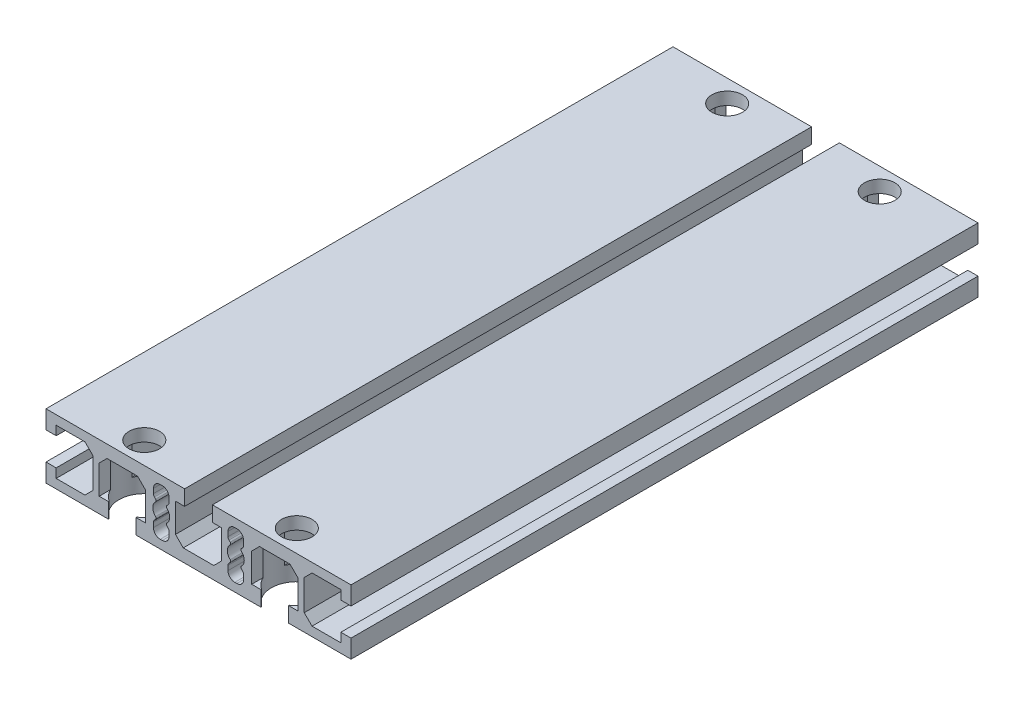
ISO-10303-21;
HEADER;
FILE_DESCRIPTION(('STEP AP214'),'2;1');
FILE_NAME('part.step','',(''),(''),'','','');
FILE_SCHEMA(('AUTOMOTIVE_DESIGN { 1 0 10303 214 1 1 1 1 }'));
ENDSEC;
DATA;
#1=APPLICATION_CONTEXT('core data for automotive mechanical design processes');
#2=APPLICATION_PROTOCOL_DEFINITION('international standard','automotive_design',2000,#1);
#3=PRODUCT_CONTEXT('',#1,'mechanical');
#4=PRODUCT('Part','Part','',(#3));
#5=PRODUCT_RELATED_PRODUCT_CATEGORY('part','',(#4));
#6=PRODUCT_DEFINITION_FORMATION('','',#4);
#7=PRODUCT_DEFINITION_CONTEXT('part definition',#1,'design');
#8=PRODUCT_DEFINITION('design','',#6,#7);
#9=PRODUCT_DEFINITION_SHAPE('','',#8);
#10=(LENGTH_UNIT() NAMED_UNIT(*) SI_UNIT(.MILLI.,.METRE.));
#11=(NAMED_UNIT(*) PLANE_ANGLE_UNIT() SI_UNIT($,.RADIAN.));
#12=(NAMED_UNIT(*) SI_UNIT($,.STERADIAN.) SOLID_ANGLE_UNIT());
#13=UNCERTAINTY_MEASURE_WITH_UNIT(LENGTH_MEASURE(1.E-05),#10,'distance_accuracy_value','');
#14=(GEOMETRIC_REPRESENTATION_CONTEXT(3) GLOBAL_UNCERTAINTY_ASSIGNED_CONTEXT((#13)) GLOBAL_UNIT_ASSIGNED_CONTEXT((#10,
#11,#12)) REPRESENTATION_CONTEXT('',''));
#15=CARTESIAN_POINT('',(0.,0.,0.));
#16=DIRECTION('',(0.,0.,1.));
#17=DIRECTION('',(1.,0.,0.));
#18=AXIS2_PLACEMENT_3D('',#15,#16,#17);
#19=CARTESIAN_POINT('',(-15.6999999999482,-5.,-92.5));
#20=DIRECTION('',(0.,1.,0.));
#21=DIRECTION('',(0.,0.,1.));
#22=AXIS2_PLACEMENT_3D('',#19,#20,#21);
#23=PLANE('',#22);
#24=CARTESIAN_POINT('',(-22.5,-5.,86.));
#25=DIRECTION('',(0.,1.,0.));
#26=DIRECTION('',(0.,0.,1.));
#27=AXIS2_PLACEMENT_3D('',#24,#25,#26);
#28=CIRCLE('',#27,7.5);
#29=CARTESIAN_POINT('',(-18.3999999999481,-5.,92.2801273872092));
#30=VERTEX_POINT('',#29);
#31=CARTESIAN_POINT('',(-15.6999999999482,-5.,89.1638584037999));
#32=VERTEX_POINT('',#31);
#33=EDGE_CURVE('E3160',#30,#32,#28,.T.);
#34=ORIENTED_EDGE('',*,*,#33,.F.);
#35=DIRECTION('',(0.,0.,1.));
#36=VECTOR('',#35,1.);
#37=CARTESIAN_POINT('',(-18.3999999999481,-5.,-92.5));
#38=LINE('',#37,#36);
#39=CARTESIAN_POINT('',(-18.3999999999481,-5.,92.5));
#40=VERTEX_POINT('',#39);
#41=EDGE_CURVE('E2042',#30,#40,#38,.T.);
#42=ORIENTED_EDGE('',*,*,#41,.T.);
#43=DIRECTION('',(-1.,0.,0.));
#44=VECTOR('',#43,1.);
#45=CARTESIAN_POINT('',(-15.6999999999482,-5.,92.5));
#46=LINE('',#45,#44);
#47=CARTESIAN_POINT('',(-15.6999999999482,-5.,92.5));
#48=VERTEX_POINT('',#47);
#49=EDGE_CURVE('E2077',#48,#40,#46,.T.);
#50=ORIENTED_EDGE('',*,*,#49,.F.);
#51=DIRECTION('',(0.,0.,1.));
#52=VECTOR('',#51,1.);
#53=CARTESIAN_POINT('',(-15.6999999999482,-5.,-92.5));
#54=LINE('',#53,#52);
#55=EDGE_CURVE('E2046',#32,#48,#54,.T.);
#56=ORIENTED_EDGE('',*,*,#55,.F.);
#57=EDGE_LOOP('',(#34,#42,#50,#56));
#58=FACE_BOUND('',#57,.T.);
#59=ADVANCED_FACE('F969',(#58),#23,.T.);
#60=CARTESIAN_POINT('',(-17.9999999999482,5.8,-92.5));
#61=DIRECTION('',(-0.707106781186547,-0.707106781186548,0.));
#62=DIRECTION('',(0.707106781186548,-0.707106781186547,0.));
#63=AXIS2_PLACEMENT_3D('',#60,#61,#62);
#64=PLANE('',#63);
#65=CARTESIAN_POINT('',(-22.5,10.3000000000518,86.));
#66=DIRECTION('',(-0.707106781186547,-0.707106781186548,0.));
#67=DIRECTION('',(0.707106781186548,-0.707106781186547,0.));
#68=AXIS2_PLACEMENT_3D('',#65,#66,#67);
#69=ELLIPSE('',#68,10.6066017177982,7.5);
#70=CARTESIAN_POINT('',(-15.6999999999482,3.5,89.1638584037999));
#71=VERTEX_POINT('',#70);
#72=CARTESIAN_POINT('',(-17.9999999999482,5.79999999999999,91.9999999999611));
#73=VERTEX_POINT('',#72);
#74=EDGE_CURVE('E1845',#71,#73,#69,.T.);
#75=ORIENTED_EDGE('',*,*,#74,.F.);
#76=DIRECTION('',(0.,0.,1.));
#77=VECTOR('',#76,1.);
#78=CARTESIAN_POINT('',(-15.6999999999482,3.5,-92.5));
#79=LINE('',#78,#77);
#80=CARTESIAN_POINT('',(-15.6999999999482,3.5,92.5));
#81=VERTEX_POINT('',#80);
#82=EDGE_CURVE('E1872',#71,#81,#79,.T.);
#83=ORIENTED_EDGE('',*,*,#82,.T.);
#84=DIRECTION('',(0.707106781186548,-0.707106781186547,0.));
#85=VECTOR('',#84,1.);
#86=CARTESIAN_POINT('',(-17.9999999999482,5.8,92.5));
#87=LINE('',#86,#85);
#88=CARTESIAN_POINT('',(-17.9999999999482,5.8,92.5));
#89=VERTEX_POINT('',#88);
#90=EDGE_CURVE('E2065',#89,#81,#87,.T.);
#91=ORIENTED_EDGE('',*,*,#90,.F.);
#92=DIRECTION('',(0.,0.,1.));
#93=VECTOR('',#92,1.);
#94=CARTESIAN_POINT('',(-17.9999999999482,5.8,-92.5));
#95=LINE('',#94,#93);
#96=EDGE_CURVE('E1870',#73,#89,#95,.T.);
#97=ORIENTED_EDGE('',*,*,#96,.F.);
#98=EDGE_LOOP('',(#75,#83,#91,#97));
#99=FACE_BOUND('',#98,.T.);
#100=ADVANCED_FACE('F2064',(#99),#64,.T.);
#101=CARTESIAN_POINT('',(-29.2999999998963,-5.00000000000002,-92.5));
#102=DIRECTION('',(1.,0.,0.));
#103=DIRECTION('',(0.,0.,-1.));
#104=AXIS2_PLACEMENT_3D('',#101,#102,#103);
#105=PLANE('',#104);
#106=DIRECTION('',(0.,-1.,0.));
#107=VECTOR('',#106,1.);
#108=CARTESIAN_POINT('',(-29.2999999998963,-9.50000000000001,89.163858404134));
#109=LINE('',#108,#107);
#110=CARTESIAN_POINT('',(-29.2999999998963,3.50000000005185,89.163858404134));
#111=VERTEX_POINT('',#110);
#112=CARTESIAN_POINT('',(-29.2999999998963,-5.00000000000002,89.163858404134));
#113=VERTEX_POINT('',#112);
#114=EDGE_CURVE('E3142',#111,#113,#109,.T.);
#115=ORIENTED_EDGE('',*,*,#114,.F.);
#116=DIRECTION('',(0.,0.,1.));
#117=VECTOR('',#116,1.);
#118=CARTESIAN_POINT('',(-29.2999999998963,3.50000000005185,-92.5));
#119=LINE('',#118,#117);
#120=CARTESIAN_POINT('',(-29.2999999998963,3.50000000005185,92.5));
#121=VERTEX_POINT('',#120);
#122=EDGE_CURVE('E1886',#111,#121,#119,.T.);
#123=ORIENTED_EDGE('',*,*,#122,.T.);
#124=DIRECTION('',(0.,1.,0.));
#125=VECTOR('',#124,1.);
#126=CARTESIAN_POINT('',(-29.2999999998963,-5.00000000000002,92.5));
#127=LINE('',#126,#125);
#128=CARTESIAN_POINT('',(-29.2999999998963,-5.00000000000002,92.5));
#129=VERTEX_POINT('',#128);
#130=EDGE_CURVE('E2973',#129,#121,#127,.T.);
#131=ORIENTED_EDGE('',*,*,#130,.F.);
#132=DIRECTION('',(0.,0.,1.));
#133=VECTOR('',#132,1.);
#134=CARTESIAN_POINT('',(-29.2999999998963,-5.00000000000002,-92.5));
#135=LINE('',#134,#133);
#136=EDGE_CURVE('E1891',#113,#129,#135,.T.);
#137=ORIENTED_EDGE('',*,*,#136,.F.);
#138=EDGE_LOOP('',(#115,#123,#131,#137));
#139=FACE_BOUND('',#138,.T.);
#140=ADVANCED_FACE('F3093',(#139),#105,.T.);
#141=CARTESIAN_POINT('',(-26.6,-5.00000000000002,-92.5));
#142=DIRECTION('',(0.,1.,0.));
#143=DIRECTION('',(-1.,0.,0.));
#144=AXIS2_PLACEMENT_3D('',#141,#142,#143);
#145=PLANE('',#144);
#146=CARTESIAN_POINT('',(-22.5,-5.00000000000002,86.));
#147=DIRECTION('',(0.,1.,0.));
#148=DIRECTION('',(-1.,0.,0.));
#149=AXIS2_PLACEMENT_3D('',#146,#147,#148);
#150=CIRCLE('',#149,7.5);
#151=CARTESIAN_POINT('',(-26.6,-5.00000000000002,92.280127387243));
#152=VERTEX_POINT('',#151);
#153=EDGE_CURVE('E3144',#113,#152,#150,.T.);
#154=ORIENTED_EDGE('',*,*,#153,.F.);
#155=ORIENTED_EDGE('',*,*,#136,.T.);
#156=DIRECTION('',(-1.,0.,0.));
#157=VECTOR('',#156,1.);
#158=CARTESIAN_POINT('',(-26.6,-5.00000000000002,92.5));
#159=LINE('',#158,#157);
#160=CARTESIAN_POINT('',(-26.6,-5.00000000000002,92.5));
#161=VERTEX_POINT('',#160);
#162=EDGE_CURVE('E2970',#161,#129,#159,.T.);
#163=ORIENTED_EDGE('',*,*,#162,.F.);
#164=DIRECTION('',(0.,0.,1.));
#165=VECTOR('',#164,1.);
#166=CARTESIAN_POINT('',(-26.6,-5.00000000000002,-92.5));
#167=LINE('',#166,#165);
#168=EDGE_CURVE('E1896',#152,#161,#167,.T.);
#169=ORIENTED_EDGE('',*,*,#168,.F.);
#170=EDGE_LOOP('',(#154,#155,#163,#169));
#171=FACE_BOUND('',#170,.T.);
#172=ADVANCED_FACE('F3194',(#171),#145,.T.);
#173=CARTESIAN_POINT('',(-26.6,-9.50000000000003,-92.5));
#174=DIRECTION('',(1.,0.,0.));
#175=DIRECTION('',(0.,0.,-1.));
#176=AXIS2_PLACEMENT_3D('',#173,#174,#175);
#177=PLANE('',#176);
#178=DIRECTION('',(0.,-1.,0.));
#179=VECTOR('',#178,1.);
#180=CARTESIAN_POINT('',(-26.6,-9.50000000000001,92.280127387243));
#181=LINE('',#180,#179);
#182=CARTESIAN_POINT('',(-26.6,-9.50000000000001,92.280127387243));
#183=VERTEX_POINT('',#182);
#184=EDGE_CURVE('E3149',#152,#183,#181,.T.);
#185=ORIENTED_EDGE('',*,*,#184,.F.);
#186=ORIENTED_EDGE('',*,*,#168,.T.);
#187=DIRECTION('',(0.,1.,0.));
#188=VECTOR('',#187,1.);
#189=CARTESIAN_POINT('',(-26.6,-9.50000000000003,92.5));
#190=LINE('',#189,#188);
#191=CARTESIAN_POINT('',(-26.6,-9.50000000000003,92.5));
#192=VERTEX_POINT('',#191);
#193=EDGE_CURVE('E2967',#192,#161,#190,.T.);
#194=ORIENTED_EDGE('',*,*,#193,.F.);
#195=DIRECTION('',(0.,0.,1.));
#196=VECTOR('',#195,1.);
#197=CARTESIAN_POINT('',(-26.6,-9.50000000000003,-92.5));
#198=LINE('',#197,#196);
#199=EDGE_CURVE('E1901',#183,#192,#198,.T.);
#200=ORIENTED_EDGE('',*,*,#199,.F.);
#201=EDGE_LOOP('',(#185,#186,#194,#200));
#202=FACE_BOUND('',#201,.T.);
#203=ADVANCED_FACE('F3117',(#202),#177,.T.);
#204=CARTESIAN_POINT('',(-18.3999999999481,-5.,-92.5));
#205=DIRECTION('',(-1.,0.,0.));
#206=DIRECTION('',(0.,0.,1.));
#207=AXIS2_PLACEMENT_3D('',#204,#205,#206);
#208=PLANE('',#207);
#209=DIRECTION('',(0.,-1.,0.));
#210=VECTOR('',#209,1.);
#211=CARTESIAN_POINT('',(-18.3999999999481,-9.50000000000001,79.7198726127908));
#212=LINE('',#211,#210);
#213=CARTESIAN_POINT('',(-18.3999999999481,-5.,79.7198726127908));
#214=VERTEX_POINT('',#213);
#215=CARTESIAN_POINT('',(-18.3999999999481,-9.50000000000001,79.7198726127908));
#216=VERTEX_POINT('',#215);
#217=EDGE_CURVE('E3165',#214,#216,#212,.T.);
#218=ORIENTED_EDGE('',*,*,#217,.F.);
#219=CARTESIAN_POINT('',(-18.3999999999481,-5.,-79.7198726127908));
#220=VERTEX_POINT('',#219);
#221=EDGE_CURVE('E2041',#220,#214,#38,.T.);
#222=ORIENTED_EDGE('',*,*,#221,.F.);
#223=DIRECTION('',(0.,-1.,0.));
#224=VECTOR('',#223,1.);
#225=CARTESIAN_POINT('',(-18.3999999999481,-9.50000000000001,-79.7198726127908));
#226=LINE('',#225,#224);
#227=CARTESIAN_POINT('',(-18.3999999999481,-9.50000000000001,-79.7198726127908));
#228=VERTEX_POINT('',#227);
#229=EDGE_CURVE('E2694',#228,#220,#226,.F.);
#230=ORIENTED_EDGE('',*,*,#229,.F.);
#231=DIRECTION('',(0.,0.,1.));
#232=VECTOR('',#231,1.);
#233=CARTESIAN_POINT('',(-18.3999999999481,-9.50000000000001,-92.5));
#234=LINE('',#233,#232);
#235=EDGE_CURVE('E2037',#228,#216,#234,.T.);
#236=ORIENTED_EDGE('',*,*,#235,.T.);
#237=EDGE_LOOP('',(#218,#222,#230,#236));
#238=FACE_BOUND('',#237,.T.);
#239=ADVANCED_FACE('F3110',(#238),#208,.T.);
#240=CARTESIAN_POINT('',(-15.6999999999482,3.5,-92.5));
#241=DIRECTION('',(-1.,0.,0.));
#242=DIRECTION('',(0.,0.,1.));
#243=AXIS2_PLACEMENT_3D('',#240,#241,#242);
#244=PLANE('',#243);
#245=DIRECTION('',(0.,-1.,0.));
#246=VECTOR('',#245,1.);
#247=CARTESIAN_POINT('',(-15.6999999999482,-9.50000000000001,82.8361415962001));
#248=LINE('',#247,#246);
#249=CARTESIAN_POINT('',(-15.6999999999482,3.5,82.8361415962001));
#250=VERTEX_POINT('',#249);
#251=CARTESIAN_POINT('',(-15.6999999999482,-5.,82.8361415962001));
#252=VERTEX_POINT('',#251);
#253=EDGE_CURVE('E1862',#250,#252,#248,.T.);
#254=ORIENTED_EDGE('',*,*,#253,.F.);
#255=CARTESIAN_POINT('',(-15.6999999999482,3.5,-82.8361415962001));
#256=VERTEX_POINT('',#255);
#257=EDGE_CURVE('E1860',#256,#250,#79,.T.);
#258=ORIENTED_EDGE('',*,*,#257,.F.);
#259=DIRECTION('',(0.,-1.,0.));
#260=VECTOR('',#259,1.);
#261=CARTESIAN_POINT('',(-15.6999999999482,-9.50000000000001,-82.8361415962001));
#262=LINE('',#261,#260);
#263=CARTESIAN_POINT('',(-15.6999999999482,-5.,-82.8361415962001));
#264=VERTEX_POINT('',#263);
#265=EDGE_CURVE('E2695',#264,#256,#262,.F.);
#266=ORIENTED_EDGE('',*,*,#265,.F.);
#267=EDGE_CURVE('E2045',#264,#252,#54,.T.);
#268=ORIENTED_EDGE('',*,*,#267,.T.);
#269=EDGE_LOOP('',(#254,#258,#266,#268));
#270=FACE_BOUND('',#269,.T.);
#271=ADVANCED_FACE('F3108',(#270),#244,.T.);
#272=CARTESIAN_POINT('',(-29.2999999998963,3.50000000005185,-92.5));
#273=DIRECTION('',(0.707106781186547,-0.707106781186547,0.));
#274=DIRECTION('',(0.707106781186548,0.707106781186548,0.));
#275=AXIS2_PLACEMENT_3D('',#272,#273,#274);
#276=PLANE('',#275);
#277=CARTESIAN_POINT('',(-22.5,10.2999999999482,86.));
#278=DIRECTION('',(0.707106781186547,-0.707106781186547,0.));
#279=DIRECTION('',(-0.707106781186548,-0.707106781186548,0.));
#280=AXIS2_PLACEMENT_3D('',#277,#278,#279);
#281=ELLIPSE('',#280,10.6066017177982,7.5);
#282=CARTESIAN_POINT('',(-29.2999999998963,3.50000000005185,82.8361415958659));
#283=VERTEX_POINT('',#282);
#284=CARTESIAN_POINT('',(-26.9999999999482,5.79999999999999,79.9999999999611));
#285=VERTEX_POINT('',#284);
#286=EDGE_CURVE('E2991',#283,#285,#281,.T.);
#287=ORIENTED_EDGE('',*,*,#286,.F.);
#288=CARTESIAN_POINT('',(-29.2999999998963,3.50000000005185,-82.836141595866));
#289=VERTEX_POINT('',#288);
#290=EDGE_CURVE('E1885',#289,#283,#119,.T.);
#291=ORIENTED_EDGE('',*,*,#290,.F.);
#292=CARTESIAN_POINT('',(-22.5,10.2999999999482,-86.));
#293=DIRECTION('',(0.707106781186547,-0.707106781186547,0.));
#294=DIRECTION('',(-0.707106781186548,-0.707106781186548,0.));
#295=AXIS2_PLACEMENT_3D('',#292,#293,#294);
#296=ELLIPSE('',#295,10.6066017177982,7.5);
#297=CARTESIAN_POINT('',(-26.9999999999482,5.79999999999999,-79.9999999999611));
#298=VERTEX_POINT('',#297);
#299=EDGE_CURVE('E2993',#298,#289,#296,.T.);
#300=ORIENTED_EDGE('',*,*,#299,.F.);
#301=DIRECTION('',(0.,0.,1.));
#302=VECTOR('',#301,1.);
#303=CARTESIAN_POINT('',(-26.9999999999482,5.8,-92.5));
#304=LINE('',#303,#302);
#305=EDGE_CURVE('E1880',#298,#285,#304,.T.);
#306=ORIENTED_EDGE('',*,*,#305,.T.);
#307=EDGE_LOOP('',(#287,#291,#300,#306));
#308=FACE_BOUND('',#307,.T.);
#309=ADVANCED_FACE('F2989',(#308),#276,.T.);
#310=DIRECTION('',(0.,-1.,0.));
#311=VECTOR('',#310,1.);
#312=CARTESIAN_POINT('',(-18.3999999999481,-9.50000000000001,-92.2801273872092));
#313=LINE('',#312,#311);
#314=CARTESIAN_POINT('',(-18.3999999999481,-5.,-92.2801273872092));
#315=VERTEX_POINT('',#314);
#316=CARTESIAN_POINT('',(-18.3999999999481,-9.50000000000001,-92.2801273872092));
#317=VERTEX_POINT('',#316);
#318=EDGE_CURVE('E2679',#315,#317,#313,.T.);
#319=ORIENTED_EDGE('',*,*,#318,.F.);
#320=CARTESIAN_POINT('',(-18.3999999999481,-5.,-92.5));
#321=VERTEX_POINT('',#320);
#322=EDGE_CURVE('E2039',#321,#315,#38,.T.);
#323=ORIENTED_EDGE('',*,*,#322,.F.);
#324=DIRECTION('',(0.,-1.,0.));
#325=VECTOR('',#324,1.);
#326=CARTESIAN_POINT('',(-18.3999999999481,-5.,-92.5));
#327=LINE('',#326,#325);
#328=CARTESIAN_POINT('',(-18.3999999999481,-9.50000000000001,-92.5));
#329=VERTEX_POINT('',#328);
#330=EDGE_CURVE('E2453',#321,#329,#327,.T.);
#331=ORIENTED_EDGE('',*,*,#330,.T.);
#332=EDGE_CURVE('E2034',#329,#317,#234,.T.);
#333=ORIENTED_EDGE('',*,*,#332,.T.);
#334=EDGE_LOOP('',(#319,#323,#331,#333));
#335=FACE_BOUND('',#334,.T.);
#336=ADVANCED_FACE('F2678',(#335),#208,.T.);
#337=EDGE_CURVE('E1861',#252,#214,#28,.T.);
#338=ORIENTED_EDGE('',*,*,#337,.F.);
#339=ORIENTED_EDGE('',*,*,#267,.F.);
#340=CARTESIAN_POINT('',(-22.5,-5.,-86.));
#341=DIRECTION('',(0.,1.,0.));
#342=DIRECTION('',(0.,0.,1.));
#343=AXIS2_PLACEMENT_3D('',#340,#341,#342);
#344=CIRCLE('',#343,7.5);
#345=EDGE_CURVE('E2689',#220,#264,#344,.T.);
#346=ORIENTED_EDGE('',*,*,#345,.F.);
#347=ORIENTED_EDGE('',*,*,#221,.T.);
#348=EDGE_LOOP('',(#338,#339,#346,#347));
#349=FACE_BOUND('',#348,.T.);
#350=ADVANCED_FACE('F3089',(#349),#23,.T.);
#351=DIRECTION('',(0.,-1.,0.));
#352=VECTOR('',#351,1.);
#353=CARTESIAN_POINT('',(-15.6999999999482,-9.50000000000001,-89.1638584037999));
#354=LINE('',#353,#352);
#355=CARTESIAN_POINT('',(-15.6999999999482,3.5,-89.1638584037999));
#356=VERTEX_POINT('',#355);
#357=CARTESIAN_POINT('',(-15.6999999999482,-5.,-89.1638584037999));
#358=VERTEX_POINT('',#357);
#359=EDGE_CURVE('E2687',#356,#358,#354,.T.);
#360=ORIENTED_EDGE('',*,*,#359,.F.);
#361=CARTESIAN_POINT('',(-15.6999999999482,3.5,-92.5));
#362=VERTEX_POINT('',#361);
#363=EDGE_CURVE('E1876',#362,#356,#79,.T.);
#364=ORIENTED_EDGE('',*,*,#363,.F.);
#365=DIRECTION('',(0.,-1.,0.));
#366=VECTOR('',#365,1.);
#367=CARTESIAN_POINT('',(-15.6999999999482,3.5,-92.5));
#368=LINE('',#367,#366);
#369=CARTESIAN_POINT('',(-15.6999999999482,-5.,-92.5));
#370=VERTEX_POINT('',#369);
#371=EDGE_CURVE('E2448',#362,#370,#368,.T.);
#372=ORIENTED_EDGE('',*,*,#371,.T.);
#373=EDGE_CURVE('E2043',#370,#358,#54,.T.);
#374=ORIENTED_EDGE('',*,*,#373,.T.);
#375=EDGE_LOOP('',(#360,#364,#372,#374));
#376=FACE_BOUND('',#375,.T.);
#377=ADVANCED_FACE('F3100',(#376),#244,.T.);
#378=CARTESIAN_POINT('',(-17.9999999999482,5.79999999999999,80.0000000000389));
#379=VERTEX_POINT('',#378);
#380=EDGE_CURVE('E1842',#379,#250,#69,.T.);
#381=ORIENTED_EDGE('',*,*,#380,.F.);
#382=CARTESIAN_POINT('',(-17.9999999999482,5.79999999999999,-80.0000000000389));
#383=VERTEX_POINT('',#382);
#384=EDGE_CURVE('E1858',#383,#379,#95,.T.);
#385=ORIENTED_EDGE('',*,*,#384,.F.);
#386=CARTESIAN_POINT('',(-22.5,10.3000000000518,-86.));
#387=DIRECTION('',(-0.707106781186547,-0.707106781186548,0.));
#388=DIRECTION('',(0.707106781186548,-0.707106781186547,0.));
#389=AXIS2_PLACEMENT_3D('',#386,#387,#388);
#390=ELLIPSE('',#389,10.6066017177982,7.5);
#391=EDGE_CURVE('E2690',#256,#383,#390,.T.);
#392=ORIENTED_EDGE('',*,*,#391,.F.);
#393=ORIENTED_EDGE('',*,*,#257,.T.);
#394=EDGE_LOOP('',(#381,#385,#392,#393));
#395=FACE_BOUND('',#394,.T.);
#396=ADVANCED_FACE('F1856',(#395),#64,.T.);
#397=CARTESIAN_POINT('',(-29.2999999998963,3.50000000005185,-89.163858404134));
#398=VERTEX_POINT('',#397);
#399=CARTESIAN_POINT('',(-26.9999999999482,5.79999999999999,-92.0000000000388));
#400=VERTEX_POINT('',#399);
#401=EDGE_CURVE('E3001',#398,#400,#296,.T.);
#402=ORIENTED_EDGE('',*,*,#401,.F.);
#403=CARTESIAN_POINT('',(-29.2999999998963,3.50000000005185,-92.5));
#404=VERTEX_POINT('',#403);
#405=EDGE_CURVE('E1882',#404,#398,#119,.T.);
#406=ORIENTED_EDGE('',*,*,#405,.F.);
#407=DIRECTION('',(0.707106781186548,0.707106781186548,0.));
#408=VECTOR('',#407,1.);
#409=CARTESIAN_POINT('',(-29.2999999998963,3.50000000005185,-92.5));
#410=LINE('',#409,#408);
#411=CARTESIAN_POINT('',(-26.9999999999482,5.8,-92.5));
#412=VERTEX_POINT('',#411);
#413=EDGE_CURVE('E2441',#404,#412,#410,.T.);
#414=ORIENTED_EDGE('',*,*,#413,.T.);
#415=EDGE_CURVE('E1873',#412,#400,#304,.T.);
#416=ORIENTED_EDGE('',*,*,#415,.T.);
#417=EDGE_LOOP('',(#402,#406,#414,#416));
#418=FACE_BOUND('',#417,.T.);
#419=ADVANCED_FACE('F3000',(#418),#276,.T.);
#420=DIRECTION('',(0.,-1.,0.));
#421=VECTOR('',#420,1.);
#422=CARTESIAN_POINT('',(-29.2999999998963,-9.50000000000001,82.836141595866));
#423=LINE('',#422,#421);
#424=CARTESIAN_POINT('',(-29.2999999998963,-5.00000000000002,82.836141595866));
#425=VERTEX_POINT('',#424);
#426=EDGE_CURVE('E3148',#425,#283,#423,.F.);
#427=ORIENTED_EDGE('',*,*,#426,.F.);
#428=CARTESIAN_POINT('',(-29.2999999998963,-5.00000000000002,-82.836141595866));
#429=VERTEX_POINT('',#428);
#430=EDGE_CURVE('E1890',#429,#425,#135,.T.);
#431=ORIENTED_EDGE('',*,*,#430,.F.);
#432=DIRECTION('',(0.,-1.,0.));
#433=VECTOR('',#432,1.);
#434=CARTESIAN_POINT('',(-29.2999999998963,-9.50000000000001,-82.836141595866));
#435=LINE('',#434,#433);
#436=EDGE_CURVE('E3180',#289,#429,#435,.T.);
#437=ORIENTED_EDGE('',*,*,#436,.F.);
#438=ORIENTED_EDGE('',*,*,#290,.T.);
#439=EDGE_LOOP('',(#427,#431,#437,#438));
#440=FACE_BOUND('',#439,.T.);
#441=ADVANCED_FACE('F3132',(#440),#105,.T.);
#442=CARTESIAN_POINT('',(-26.6,-5.00000000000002,79.719872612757));
#443=VERTEX_POINT('',#442);
#444=EDGE_CURVE('E3150',#443,#425,#150,.T.);
#445=ORIENTED_EDGE('',*,*,#444,.F.);
#446=CARTESIAN_POINT('',(-26.6,-5.00000000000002,-79.719872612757));
#447=VERTEX_POINT('',#446);
#448=EDGE_CURVE('E1895',#447,#443,#167,.T.);
#449=ORIENTED_EDGE('',*,*,#448,.F.);
#450=CARTESIAN_POINT('',(-22.5,-5.00000000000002,-86.));
#451=DIRECTION('',(0.,1.,0.));
#452=DIRECTION('',(-1.,0.,0.));
#453=AXIS2_PLACEMENT_3D('',#450,#451,#452);
#454=CIRCLE('',#453,7.5);
#455=EDGE_CURVE('E3176',#429,#447,#454,.T.);
#456=ORIENTED_EDGE('',*,*,#455,.F.);
#457=ORIENTED_EDGE('',*,*,#430,.T.);
#458=EDGE_LOOP('',(#445,#449,#456,#457));
#459=FACE_BOUND('',#458,.T.);
#460=ADVANCED_FACE('F3205',(#459),#145,.T.);
#461=DIRECTION('',(0.,-1.,0.));
#462=VECTOR('',#461,1.);
#463=CARTESIAN_POINT('',(-26.6,-9.50000000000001,79.719872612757));
#464=LINE('',#463,#462);
#465=CARTESIAN_POINT('',(-26.6,-9.50000000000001,79.719872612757));
#466=VERTEX_POINT('',#465);
#467=EDGE_CURVE('E3156',#466,#443,#464,.F.);
#468=ORIENTED_EDGE('',*,*,#467,.F.);
#469=CARTESIAN_POINT('',(-26.6,-9.50000000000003,-79.719872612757));
#470=VERTEX_POINT('',#469);
#471=EDGE_CURVE('E1900',#470,#466,#198,.T.);
#472=ORIENTED_EDGE('',*,*,#471,.F.);
#473=DIRECTION('',(0.,-1.,0.));
#474=VECTOR('',#473,1.);
#475=CARTESIAN_POINT('',(-26.6,-9.50000000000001,-79.719872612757));
#476=LINE('',#475,#474);
#477=EDGE_CURVE('E985',#447,#470,#476,.T.);
#478=ORIENTED_EDGE('',*,*,#477,.F.);
#479=ORIENTED_EDGE('',*,*,#448,.T.);
#480=EDGE_LOOP('',(#468,#472,#478,#479));
#481=FACE_BOUND('',#480,.T.);
#482=ADVANCED_FACE('F3202',(#481),#177,.T.);
#483=CARTESIAN_POINT('',(26.6000000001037,-4.99999999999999,-92.5));
#484=DIRECTION('',(-1.,0.,0.));
#485=DIRECTION('',(0.,0.,1.));
#486=AXIS2_PLACEMENT_3D('',#483,#484,#485);
#487=PLANE('',#486);
#488=DIRECTION('',(0.,-1.,0.));
#489=VECTOR('',#488,1.);
#490=CARTESIAN_POINT('',(26.6000000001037,-9.50000000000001,-92.280127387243));
#491=LINE('',#490,#489);
#492=CARTESIAN_POINT('',(26.6000000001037,-4.99999999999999,-92.280127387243));
#493=VERTEX_POINT('',#492);
#494=CARTESIAN_POINT('',(26.6000000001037,-9.50000000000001,-92.280127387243));
#495=VERTEX_POINT('',#494);
#496=EDGE_CURVE('E2629',#493,#495,#491,.T.);
#497=ORIENTED_EDGE('',*,*,#496,.F.);
#498=DIRECTION('',(0.,0.,1.));
#499=VECTOR('',#498,1.);
#500=CARTESIAN_POINT('',(26.6000000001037,-4.99999999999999,-92.5));
#501=LINE('',#500,#499);
#502=CARTESIAN_POINT('',(26.6000000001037,-4.99999999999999,-92.5));
#503=VERTEX_POINT('',#502);
#504=EDGE_CURVE('E1989',#503,#493,#501,.T.);
#505=ORIENTED_EDGE('',*,*,#504,.F.);
#506=DIRECTION('',(0.,-1.,0.));
#507=VECTOR('',#506,1.);
#508=CARTESIAN_POINT('',(26.6000000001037,-4.99999999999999,-92.5));
#509=LINE('',#508,#507);
#510=CARTESIAN_POINT('',(26.6000000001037,-9.49999999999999,-92.5));
#511=VERTEX_POINT('',#510);
#512=EDGE_CURVE('E2482',#503,#511,#509,.T.);
#513=ORIENTED_EDGE('',*,*,#512,.T.);
#514=DIRECTION('',(0.,0.,1.));
#515=VECTOR('',#514,1.);
#516=CARTESIAN_POINT('',(26.6000000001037,-9.49999999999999,-92.5));
#517=LINE('',#516,#515);
#518=EDGE_CURVE('E1984',#511,#495,#517,.T.);
#519=ORIENTED_EDGE('',*,*,#518,.T.);
#520=EDGE_LOOP('',(#497,#505,#513,#519));
#521=FACE_BOUND('',#520,.T.);
#522=ADVANCED_FACE('F2628',(#521),#487,.T.);
#523=CARTESIAN_POINT('',(29.3000000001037,3.50000000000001,-92.5));
#524=DIRECTION('',(-1.,0.,0.));
#525=DIRECTION('',(0.,0.,1.));
#526=AXIS2_PLACEMENT_3D('',#523,#524,#525);
#527=PLANE('',#526);
#528=DIRECTION('',(0.,-1.,0.));
#529=VECTOR('',#528,1.);
#530=CARTESIAN_POINT('',(29.3000000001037,-9.50000000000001,-89.1638584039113));
#531=LINE('',#530,#529);
#532=CARTESIAN_POINT('',(29.3000000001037,3.50000000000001,-89.1638584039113));
#533=VERTEX_POINT('',#532);
#534=CARTESIAN_POINT('',(29.3000000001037,-4.99999999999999,-89.1638584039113));
#535=VERTEX_POINT('',#534);
#536=EDGE_CURVE('E2639',#533,#535,#531,.T.);
#537=ORIENTED_EDGE('',*,*,#536,.F.);
#538=DIRECTION('',(0.,0.,1.));
#539=VECTOR('',#538,1.);
#540=CARTESIAN_POINT('',(29.3000000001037,3.50000000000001,-92.5));
#541=LINE('',#540,#539);
#542=CARTESIAN_POINT('',(29.3000000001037,3.50000000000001,-92.5));
#543=VERTEX_POINT('',#542);
#544=EDGE_CURVE('E1999',#543,#533,#541,.T.);
#545=ORIENTED_EDGE('',*,*,#544,.F.);
#546=DIRECTION('',(0.,-1.,0.));
#547=VECTOR('',#546,1.);
#548=CARTESIAN_POINT('',(29.3000000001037,3.50000000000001,-92.5));
#549=LINE('',#548,#547);
#550=CARTESIAN_POINT('',(29.3000000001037,-4.99999999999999,-92.5));
#551=VERTEX_POINT('',#550);
#552=EDGE_CURVE('E2476',#543,#551,#549,.T.);
#553=ORIENTED_EDGE('',*,*,#552,.T.);
#554=DIRECTION('',(0.,0.,1.));
#555=VECTOR('',#554,1.);
#556=CARTESIAN_POINT('',(29.3000000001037,-4.99999999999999,-92.5));
#557=LINE('',#556,#555);
#558=EDGE_CURVE('E1994',#551,#535,#557,.T.);
#559=ORIENTED_EDGE('',*,*,#558,.T.);
#560=EDGE_LOOP('',(#537,#545,#553,#559));
#561=FACE_BOUND('',#560,.T.);
#562=ADVANCED_FACE('F2638',(#561),#527,.T.);
#563=CARTESIAN_POINT('',(15.7000000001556,3.50000000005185,-92.5));
#564=DIRECTION('',(0.707106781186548,-0.707106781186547,0.));
#565=DIRECTION('',(0.707106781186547,0.707106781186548,0.));
#566=AXIS2_PLACEMENT_3D('',#563,#564,#565);
#567=PLANE('',#566);
#568=CARTESIAN_POINT('',(22.5000000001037,10.3,-86.));
#569=DIRECTION('',(0.707106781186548,-0.707106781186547,0.));
#570=DIRECTION('',(-0.707106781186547,-0.707106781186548,0.));
#571=AXIS2_PLACEMENT_3D('',#568,#569,#570);
#572=ELLIPSE('',#571,10.6066017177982,7.49999999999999);
#573=CARTESIAN_POINT('',(15.7000000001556,3.50000000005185,-89.1638584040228));
#574=VERTEX_POINT('',#573);
#575=CARTESIAN_POINT('',(18.0000000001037,5.79999999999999,-92.));
#576=VERTEX_POINT('',#575);
#577=EDGE_CURVE('E2652',#574,#576,#572,.T.);
#578=ORIENTED_EDGE('',*,*,#577,.F.);
#579=DIRECTION('',(0.,0.,1.));
#580=VECTOR('',#579,1.);
#581=CARTESIAN_POINT('',(15.7000000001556,3.50000000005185,-92.5));
#582=LINE('',#581,#580);
#583=CARTESIAN_POINT('',(15.7000000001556,3.50000000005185,-92.5));
#584=VERTEX_POINT('',#583);
#585=EDGE_CURVE('E2014',#584,#574,#582,.T.);
#586=ORIENTED_EDGE('',*,*,#585,.F.);
#587=DIRECTION('',(0.707106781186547,0.707106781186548,0.));
#588=VECTOR('',#587,1.);
#589=CARTESIAN_POINT('',(15.7000000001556,3.50000000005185,-92.5));
#590=LINE('',#589,#588);
#591=CARTESIAN_POINT('',(18.0000000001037,5.79999999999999,-92.5));
#592=VERTEX_POINT('',#591);
#593=EDGE_CURVE('E2468',#584,#592,#590,.T.);
#594=ORIENTED_EDGE('',*,*,#593,.T.);
#595=DIRECTION('',(0.,0.,1.));
#596=VECTOR('',#595,1.);
#597=CARTESIAN_POINT('',(18.0000000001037,5.79999999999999,-92.5));
#598=LINE('',#597,#596);
#599=EDGE_CURVE('E2009',#592,#576,#598,.T.);
#600=ORIENTED_EDGE('',*,*,#599,.T.);
#601=EDGE_LOOP('',(#578,#586,#594,#600));
#602=FACE_BOUND('',#601,.T.);
#603=ADVANCED_FACE('F2651',(#602),#567,.T.);
#604=CARTESIAN_POINT('',(18.4000000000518,-5.,-92.5));
#605=DIRECTION('',(0.,1.,0.));
#606=DIRECTION('',(0.,0.,1.));
#607=AXIS2_PLACEMENT_3D('',#604,#605,#606);
#608=PLANE('',#607);
#609=CARTESIAN_POINT('',(22.5000000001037,-5.,-86.));
#610=DIRECTION('',(0.,1.,0.));
#611=DIRECTION('',(0.,0.,1.));
#612=AXIS2_PLACEMENT_3D('',#609,#610,#611);
#613=CIRCLE('',#612,7.49999999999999);
#614=CARTESIAN_POINT('',(18.4000000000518,-5.,-92.2801273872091));
#615=VERTEX_POINT('',#614);
#616=CARTESIAN_POINT('',(15.7000000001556,-5.,-89.1638584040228));
#617=VERTEX_POINT('',#616);
#618=EDGE_CURVE('E2662',#615,#617,#613,.T.);
#619=ORIENTED_EDGE('',*,*,#618,.F.);
#620=DIRECTION('',(0.,0.,1.));
#621=VECTOR('',#620,1.);
#622=CARTESIAN_POINT('',(18.4000000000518,-5.,-92.5));
#623=LINE('',#622,#621);
#624=CARTESIAN_POINT('',(18.4000000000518,-5.,-92.5));
#625=VERTEX_POINT('',#624);
#626=EDGE_CURVE('E2024',#625,#615,#623,.T.);
#627=ORIENTED_EDGE('',*,*,#626,.F.);
#628=DIRECTION('',(-1.,0.,0.));
#629=VECTOR('',#628,1.);
#630=CARTESIAN_POINT('',(18.4000000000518,-5.,-92.5));
#631=LINE('',#630,#629);
#632=CARTESIAN_POINT('',(15.7000000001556,-5.,-92.5));
#633=VERTEX_POINT('',#632);
#634=EDGE_CURVE('E2462',#625,#633,#631,.T.);
#635=ORIENTED_EDGE('',*,*,#634,.T.);
#636=DIRECTION('',(0.,0.,1.));
#637=VECTOR('',#636,1.);
#638=CARTESIAN_POINT('',(15.7000000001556,-5.,-92.5));
#639=LINE('',#638,#637);
#640=EDGE_CURVE('E2019',#633,#617,#639,.T.);
#641=ORIENTED_EDGE('',*,*,#640,.T.);
#642=EDGE_LOOP('',(#619,#627,#635,#641));
#643=FACE_BOUND('',#642,.T.);
#644=ADVANCED_FACE('F2661',(#643),#608,.T.);
#645=CARTESIAN_POINT('',(29.3000000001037,-4.99999999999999,-92.5));
#646=DIRECTION('',(0.,1.,0.));
#647=DIRECTION('',(0.,0.,1.));
#648=AXIS2_PLACEMENT_3D('',#645,#646,#647);
#649=PLANE('',#648);
#650=CARTESIAN_POINT('',(22.5000000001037,-4.99999999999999,-86.));
#651=DIRECTION('',(0.,1.,0.));
#652=DIRECTION('',(0.,0.,1.));
#653=AXIS2_PLACEMENT_3D('',#650,#651,#652);
#654=CIRCLE('',#653,7.49999999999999);
#655=CARTESIAN_POINT('',(26.6000000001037,-4.99999999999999,-79.719872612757));
#656=VERTEX_POINT('',#655);
#657=CARTESIAN_POINT('',(29.3000000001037,-4.99999999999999,-82.8361415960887));
#658=VERTEX_POINT('',#657);
#659=EDGE_CURVE('E2728',#656,#658,#654,.T.);
#660=ORIENTED_EDGE('',*,*,#659,.F.);
#661=CARTESIAN_POINT('',(26.6000000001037,-4.99999999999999,79.719872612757));
#662=VERTEX_POINT('',#661);
#663=EDGE_CURVE('E1992',#656,#662,#501,.T.);
#664=ORIENTED_EDGE('',*,*,#663,.T.);
#665=CARTESIAN_POINT('',(22.5000000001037,-4.99999999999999,86.));
#666=DIRECTION('',(0.,1.,0.));
#667=DIRECTION('',(0.,0.,1.));
#668=AXIS2_PLACEMENT_3D('',#665,#666,#667);
#669=CIRCLE('',#668,7.49999999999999);
#670=CARTESIAN_POINT('',(29.3000000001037,-4.99999999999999,82.8361415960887));
#671=VERTEX_POINT('',#670);
#672=EDGE_CURVE('E2771',#671,#662,#669,.T.);
#673=ORIENTED_EDGE('',*,*,#672,.F.);
#674=EDGE_CURVE('E1997',#658,#671,#557,.T.);
#675=ORIENTED_EDGE('',*,*,#674,.F.);
#676=EDGE_LOOP('',(#660,#664,#673,#675));
#677=FACE_BOUND('',#676,.T.);
#678=ADVANCED_FACE('F3606',(#677),#649,.T.);
#679=CARTESIAN_POINT('',(27.0000000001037,5.79999999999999,-92.5));
#680=DIRECTION('',(-0.707106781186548,-0.707106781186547,0.));
#681=DIRECTION('',(0.707106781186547,-0.707106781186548,0.));
#682=AXIS2_PLACEMENT_3D('',#679,#680,#681);
#683=PLANE('',#682);
#684=CARTESIAN_POINT('',(22.5000000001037,10.3,-86.));
#685=DIRECTION('',(-0.707106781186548,-0.707106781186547,0.));
#686=DIRECTION('',(0.707106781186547,-0.707106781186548,0.));
#687=AXIS2_PLACEMENT_3D('',#684,#685,#686);
#688=ELLIPSE('',#687,10.6066017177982,7.49999999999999);
#689=CARTESIAN_POINT('',(29.3000000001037,3.50000000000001,-82.8361415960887));
#690=VERTEX_POINT('',#689);
#691=CARTESIAN_POINT('',(27.0000000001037,5.79999999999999,-80.));
#692=VERTEX_POINT('',#691);
#693=EDGE_CURVE('E2725',#690,#692,#688,.T.);
#694=ORIENTED_EDGE('',*,*,#693,.F.);
#695=CARTESIAN_POINT('',(29.3000000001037,3.50000000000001,82.8361415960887));
#696=VERTEX_POINT('',#695);
#697=EDGE_CURVE('E2002',#690,#696,#541,.T.);
#698=ORIENTED_EDGE('',*,*,#697,.T.);
#699=CARTESIAN_POINT('',(22.5000000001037,10.3,86.));
#700=DIRECTION('',(-0.707106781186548,-0.707106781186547,0.));
#701=DIRECTION('',(0.707106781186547,-0.707106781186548,0.));
#702=AXIS2_PLACEMENT_3D('',#699,#700,#701);
#703=ELLIPSE('',#702,10.6066017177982,7.49999999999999);
#704=CARTESIAN_POINT('',(27.0000000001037,5.79999999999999,80.));
#705=VERTEX_POINT('',#704);
#706=EDGE_CURVE('E2764',#705,#696,#703,.T.);
#707=ORIENTED_EDGE('',*,*,#706,.F.);
#708=DIRECTION('',(0.,0.,1.));
#709=VECTOR('',#708,1.);
#710=CARTESIAN_POINT('',(27.0000000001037,5.79999999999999,-92.5));
#711=LINE('',#710,#709);
#712=EDGE_CURVE('E2007',#692,#705,#711,.T.);
#713=ORIENTED_EDGE('',*,*,#712,.F.);
#714=EDGE_LOOP('',(#694,#698,#707,#713));
#715=FACE_BOUND('',#714,.T.);
#716=ADVANCED_FACE('F3542',(#715),#683,.T.);
#717=CARTESIAN_POINT('',(15.7000000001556,-5.,-92.5));
#718=DIRECTION('',(1.,0.,0.));
#719=DIRECTION('',(0.,0.,-1.));
#720=AXIS2_PLACEMENT_3D('',#717,#718,#719);
#721=PLANE('',#720);
#722=DIRECTION('',(0.,-1.,0.));
#723=VECTOR('',#722,1.);
#724=CARTESIAN_POINT('',(15.7000000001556,-9.50000000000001,-82.8361415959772));
#725=LINE('',#724,#723);
#726=CARTESIAN_POINT('',(15.7000000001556,3.50000000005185,-82.8361415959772));
#727=VERTEX_POINT('',#726);
#728=CARTESIAN_POINT('',(15.7000000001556,-5.,-82.8361415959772));
#729=VERTEX_POINT('',#728);
#730=EDGE_CURVE('E2722',#727,#729,#725,.T.);
#731=ORIENTED_EDGE('',*,*,#730,.F.);
#732=CARTESIAN_POINT('',(15.7000000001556,3.50000000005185,82.8361415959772));
#733=VERTEX_POINT('',#732);
#734=EDGE_CURVE('E2017',#727,#733,#582,.T.);
#735=ORIENTED_EDGE('',*,*,#734,.T.);
#736=DIRECTION('',(0.,-1.,0.));
#737=VECTOR('',#736,1.);
#738=CARTESIAN_POINT('',(15.7000000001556,-9.50000000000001,82.8361415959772));
#739=LINE('',#738,#737);
#740=CARTESIAN_POINT('',(15.7000000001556,-5.,82.8361415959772));
#741=VERTEX_POINT('',#740);
#742=EDGE_CURVE('E2753',#741,#733,#739,.F.);
#743=ORIENTED_EDGE('',*,*,#742,.F.);
#744=EDGE_CURVE('E2022',#729,#741,#639,.T.);
#745=ORIENTED_EDGE('',*,*,#744,.F.);
#746=EDGE_LOOP('',(#731,#735,#743,#745));
#747=FACE_BOUND('',#746,.T.);
#748=ADVANCED_FACE('F3532',(#747),#721,.T.);
#749=CARTESIAN_POINT('',(18.4000000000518,-9.50000000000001,-92.5));
#750=DIRECTION('',(1.,0.,0.));
#751=DIRECTION('',(0.,0.,-1.));
#752=AXIS2_PLACEMENT_3D('',#749,#750,#751);
#753=PLANE('',#752);
#754=DIRECTION('',(0.,-1.,0.));
#755=VECTOR('',#754,1.);
#756=CARTESIAN_POINT('',(18.4000000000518,-9.50000000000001,-79.7198726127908));
#757=LINE('',#756,#755);
#758=CARTESIAN_POINT('',(18.4000000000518,-5.,-79.7198726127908));
#759=VERTEX_POINT('',#758);
#760=CARTESIAN_POINT('',(18.4000000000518,-9.50000000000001,-79.7198726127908));
#761=VERTEX_POINT('',#760);
#762=EDGE_CURVE('E2719',#759,#761,#757,.T.);
#763=ORIENTED_EDGE('',*,*,#762,.F.);
#764=CARTESIAN_POINT('',(18.4000000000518,-5.,79.7198726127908));
#765=VERTEX_POINT('',#764);
#766=EDGE_CURVE('E2027',#759,#765,#623,.T.);
#767=ORIENTED_EDGE('',*,*,#766,.T.);
#768=DIRECTION('',(0.,-1.,0.));
#769=VECTOR('',#768,1.);
#770=CARTESIAN_POINT('',(18.4000000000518,-9.50000000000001,79.7198726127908));
#771=LINE('',#770,#769);
#772=CARTESIAN_POINT('',(18.4000000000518,-9.50000000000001,79.7198726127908));
#773=VERTEX_POINT('',#772);
#774=EDGE_CURVE('E2747',#773,#765,#771,.F.);
#775=ORIENTED_EDGE('',*,*,#774,.F.);
#776=DIRECTION('',(0.,0.,1.));
#777=VECTOR('',#776,1.);
#778=CARTESIAN_POINT('',(18.4000000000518,-9.50000000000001,-92.5));
#779=LINE('',#778,#777);
#780=EDGE_CURVE('E2032',#761,#773,#779,.T.);
#781=ORIENTED_EDGE('',*,*,#780,.F.);
#782=EDGE_LOOP('',(#763,#767,#775,#781));
#783=FACE_BOUND('',#782,.T.);
#784=ADVANCED_FACE('F3459',(#783),#753,.T.);
#785=DIRECTION('',(0.,-1.,0.));
#786=VECTOR('',#785,1.);
#787=CARTESIAN_POINT('',(26.6000000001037,-9.50000000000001,-79.719872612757));
#788=LINE('',#787,#786);
#789=CARTESIAN_POINT('',(26.6000000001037,-9.50000000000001,-79.719872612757));
#790=VERTEX_POINT('',#789);
#791=EDGE_CURVE('E2732',#790,#656,#788,.F.);
#792=ORIENTED_EDGE('',*,*,#791,.F.);
#793=CARTESIAN_POINT('',(26.6000000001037,-9.50000000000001,79.719872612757));
#794=VERTEX_POINT('',#793);
#795=EDGE_CURVE('E1987',#790,#794,#517,.T.);
#796=ORIENTED_EDGE('',*,*,#795,.T.);
#797=DIRECTION('',(0.,-1.,0.));
#798=VECTOR('',#797,1.);
#799=CARTESIAN_POINT('',(26.6000000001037,-9.50000000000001,79.719872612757));
#800=LINE('',#799,#798);
#801=EDGE_CURVE('E2774',#662,#794,#800,.T.);
#802=ORIENTED_EDGE('',*,*,#801,.F.);
#803=ORIENTED_EDGE('',*,*,#663,.F.);
#804=EDGE_LOOP('',(#792,#796,#802,#803));
#805=FACE_BOUND('',#804,.T.);
#806=ADVANCED_FACE('F3531',(#805),#487,.T.);
#807=CARTESIAN_POINT('',(26.6000000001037,-4.99999999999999,92.280127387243));
#808=VERTEX_POINT('',#807);
#809=CARTESIAN_POINT('',(29.3000000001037,-4.99999999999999,89.1638584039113));
#810=VERTEX_POINT('',#809);
#811=EDGE_CURVE('E2775',#808,#810,#669,.T.);
#812=ORIENTED_EDGE('',*,*,#811,.F.);
#813=CARTESIAN_POINT('',(26.6000000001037,-4.99999999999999,92.5));
#814=VERTEX_POINT('',#813);
#815=EDGE_CURVE('E1993',#808,#814,#501,.T.);
#816=ORIENTED_EDGE('',*,*,#815,.T.);
#817=DIRECTION('',(-1.,0.,0.));
#818=VECTOR('',#817,1.);
#819=CARTESIAN_POINT('',(29.3000000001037,-4.99999999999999,92.5));
#820=LINE('',#819,#818);
#821=CARTESIAN_POINT('',(29.3000000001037,-4.99999999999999,92.5));
#822=VERTEX_POINT('',#821);
#823=EDGE_CURVE('E2108',#822,#814,#820,.T.);
#824=ORIENTED_EDGE('',*,*,#823,.F.);
#825=EDGE_CURVE('E1998',#810,#822,#557,.T.);
#826=ORIENTED_EDGE('',*,*,#825,.F.);
#827=EDGE_LOOP('',(#812,#816,#824,#826));
#828=FACE_BOUND('',#827,.T.);
#829=ADVANCED_FACE('F3538',(#828),#649,.T.);
#830=DIRECTION('',(0.,-1.,0.));
#831=VECTOR('',#830,1.);
#832=CARTESIAN_POINT('',(29.3000000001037,-9.50000000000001,-82.8361415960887));
#833=LINE('',#832,#831);
#834=EDGE_CURVE('E2730',#658,#690,#833,.F.);
#835=ORIENTED_EDGE('',*,*,#834,.F.);
#836=ORIENTED_EDGE('',*,*,#674,.T.);
#837=DIRECTION('',(0.,-1.,0.));
#838=VECTOR('',#837,1.);
#839=CARTESIAN_POINT('',(29.3000000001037,-9.50000000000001,82.8361415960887));
#840=LINE('',#839,#838);
#841=EDGE_CURVE('E2767',#696,#671,#840,.T.);
#842=ORIENTED_EDGE('',*,*,#841,.F.);
#843=ORIENTED_EDGE('',*,*,#697,.F.);
#844=EDGE_LOOP('',(#835,#836,#842,#843));
#845=FACE_BOUND('',#844,.T.);
#846=ADVANCED_FACE('F3598',(#845),#527,.T.);
#847=CARTESIAN_POINT('',(29.3000000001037,3.50000000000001,89.1638584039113));
#848=VERTEX_POINT('',#847);
#849=CARTESIAN_POINT('',(27.0000000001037,5.79999999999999,92.));
#850=VERTEX_POINT('',#849);
#851=EDGE_CURVE('E2768',#848,#850,#703,.T.);
#852=ORIENTED_EDGE('',*,*,#851,.F.);
#853=CARTESIAN_POINT('',(29.3000000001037,3.50000000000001,92.5));
#854=VERTEX_POINT('',#853);
#855=EDGE_CURVE('E2003',#848,#854,#541,.T.);
#856=ORIENTED_EDGE('',*,*,#855,.T.);
#857=DIRECTION('',(0.707106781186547,-0.707106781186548,0.));
#858=VECTOR('',#857,1.);
#859=CARTESIAN_POINT('',(27.0000000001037,5.79999999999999,92.5));
#860=LINE('',#859,#858);
#861=CARTESIAN_POINT('',(27.0000000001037,5.79999999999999,92.5));
#862=VERTEX_POINT('',#861);
#863=EDGE_CURVE('E2102',#862,#854,#860,.T.);
#864=ORIENTED_EDGE('',*,*,#863,.F.);
#865=EDGE_CURVE('E2008',#850,#862,#711,.T.);
#866=ORIENTED_EDGE('',*,*,#865,.F.);
#867=EDGE_LOOP('',(#852,#856,#864,#866));
#868=FACE_BOUND('',#867,.T.);
#869=ADVANCED_FACE('F3584',(#868),#683,.T.);
#870=CARTESIAN_POINT('',(18.0000000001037,5.79999999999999,-80.));
#871=VERTEX_POINT('',#870);
#872=EDGE_CURVE('E2720',#871,#727,#572,.T.);
#873=ORIENTED_EDGE('',*,*,#872,.F.);
#874=CARTESIAN_POINT('',(18.0000000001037,5.79999999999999,80.));
#875=VERTEX_POINT('',#874);
#876=EDGE_CURVE('E2012',#871,#875,#598,.T.);
#877=ORIENTED_EDGE('',*,*,#876,.T.);
#878=CARTESIAN_POINT('',(22.5000000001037,10.3,86.));
#879=DIRECTION('',(0.707106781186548,-0.707106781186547,0.));
#880=DIRECTION('',(-0.707106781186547,-0.707106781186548,0.));
#881=AXIS2_PLACEMENT_3D('',#878,#879,#880);
#882=ELLIPSE('',#881,10.6066017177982,7.49999999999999);
#883=EDGE_CURVE('E2757',#733,#875,#882,.T.);
#884=ORIENTED_EDGE('',*,*,#883,.F.);
#885=ORIENTED_EDGE('',*,*,#734,.F.);
#886=EDGE_LOOP('',(#873,#877,#884,#885));
#887=FACE_BOUND('',#886,.T.);
#888=ADVANCED_FACE('F4259',(#887),#567,.T.);
#889=DIRECTION('',(0.,-1.,0.));
#890=VECTOR('',#889,1.);
#891=CARTESIAN_POINT('',(15.7000000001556,-9.50000000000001,89.1638584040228));
#892=LINE('',#891,#890);
#893=CARTESIAN_POINT('',(15.7000000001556,3.50000000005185,89.1638584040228));
#894=VERTEX_POINT('',#893);
#895=CARTESIAN_POINT('',(15.7000000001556,-5.,89.1638584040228));
#896=VERTEX_POINT('',#895);
#897=EDGE_CURVE('E2762',#894,#896,#892,.T.);
#898=ORIENTED_EDGE('',*,*,#897,.F.);
#899=CARTESIAN_POINT('',(15.7000000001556,3.50000000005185,92.5));
#900=VERTEX_POINT('',#899);
#901=EDGE_CURVE('E2018',#894,#900,#582,.T.);
#902=ORIENTED_EDGE('',*,*,#901,.T.);
#903=DIRECTION('',(0.,1.,0.));
#904=VECTOR('',#903,1.);
#905=CARTESIAN_POINT('',(15.7000000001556,-5.,92.5));
#906=LINE('',#905,#904);
#907=CARTESIAN_POINT('',(15.7000000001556,-5.,92.5));
#908=VERTEX_POINT('',#907);
#909=EDGE_CURVE('E2094',#908,#900,#906,.T.);
#910=ORIENTED_EDGE('',*,*,#909,.F.);
#911=EDGE_CURVE('E2023',#896,#908,#639,.T.);
#912=ORIENTED_EDGE('',*,*,#911,.F.);
#913=EDGE_LOOP('',(#898,#902,#910,#912));
#914=FACE_BOUND('',#913,.T.);
#915=ADVANCED_FACE('F3525',(#914),#721,.T.);
#916=EDGE_CURVE('E2716',#729,#759,#613,.T.);
#917=ORIENTED_EDGE('',*,*,#916,.F.);
#918=ORIENTED_EDGE('',*,*,#744,.T.);
#919=CARTESIAN_POINT('',(22.5000000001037,-5.,86.));
#920=DIRECTION('',(0.,1.,0.));
#921=DIRECTION('',(0.,0.,1.));
#922=AXIS2_PLACEMENT_3D('',#919,#920,#921);
#923=CIRCLE('',#922,7.49999999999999);
#924=EDGE_CURVE('E2750',#765,#741,#923,.T.);
#925=ORIENTED_EDGE('',*,*,#924,.F.);
#926=ORIENTED_EDGE('',*,*,#766,.F.);
#927=EDGE_LOOP('',(#917,#918,#925,#926));
#928=FACE_BOUND('',#927,.T.);
#929=ADVANCED_FACE('F3456',(#928),#608,.T.);
#930=DIRECTION('',(0.,-1.,0.));
#931=VECTOR('',#930,1.);
#932=CARTESIAN_POINT('',(18.4000000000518,-9.50000000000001,92.2801273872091));
#933=LINE('',#932,#931);
#934=CARTESIAN_POINT('',(18.4000000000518,-5.,92.2801273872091));
#935=VERTEX_POINT('',#934);
#936=CARTESIAN_POINT('',(18.4000000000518,-9.50000000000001,92.2801273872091));
#937=VERTEX_POINT('',#936);
#938=EDGE_CURVE('E993',#935,#937,#933,.T.);
#939=ORIENTED_EDGE('',*,*,#938,.F.);
#940=CARTESIAN_POINT('',(18.4000000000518,-5.,92.5));
#941=VERTEX_POINT('',#940);
#942=EDGE_CURVE('E2028',#935,#941,#623,.T.);
#943=ORIENTED_EDGE('',*,*,#942,.T.);
#944=DIRECTION('',(0.,1.,0.));
#945=VECTOR('',#944,1.);
#946=CARTESIAN_POINT('',(18.4000000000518,-9.50000000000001,92.5));
#947=LINE('',#946,#945);
#948=CARTESIAN_POINT('',(18.4000000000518,-9.50000000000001,92.5));
#949=VERTEX_POINT('',#948);
#950=EDGE_CURVE('E2088',#949,#941,#947,.T.);
#951=ORIENTED_EDGE('',*,*,#950,.F.);
#952=EDGE_CURVE('E2033',#937,#949,#779,.T.);
#953=ORIENTED_EDGE('',*,*,#952,.F.);
#954=EDGE_LOOP('',(#939,#943,#951,#953));
#955=FACE_BOUND('',#954,.T.);
#956=ADVANCED_FACE('F3450',(#955),#753,.T.);
#957=CARTESIAN_POINT('',(0.,0.,-92.5));
#958=DIRECTION('',(0.,0.,1.));
#959=DIRECTION('',(1.,0.,0.));
#960=AXIS2_PLACEMENT_3D('',#957,#958,#959);
#961=PLANE('',#960);
#962=DIRECTION('',(0.,1.,0.));
#963=VECTOR('',#962,1.);
#964=CARTESIAN_POINT('',(-13.2999707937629,-4.99997510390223,-92.5));
#965=LINE('',#964,#963);
#966=CARTESIAN_POINT('',(-13.2999707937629,-4.99997510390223,-92.5));
#967=VERTEX_POINT('',#966);
#968=CARTESIAN_POINT('',(-13.2999707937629,-3.65737373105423,-92.5));
#969=VERTEX_POINT('',#968);
#970=EDGE_CURVE('E2284',#967,#969,#965,.T.);
#971=ORIENTED_EDGE('',*,*,#970,.F.);
#972=CARTESIAN_POINT('',(-11.2999707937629,-4.99997510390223,-92.5));
#973=DIRECTION('',(0.,0.,1.));
#974=DIRECTION('',(1.,0.,0.));
#975=AXIS2_PLACEMENT_3D('',#972,#973,#974);
#976=CIRCLE('',#975,2.);
#977=CARTESIAN_POINT('',(-11.2999707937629,-6.99997510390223,-92.5));
#978=VERTEX_POINT('',#977);
#979=EDGE_CURVE('E2340',#967,#978,#976,.T.);
#980=ORIENTED_EDGE('',*,*,#979,.T.);
#981=DIRECTION('',(-1.,0.,0.));
#982=VECTOR('',#981,1.);
#983=CARTESIAN_POINT('',(-10.6999707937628,-6.99997510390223,-92.5));
#984=LINE('',#983,#982);
#985=CARTESIAN_POINT('',(-10.6999707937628,-6.99997510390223,-92.5));
#986=VERTEX_POINT('',#985);
#987=EDGE_CURVE('E2337',#986,#978,#984,.T.);
#988=ORIENTED_EDGE('',*,*,#987,.F.);
#989=CARTESIAN_POINT('',(-10.6999707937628,-4.99997510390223,-92.5));
#990=DIRECTION('',(0.,0.,1.));
#991=DIRECTION('',(1.,0.,0.));
#992=AXIS2_PLACEMENT_3D('',#989,#990,#991);
#993=CIRCLE('',#992,2.);
#994=CARTESIAN_POINT('',(-8.69997079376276,-4.99997510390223,-92.5));
#995=VERTEX_POINT('',#994);
#996=EDGE_CURVE('E2334',#986,#995,#993,.T.);
#997=ORIENTED_EDGE('',*,*,#996,.T.);
#998=DIRECTION('',(0.,-1.,0.));
#999=VECTOR('',#998,1.);
#1000=CARTESIAN_POINT('',(-8.69997079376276,-3.65737373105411,-92.5));
#1001=LINE('',#1000,#999);
#1002=CARTESIAN_POINT('',(-8.69997079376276,-3.65737373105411,-92.5));
#1003=VERTEX_POINT('',#1002);
#1004=EDGE_CURVE('E2332',#1003,#995,#1001,.T.);
#1005=ORIENTED_EDGE('',*,*,#1004,.F.);
#1006=CARTESIAN_POINT('',(-9.69997079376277,-3.65737373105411,-92.5));
#1007=DIRECTION('',(0.,0.,1.));
#1008=DIRECTION('',(1.,0.,0.));
#1009=AXIS2_PLACEMENT_3D('',#1006,#1007,#1008);
#1010=CIRCLE('',#1009,1.00000000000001);
#1011=CARTESIAN_POINT('',(-8.99286401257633,-2.95026694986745,-92.5));
#1012=VERTEX_POINT('',#1011);
#1013=EDGE_CURVE('E2329',#1003,#1012,#1010,.T.);
#1014=ORIENTED_EDGE('',*,*,#1013,.T.);
#1015=DIRECTION('',(0.707106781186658,-0.707106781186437,0.));
#1016=VECTOR('',#1015,1.);
#1017=CARTESIAN_POINT('',(-9.35352418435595,-2.58960677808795,-92.5));
#1018=LINE('',#1017,#1016);
#1019=CARTESIAN_POINT('',(-9.35352418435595,-2.58960677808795,-92.5));
#1020=VERTEX_POINT('',#1019);
#1021=EDGE_CURVE('E2327',#1020,#1012,#1018,.T.);
#1022=ORIENTED_EDGE('',*,*,#1021,.F.);
#1023=CARTESIAN_POINT('',(-8.99997079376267,-2.23605338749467,-92.5));
#1024=DIRECTION('',(0.,0.,1.));
#1025=DIRECTION('',(1.,0.,0.));
#1026=AXIS2_PLACEMENT_3D('',#1023,#1024,#1025);
#1027=CIRCLE('',#1026,0.500000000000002);
#1028=CARTESIAN_POINT('',(-9.33330412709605,-1.86337539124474,-92.5));
#1029=VERTEX_POINT('',#1028);
#1030=EDGE_CURVE('E2325',#1029,#1020,#1027,.T.);
#1031=ORIENTED_EDGE('',*,*,#1030,.F.);
#1032=CARTESIAN_POINT('',(-10.9999707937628,1.45900051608E-05,-92.5));
#1033=DIRECTION('',(0.,0.,1.));
#1034=DIRECTION('',(1.,0.,0.));
#1035=AXIS2_PLACEMENT_3D('',#1032,#1033,#1034);
#1036=CIRCLE('',#1035,2.50000000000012);
#1037=CARTESIAN_POINT('',(-9.33330412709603,1.86340457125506,-92.5));
#1038=VERTEX_POINT('',#1037);
#1039=EDGE_CURVE('E2322',#1029,#1038,#1036,.T.);
#1040=ORIENTED_EDGE('',*,*,#1039,.T.);
#1041=CARTESIAN_POINT('',(-8.99997079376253,2.23608256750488,-92.5));
#1042=DIRECTION('',(0.,0.,1.));
#1043=DIRECTION('',(1.,0.,0.));
#1044=AXIS2_PLACEMENT_3D('',#1041,#1042,#1043);
#1045=CIRCLE('',#1044,0.500000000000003);
#1046=CARTESIAN_POINT('',(-9.35352418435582,2.58963595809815,-92.5));
#1047=VERTEX_POINT('',#1046);
#1048=EDGE_CURVE('E2320',#1047,#1038,#1045,.T.);
#1049=ORIENTED_EDGE('',*,*,#1048,.F.);
#1050=DIRECTION('',(-0.707106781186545,-0.70710678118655,0.));
#1051=VECTOR('',#1050,1.);
#1052=CARTESIAN_POINT('',(-8.99286401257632,2.95029612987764,-92.5));
#1053=LINE('',#1052,#1051);
#1054=CARTESIAN_POINT('',(-8.99286401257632,2.95029612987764,-92.5));
#1055=VERTEX_POINT('',#1054);
#1056=EDGE_CURVE('E2318',#1055,#1047,#1053,.T.);
#1057=ORIENTED_EDGE('',*,*,#1056,.F.);
#1058=CARTESIAN_POINT('',(-9.69997079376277,3.65740291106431,-92.5));
#1059=DIRECTION('',(0.,0.,1.));
#1060=DIRECTION('',(1.,0.,0.));
#1061=AXIS2_PLACEMENT_3D('',#1058,#1059,#1060);
#1062=CIRCLE('',#1061,1.00000000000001);
#1063=CARTESIAN_POINT('',(-8.69997079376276,3.65740291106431,-92.5));
#1064=VERTEX_POINT('',#1063);
#1065=EDGE_CURVE('E2315',#1055,#1064,#1062,.T.);
#1066=ORIENTED_EDGE('',*,*,#1065,.T.);
#1067=DIRECTION('',(0.,-1.,0.));
#1068=VECTOR('',#1067,1.);
#1069=CARTESIAN_POINT('',(-8.69997079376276,5.0000042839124,-92.5));
#1070=LINE('',#1069,#1068);
#1071=CARTESIAN_POINT('',(-8.69997079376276,5.0000042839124,-92.5));
#1072=VERTEX_POINT('',#1071);
#1073=EDGE_CURVE('E2313',#1072,#1064,#1070,.T.);
#1074=ORIENTED_EDGE('',*,*,#1073,.F.);
#1075=CARTESIAN_POINT('',(-10.6999707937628,5.0000042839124,-92.5));
#1076=DIRECTION('',(0.,0.,1.));
#1077=DIRECTION('',(1.,0.,0.));
#1078=AXIS2_PLACEMENT_3D('',#1075,#1076,#1077);
#1079=CIRCLE('',#1078,2.);
#1080=CARTESIAN_POINT('',(-10.6999707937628,7.0000042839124,-92.5));
#1081=VERTEX_POINT('',#1080);
#1082=EDGE_CURVE('E2310',#1072,#1081,#1079,.T.);
#1083=ORIENTED_EDGE('',*,*,#1082,.T.);
#1084=DIRECTION('',(1.,0.,0.));
#1085=VECTOR('',#1084,1.);
#1086=CARTESIAN_POINT('',(-11.2999707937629,7.0000042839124,-92.5));
#1087=LINE('',#1086,#1085);
#1088=CARTESIAN_POINT('',(-11.2999707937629,7.0000042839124,-92.5));
#1089=VERTEX_POINT('',#1088);
#1090=EDGE_CURVE('E2308',#1089,#1081,#1087,.T.);
#1091=ORIENTED_EDGE('',*,*,#1090,.F.);
#1092=CARTESIAN_POINT('',(-11.2999707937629,5.0000042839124,-92.5));
#1093=DIRECTION('',(0.,0.,1.));
#1094=DIRECTION('',(1.,0.,0.));
#1095=AXIS2_PLACEMENT_3D('',#1092,#1093,#1094);
#1096=CIRCLE('',#1095,2.);
#1097=CARTESIAN_POINT('',(-13.2999707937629,5.0000042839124,-92.5));
#1098=VERTEX_POINT('',#1097);
#1099=EDGE_CURVE('E2305',#1089,#1098,#1096,.T.);
#1100=ORIENTED_EDGE('',*,*,#1099,.T.);
#1101=DIRECTION('',(0.,1.,0.));
#1102=VECTOR('',#1101,1.);
#1103=CARTESIAN_POINT('',(-13.2999707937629,3.65740291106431,-92.5));
#1104=LINE('',#1103,#1102);
#1105=CARTESIAN_POINT('',(-13.2999707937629,3.65740291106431,-92.5));
#1106=VERTEX_POINT('',#1105);
#1107=EDGE_CURVE('E2303',#1106,#1098,#1104,.T.);
#1108=ORIENTED_EDGE('',*,*,#1107,.F.);
#1109=CARTESIAN_POINT('',(-12.2999707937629,3.65740291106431,-92.5));
#1110=DIRECTION('',(0.,0.,1.));
#1111=DIRECTION('',(1.,0.,0.));
#1112=AXIS2_PLACEMENT_3D('',#1109,#1110,#1111);
#1113=CIRCLE('',#1112,0.999999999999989);
#1114=CARTESIAN_POINT('',(-13.0070775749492,2.95029612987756,-92.5));
#1115=VERTEX_POINT('',#1114);
#1116=EDGE_CURVE('E2300',#1106,#1115,#1113,.T.);
#1117=ORIENTED_EDGE('',*,*,#1116,.T.);
#1118=DIRECTION('',(-0.707106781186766,0.707106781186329,0.));
#1119=VECTOR('',#1118,1.);
#1120=CARTESIAN_POINT('',(-12.6464174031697,2.5896359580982,-92.5));
#1121=LINE('',#1120,#1119);
#1122=CARTESIAN_POINT('',(-12.6464174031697,2.5896359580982,-92.5));
#1123=VERTEX_POINT('',#1122);
#1124=EDGE_CURVE('E2298',#1123,#1115,#1121,.T.);
#1125=ORIENTED_EDGE('',*,*,#1124,.F.);
#1126=CARTESIAN_POINT('',(-12.9999707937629,2.23608256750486,-92.5));
#1127=DIRECTION('',(0.,0.,1.));
#1128=DIRECTION('',(1.,0.,0.));
#1129=AXIS2_PLACEMENT_3D('',#1126,#1127,#1128);
#1130=CIRCLE('',#1129,0.5);
#1131=CARTESIAN_POINT('',(-12.6666374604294,1.86340457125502,-92.5));
#1132=VERTEX_POINT('',#1131);
#1133=EDGE_CURVE('E2296',#1132,#1123,#1130,.T.);
#1134=ORIENTED_EDGE('',*,*,#1133,.F.);
#1135=CARTESIAN_POINT('',(-10.9999707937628,1.45900051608E-05,-92.5));
#1136=DIRECTION('',(0.,0.,1.));
#1137=DIRECTION('',(1.,0.,0.));
#1138=AXIS2_PLACEMENT_3D('',#1135,#1136,#1137);
#1139=CIRCLE('',#1138,2.5);
#1140=CARTESIAN_POINT('',(-12.6666374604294,-1.86337539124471,-92.5));
#1141=VERTEX_POINT('',#1140);
#1142=EDGE_CURVE('E2293',#1132,#1141,#1139,.T.);
#1143=ORIENTED_EDGE('',*,*,#1142,.T.);
#1144=CARTESIAN_POINT('',(-12.9999707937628,-2.23605338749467,-92.5));
#1145=DIRECTION('',(0.,0.,1.));
#1146=DIRECTION('',(1.,0.,0.));
#1147=AXIS2_PLACEMENT_3D('',#1144,#1145,#1146);
#1148=CIRCLE('',#1147,0.499999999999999);
#1149=CARTESIAN_POINT('',(-12.6464174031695,-2.58960677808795,-92.5));
#1150=VERTEX_POINT('',#1149);
#1151=EDGE_CURVE('E2291',#1150,#1141,#1148,.T.);
#1152=ORIENTED_EDGE('',*,*,#1151,.F.);
#1153=DIRECTION('',(0.707106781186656,0.707106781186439,0.));
#1154=VECTOR('',#1153,1.);
#1155=CARTESIAN_POINT('',(-13.0070775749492,-2.95026694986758,-92.5));
#1156=LINE('',#1155,#1154);
#1157=CARTESIAN_POINT('',(-13.0070775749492,-2.95026694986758,-92.5));
#1158=VERTEX_POINT('',#1157);
#1159=EDGE_CURVE('E2289',#1158,#1150,#1156,.T.);
#1160=ORIENTED_EDGE('',*,*,#1159,.F.);
#1161=CARTESIAN_POINT('',(-12.2999707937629,-3.65737373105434,-92.5));
#1162=DIRECTION('',(0.,0.,1.));
#1163=DIRECTION('',(1.,0.,0.));
#1164=AXIS2_PLACEMENT_3D('',#1161,#1162,#1163);
#1165=CIRCLE('',#1164,0.99999999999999);
#1166=EDGE_CURVE('E2286',#1158,#969,#1165,.T.);
#1167=ORIENTED_EDGE('',*,*,#1166,.T.);
#1168=EDGE_LOOP('',(#971,#980,#988,#997,#1005,#1014,#1022,#1031,#1040,#1049,#1057,#1066,#1074,
#1083,#1091,#1100,#1108,#1117,#1125,#1134,#1143,#1152,#1160,#1167));
#1169=FACE_BOUND('',#1168,.T.);
#1170=DIRECTION('',(0.,1.,0.));
#1171=VECTOR('',#1170,1.);
#1172=CARTESIAN_POINT('',(-4.09999999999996,5.00000000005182,-92.5));
#1173=LINE('',#1172,#1171);
#1174=CARTESIAN_POINT('',(-4.09999999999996,5.00000000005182,-92.5));
#1175=VERTEX_POINT('',#1174);
#1176=CARTESIAN_POINT('',(-4.09999999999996,9.50000000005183,-92.5));
#1177=VERTEX_POINT('',#1176);
#1178=EDGE_CURVE('E2391',#1175,#1177,#1173,.T.);
#1179=ORIENTED_EDGE('',*,*,#1178,.F.);
#1180=DIRECTION('',(1.,0.,0.));
#1181=VECTOR('',#1180,1.);
#1182=CARTESIAN_POINT('',(-6.80000000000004,5.00000000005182,-92.5));
#1183=LINE('',#1182,#1181);
#1184=CARTESIAN_POINT('',(-6.80000000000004,5.00000000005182,-92.5));
#1185=VERTEX_POINT('',#1184);
#1186=EDGE_CURVE('E1926',#1185,#1175,#1183,.T.);
#1187=ORIENTED_EDGE('',*,*,#1186,.F.);
#1188=DIRECTION('',(0.,1.,0.));
#1189=VECTOR('',#1188,1.);
#1190=CARTESIAN_POINT('',(-6.80000000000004,-3.49999999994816,-92.5));
#1191=LINE('',#1190,#1189);
#1192=CARTESIAN_POINT('',(-6.80000000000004,-3.49999999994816,-92.5));
#1193=VERTEX_POINT('',#1192);
#1194=EDGE_CURVE('E1932',#1193,#1185,#1191,.T.);
#1195=ORIENTED_EDGE('',*,*,#1194,.F.);
#1196=DIRECTION('',(-0.707106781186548,0.707106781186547,0.));
#1197=VECTOR('',#1196,1.);
#1198=CARTESIAN_POINT('',(-4.50000000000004,-5.79999999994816,-92.5));
#1199=LINE('',#1198,#1197);
#1200=CARTESIAN_POINT('',(-4.50000000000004,-5.79999999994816,-92.5));
#1201=VERTEX_POINT('',#1200);
#1202=EDGE_CURVE('E1937',#1201,#1193,#1199,.T.);
#1203=ORIENTED_EDGE('',*,*,#1202,.F.);
#1204=DIRECTION('',(-1.,0.,0.));
#1205=VECTOR('',#1204,1.);
#1206=CARTESIAN_POINT('',(4.49999999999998,-5.79999999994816,-92.5));
#1207=LINE('',#1206,#1205);
#1208=CARTESIAN_POINT('',(4.49999999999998,-5.79999999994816,-92.5));
#1209=VERTEX_POINT('',#1208);
#1210=EDGE_CURVE('E2536',#1209,#1201,#1207,.T.);
#1211=ORIENTED_EDGE('',*,*,#1210,.F.);
#1212=DIRECTION('',(-0.707106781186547,-0.707106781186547,0.));
#1213=VECTOR('',#1212,1.);
#1214=CARTESIAN_POINT('',(6.79999999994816,-3.49999999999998,-92.5));
#1215=LINE('',#1214,#1213);
#1216=CARTESIAN_POINT('',(6.79999999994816,-3.49999999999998,-92.5));
#1217=VERTEX_POINT('',#1216);
#1218=EDGE_CURVE('E2533',#1217,#1209,#1215,.T.);
#1219=ORIENTED_EDGE('',*,*,#1218,.F.);
#1220=DIRECTION('',(0.,-1.,0.));
#1221=VECTOR('',#1220,1.);
#1222=CARTESIAN_POINT('',(6.79999999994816,5.00000000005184,-92.5));
#1223=LINE('',#1222,#1221);
#1224=CARTESIAN_POINT('',(6.79999999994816,5.00000000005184,-92.5));
#1225=VERTEX_POINT('',#1224);
#1226=EDGE_CURVE('E2530',#1225,#1217,#1223,.T.);
#1227=ORIENTED_EDGE('',*,*,#1226,.F.);
#1228=DIRECTION('',(1.,0.,0.));
#1229=VECTOR('',#1228,1.);
#1230=CARTESIAN_POINT('',(4.10000000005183,5.00000000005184,-92.5));
#1231=LINE('',#1230,#1229);
#1232=CARTESIAN_POINT('',(4.10000000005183,5.00000000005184,-92.5));
#1233=VERTEX_POINT('',#1232);
#1234=EDGE_CURVE('E2527',#1233,#1225,#1231,.T.);
#1235=ORIENTED_EDGE('',*,*,#1234,.F.);
#1236=DIRECTION('',(0.,-1.,0.));
#1237=VECTOR('',#1236,1.);
#1238=CARTESIAN_POINT('',(4.10000000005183,9.50000000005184,-92.5));
#1239=LINE('',#1238,#1237);
#1240=CARTESIAN_POINT('',(4.10000000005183,9.50000000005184,-92.5));
#1241=VERTEX_POINT('',#1240);
#1242=EDGE_CURVE('E2524',#1241,#1233,#1239,.T.);
#1243=ORIENTED_EDGE('',*,*,#1242,.F.);
#1244=DIRECTION('',(-1.,0.,0.));
#1245=VECTOR('',#1244,1.);
#1246=CARTESIAN_POINT('',(45.0000000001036,9.50000000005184,-92.5));
#1247=LINE('',#1246,#1245);
#1248=CARTESIAN_POINT('',(45.0000000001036,9.50000000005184,-92.5));
#1249=VERTEX_POINT('',#1248);
#1250=EDGE_CURVE('E2521',#1249,#1241,#1247,.T.);
#1251=ORIENTED_EDGE('',*,*,#1250,.F.);
#1252=DIRECTION('',(0.,1.,0.));
#1253=VECTOR('',#1252,1.);
#1254=CARTESIAN_POINT('',(45.0000000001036,4.10000000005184,-92.5));
#1255=LINE('',#1254,#1253);
#1256=CARTESIAN_POINT('',(45.0000000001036,4.10000000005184,-92.5));
#1257=VERTEX_POINT('',#1256);
#1258=EDGE_CURVE('E2518',#1257,#1249,#1255,.T.);
#1259=ORIENTED_EDGE('',*,*,#1258,.F.);
#1260=DIRECTION('',(1.,0.,0.));
#1261=VECTOR('',#1260,1.);
#1262=CARTESIAN_POINT('',(42.0000000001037,4.10000000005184,-92.5));
#1263=LINE('',#1262,#1261);
#1264=CARTESIAN_POINT('',(42.0000000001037,4.10000000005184,-92.5));
#1265=VERTEX_POINT('',#1264);
#1266=EDGE_CURVE('E2515',#1265,#1257,#1263,.T.);
#1267=ORIENTED_EDGE('',*,*,#1266,.F.);
#1268=DIRECTION('',(0.,-1.,0.));
#1269=VECTOR('',#1268,1.);
#1270=CARTESIAN_POINT('',(42.0000000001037,6.80000000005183,-92.5));
#1271=LINE('',#1270,#1269);
#1272=CARTESIAN_POINT('',(42.0000000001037,6.80000000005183,-92.5));
#1273=VERTEX_POINT('',#1272);
#1274=EDGE_CURVE('E2512',#1273,#1265,#1271,.T.);
#1275=ORIENTED_EDGE('',*,*,#1274,.F.);
#1276=DIRECTION('',(1.,0.,0.));
#1277=VECTOR('',#1276,1.);
#1278=CARTESIAN_POINT('',(33.5000000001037,6.80000000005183,-92.5));
#1279=LINE('',#1278,#1277);
#1280=CARTESIAN_POINT('',(33.5000000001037,6.80000000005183,-92.5));
#1281=VERTEX_POINT('',#1280);
#1282=EDGE_CURVE('E2509',#1281,#1273,#1279,.T.);
#1283=ORIENTED_EDGE('',*,*,#1282,.F.);
#1284=DIRECTION('',(0.707106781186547,0.707106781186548,0.));
#1285=VECTOR('',#1284,1.);
#1286=CARTESIAN_POINT('',(31.2000000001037,4.50000000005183,-92.5));
#1287=LINE('',#1286,#1285);
#1288=CARTESIAN_POINT('',(31.2000000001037,4.50000000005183,-92.5));
#1289=VERTEX_POINT('',#1288);
#1290=EDGE_CURVE('E2506',#1289,#1281,#1287,.T.);
#1291=ORIENTED_EDGE('',*,*,#1290,.F.);
#1292=DIRECTION('',(0.,1.,0.));
#1293=VECTOR('',#1292,1.);
#1294=CARTESIAN_POINT('',(31.2000000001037,-4.49999999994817,-92.5));
#1295=LINE('',#1294,#1293);
#1296=CARTESIAN_POINT('',(31.2000000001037,-4.49999999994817,-92.5));
#1297=VERTEX_POINT('',#1296);
#1298=EDGE_CURVE('E2503',#1297,#1289,#1295,.T.);
#1299=ORIENTED_EDGE('',*,*,#1298,.F.);
#1300=DIRECTION('',(-0.707106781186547,0.707106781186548,0.));
#1301=VECTOR('',#1300,1.);
#1302=CARTESIAN_POINT('',(33.5000000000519,-6.79999999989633,-92.5));
#1303=LINE('',#1302,#1301);
#1304=CARTESIAN_POINT('',(33.5000000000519,-6.79999999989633,-92.5));
#1305=VERTEX_POINT('',#1304);
#1306=EDGE_CURVE('E2500',#1305,#1297,#1303,.T.);
#1307=ORIENTED_EDGE('',*,*,#1306,.F.);
#1308=DIRECTION('',(-1.,0.,0.));
#1309=VECTOR('',#1308,1.);
#1310=CARTESIAN_POINT('',(42.0000000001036,-6.79999999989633,-92.5));
#1311=LINE('',#1310,#1309);
#1312=CARTESIAN_POINT('',(42.0000000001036,-6.79999999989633,-92.5));
#1313=VERTEX_POINT('',#1312);
#1314=EDGE_CURVE('E2497',#1313,#1305,#1311,.T.);
#1315=ORIENTED_EDGE('',*,*,#1314,.F.);
#1316=DIRECTION('',(0.,-1.,0.));
#1317=VECTOR('',#1316,1.);
#1318=CARTESIAN_POINT('',(42.0000000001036,-4.1,-92.5));
#1319=LINE('',#1318,#1317);
#1320=CARTESIAN_POINT('',(42.0000000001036,-4.1,-92.5));
#1321=VERTEX_POINT('',#1320);
#1322=EDGE_CURVE('E2494',#1321,#1313,#1319,.T.);
#1323=ORIENTED_EDGE('',*,*,#1322,.F.);
#1324=DIRECTION('',(-1.,0.,0.));
#1325=VECTOR('',#1324,1.);
#1326=CARTESIAN_POINT('',(45.0000000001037,-4.1,-92.5));
#1327=LINE('',#1326,#1325);
#1328=CARTESIAN_POINT('',(45.0000000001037,-4.1,-92.5));
#1329=VERTEX_POINT('',#1328);
#1330=EDGE_CURVE('E2491',#1329,#1321,#1327,.T.);
#1331=ORIENTED_EDGE('',*,*,#1330,.F.);
#1332=DIRECTION('',(0.,1.,0.));
#1333=VECTOR('',#1332,1.);
#1334=CARTESIAN_POINT('',(45.0000000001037,-9.49999999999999,-92.5));
#1335=LINE('',#1334,#1333);
#1336=CARTESIAN_POINT('',(45.0000000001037,-9.49999999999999,-92.5));
#1337=VERTEX_POINT('',#1336);
#1338=EDGE_CURVE('E2488',#1337,#1329,#1335,.T.);
#1339=ORIENTED_EDGE('',*,*,#1338,.F.);
#1340=DIRECTION('',(1.,0.,0.));
#1341=VECTOR('',#1340,1.);
#1342=CARTESIAN_POINT('',(26.6000000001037,-9.49999999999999,-92.5));
#1343=LINE('',#1342,#1341);
#1344=EDGE_CURVE('E2485',#511,#1337,#1343,.T.);
#1345=ORIENTED_EDGE('',*,*,#1344,.F.);
#1346=ORIENTED_EDGE('',*,*,#512,.F.);
#1347=DIRECTION('',(-1.,0.,0.));
#1348=VECTOR('',#1347,1.);
#1349=CARTESIAN_POINT('',(29.3000000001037,-4.99999999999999,-92.5));
#1350=LINE('',#1349,#1348);
#1351=EDGE_CURVE('E2479',#551,#503,#1350,.T.);
#1352=ORIENTED_EDGE('',*,*,#1351,.F.);
#1353=ORIENTED_EDGE('',*,*,#552,.F.);
#1354=DIRECTION('',(0.707106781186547,-0.707106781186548,0.));
#1355=VECTOR('',#1354,1.);
#1356=CARTESIAN_POINT('',(27.0000000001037,5.79999999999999,-92.5));
#1357=LINE('',#1356,#1355);
#1358=CARTESIAN_POINT('',(27.0000000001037,5.79999999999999,-92.5));
#1359=VERTEX_POINT('',#1358);
#1360=EDGE_CURVE('E2473',#1359,#543,#1357,.T.);
#1361=ORIENTED_EDGE('',*,*,#1360,.F.);
#1362=DIRECTION('',(1.,0.,0.));
#1363=VECTOR('',#1362,1.);
#1364=CARTESIAN_POINT('',(18.0000000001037,5.79999999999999,-92.5));
#1365=LINE('',#1364,#1363);
#1366=EDGE_CURVE('E2471',#592,#1359,#1365,.T.);
#1367=ORIENTED_EDGE('',*,*,#1366,.F.);
#1368=ORIENTED_EDGE('',*,*,#593,.F.);
#1369=DIRECTION('',(0.,1.,0.));
#1370=VECTOR('',#1369,1.);
#1371=CARTESIAN_POINT('',(15.7000000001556,-5.,-92.5));
#1372=LINE('',#1371,#1370);
#1373=EDGE_CURVE('E2465',#633,#584,#1372,.T.);
#1374=ORIENTED_EDGE('',*,*,#1373,.F.);
#1375=ORIENTED_EDGE('',*,*,#634,.F.);
#1376=DIRECTION('',(0.,1.,0.));
#1377=VECTOR('',#1376,1.);
#1378=CARTESIAN_POINT('',(18.4000000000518,-9.50000000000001,-92.5));
#1379=LINE('',#1378,#1377);
#1380=CARTESIAN_POINT('',(18.4000000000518,-9.50000000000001,-92.5));
#1381=VERTEX_POINT('',#1380);
#1382=EDGE_CURVE('E2459',#1381,#625,#1379,.T.);
#1383=ORIENTED_EDGE('',*,*,#1382,.F.);
#1384=DIRECTION('',(1.,0.,0.));
#1385=VECTOR('',#1384,1.);
#1386=CARTESIAN_POINT('',(-18.3999999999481,-9.50000000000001,-92.5));
#1387=LINE('',#1386,#1385);
#1388=EDGE_CURVE('E2456',#329,#1381,#1387,.T.);
#1389=ORIENTED_EDGE('',*,*,#1388,.F.);
#1390=ORIENTED_EDGE('',*,*,#330,.F.);
#1391=DIRECTION('',(-1.,0.,0.));
#1392=VECTOR('',#1391,1.);
#1393=CARTESIAN_POINT('',(-15.6999999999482,-5.,-92.5));
#1394=LINE('',#1393,#1392);
#1395=EDGE_CURVE('E2450',#370,#321,#1394,.T.);
#1396=ORIENTED_EDGE('',*,*,#1395,.F.);
#1397=ORIENTED_EDGE('',*,*,#371,.F.);
#1398=DIRECTION('',(0.707106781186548,-0.707106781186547,0.));
#1399=VECTOR('',#1398,1.);
#1400=CARTESIAN_POINT('',(-17.9999999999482,5.8,-92.5));
#1401=LINE('',#1400,#1399);
#1402=CARTESIAN_POINT('',(-17.9999999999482,5.8,-92.5));
#1403=VERTEX_POINT('',#1402);
#1404=EDGE_CURVE('E2446',#1403,#362,#1401,.T.);
#1405=ORIENTED_EDGE('',*,*,#1404,.F.);
#1406=DIRECTION('',(1.,0.,0.));
#1407=VECTOR('',#1406,1.);
#1408=CARTESIAN_POINT('',(-26.9999999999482,5.8,-92.5));
#1409=LINE('',#1408,#1407);
#1410=EDGE_CURVE('E2444',#412,#1403,#1409,.T.);
#1411=ORIENTED_EDGE('',*,*,#1410,.F.);
#1412=ORIENTED_EDGE('',*,*,#413,.F.);
#1413=DIRECTION('',(0.,1.,0.));
#1414=VECTOR('',#1413,1.);
#1415=CARTESIAN_POINT('',(-29.2999999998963,-5.00000000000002,-92.5));
#1416=LINE('',#1415,#1414);
#1417=CARTESIAN_POINT('',(-29.2999999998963,-5.00000000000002,-92.5));
#1418=VERTEX_POINT('',#1417);
#1419=EDGE_CURVE('E2438',#1418,#404,#1416,.T.);
#1420=ORIENTED_EDGE('',*,*,#1419,.F.);
#1421=DIRECTION('',(-1.,0.,0.));
#1422=VECTOR('',#1421,1.);
#1423=CARTESIAN_POINT('',(-26.6,-5.00000000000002,-92.5));
#1424=LINE('',#1423,#1422);
#1425=CARTESIAN_POINT('',(-26.6,-5.00000000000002,-92.5));
#1426=VERTEX_POINT('',#1425);
#1427=EDGE_CURVE('E2435',#1426,#1418,#1424,.T.);
#1428=ORIENTED_EDGE('',*,*,#1427,.F.);
#1429=DIRECTION('',(0.,1.,0.));
#1430=VECTOR('',#1429,1.);
#1431=CARTESIAN_POINT('',(-26.6,-9.50000000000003,-92.5));
#1432=LINE('',#1431,#1430);
#1433=CARTESIAN_POINT('',(-26.6,-9.50000000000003,-92.5));
#1434=VERTEX_POINT('',#1433);
#1435=EDGE_CURVE('E2432',#1434,#1426,#1432,.T.);
#1436=ORIENTED_EDGE('',*,*,#1435,.F.);
#1437=DIRECTION('',(1.,0.,0.));
#1438=VECTOR('',#1437,1.);
#1439=CARTESIAN_POINT('',(-45.,-9.50000000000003,-92.5));
#1440=LINE('',#1439,#1438);
#1441=CARTESIAN_POINT('',(-45.,-9.50000000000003,-92.5));
#1442=VERTEX_POINT('',#1441);
#1443=EDGE_CURVE('E2429',#1442,#1434,#1440,.T.);
#1444=ORIENTED_EDGE('',*,*,#1443,.F.);
#1445=DIRECTION('',(0.,-1.,0.));
#1446=VECTOR('',#1445,1.);
#1447=CARTESIAN_POINT('',(-45.,-4.10000000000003,-92.5));
#1448=LINE('',#1447,#1446);
#1449=CARTESIAN_POINT('',(-45.,-4.10000000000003,-92.5));
#1450=VERTEX_POINT('',#1449);
#1451=EDGE_CURVE('E2426',#1450,#1442,#1448,.T.);
#1452=ORIENTED_EDGE('',*,*,#1451,.F.);
#1453=DIRECTION('',(-1.,0.,0.));
#1454=VECTOR('',#1453,1.);
#1455=CARTESIAN_POINT('',(-42.,-4.10000000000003,-92.5));
#1456=LINE('',#1455,#1454);
#1457=CARTESIAN_POINT('',(-42.,-4.10000000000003,-92.5));
#1458=VERTEX_POINT('',#1457);
#1459=EDGE_CURVE('E2423',#1458,#1450,#1456,.T.);
#1460=ORIENTED_EDGE('',*,*,#1459,.F.);
#1461=DIRECTION('',(0.,1.,0.));
#1462=VECTOR('',#1461,1.);
#1463=CARTESIAN_POINT('',(-42.,-6.8,-92.5));
#1464=LINE('',#1463,#1462);
#1465=CARTESIAN_POINT('',(-42.,-6.8,-92.5));
#1466=VERTEX_POINT('',#1465);
#1467=EDGE_CURVE('E2420',#1466,#1458,#1464,.T.);
#1468=ORIENTED_EDGE('',*,*,#1467,.F.);
#1469=DIRECTION('',(-1.,0.,0.));
#1470=VECTOR('',#1469,1.);
#1471=CARTESIAN_POINT('',(-33.5,-6.8,-92.5));
#1472=LINE('',#1471,#1470);
#1473=CARTESIAN_POINT('',(-33.5,-6.8,-92.5));
#1474=VERTEX_POINT('',#1473);
#1475=EDGE_CURVE('E2417',#1474,#1466,#1472,.T.);
#1476=ORIENTED_EDGE('',*,*,#1475,.F.);
#1477=DIRECTION('',(-0.707106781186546,-0.707106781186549,0.));
#1478=VECTOR('',#1477,1.);
#1479=CARTESIAN_POINT('',(-31.2,-4.50000000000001,-92.5));
#1480=LINE('',#1479,#1478);
#1481=CARTESIAN_POINT('',(-31.2,-4.50000000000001,-92.5));
#1482=VERTEX_POINT('',#1481);
#1483=EDGE_CURVE('E2414',#1482,#1474,#1480,.T.);
#1484=ORIENTED_EDGE('',*,*,#1483,.F.);
#1485=DIRECTION('',(0.,-1.,0.));
#1486=VECTOR('',#1485,1.);
#1487=CARTESIAN_POINT('',(-31.2,4.50000000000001,-92.5));
#1488=LINE('',#1487,#1486);
#1489=CARTESIAN_POINT('',(-31.2,4.50000000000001,-92.5));
#1490=VERTEX_POINT('',#1489);
#1491=EDGE_CURVE('E2411',#1490,#1482,#1488,.T.);
#1492=ORIENTED_EDGE('',*,*,#1491,.F.);
#1493=DIRECTION('',(0.707106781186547,-0.707106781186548,0.));
#1494=VECTOR('',#1493,1.);
#1495=CARTESIAN_POINT('',(-33.4999999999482,6.79999999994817,-92.5));
#1496=LINE('',#1495,#1494);
#1497=CARTESIAN_POINT('',(-33.4999999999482,6.79999999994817,-92.5));
#1498=VERTEX_POINT('',#1497);
#1499=EDGE_CURVE('E2408',#1498,#1490,#1496,.T.);
#1500=ORIENTED_EDGE('',*,*,#1499,.F.);
#1501=DIRECTION('',(1.,0.,0.));
#1502=VECTOR('',#1501,1.);
#1503=CARTESIAN_POINT('',(-42.,6.79999999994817,-92.5));
#1504=LINE('',#1503,#1502);
#1505=CARTESIAN_POINT('',(-42.,6.79999999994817,-92.5));
#1506=VERTEX_POINT('',#1505);
#1507=EDGE_CURVE('E2405',#1506,#1498,#1504,.T.);
#1508=ORIENTED_EDGE('',*,*,#1507,.F.);
#1509=DIRECTION('',(0.,1.,0.));
#1510=VECTOR('',#1509,1.);
#1511=CARTESIAN_POINT('',(-42.,4.10000000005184,-92.5));
#1512=LINE('',#1511,#1510);
#1513=CARTESIAN_POINT('',(-42.,4.10000000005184,-92.5));
#1514=VERTEX_POINT('',#1513);
#1515=EDGE_CURVE('E2402',#1514,#1506,#1512,.T.);
#1516=ORIENTED_EDGE('',*,*,#1515,.F.);
#1517=DIRECTION('',(1.,0.,0.));
#1518=VECTOR('',#1517,1.);
#1519=CARTESIAN_POINT('',(-45.,4.10000000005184,-92.5));
#1520=LINE('',#1519,#1518);
#1521=CARTESIAN_POINT('',(-45.,4.10000000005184,-92.5));
#1522=VERTEX_POINT('',#1521);
#1523=EDGE_CURVE('E2399',#1522,#1514,#1520,.T.);
#1524=ORIENTED_EDGE('',*,*,#1523,.F.);
#1525=DIRECTION('',(0.,-1.,0.));
#1526=VECTOR('',#1525,1.);
#1527=CARTESIAN_POINT('',(-45.,9.50000000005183,-92.5));
#1528=LINE('',#1527,#1526);
#1529=CARTESIAN_POINT('',(-45.,9.50000000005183,-92.5));
#1530=VERTEX_POINT('',#1529);
#1531=EDGE_CURVE('E2396',#1530,#1522,#1528,.T.);
#1532=ORIENTED_EDGE('',*,*,#1531,.F.);
#1533=DIRECTION('',(-1.,0.,0.));
#1534=VECTOR('',#1533,1.);
#1535=CARTESIAN_POINT('',(-4.09999999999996,9.50000000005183,-92.5));
#1536=LINE('',#1535,#1534);
#1537=EDGE_CURVE('E2393',#1177,#1530,#1536,.T.);
#1538=ORIENTED_EDGE('',*,*,#1537,.F.);
#1539=EDGE_LOOP('',(#1179,#1187,#1195,#1203,#1211,#1219,#1227,#1235,#1243,#1251,#1259,#1267,
#1275,#1283,#1291,#1299,#1307,#1315,#1323,#1331,#1339,#1345,#1346,#1352,#1353,#1361,#1367,#1368,
#1374,#1375,#1383,#1389,#1390,#1396,#1397,#1405,#1411,#1412,#1420,#1428,#1436,#1444,#1452,#1460,
#1468,#1476,#1484,#1492,#1500,#1508,#1516,#1524,#1532,#1538));
#1540=FACE_BOUND('',#1539,.T.);
#1541=DIRECTION('',(0.,1.,0.));
#1542=VECTOR('',#1541,1.);
#1543=CARTESIAN_POINT('',(8.69997079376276,-4.99997510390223,-92.5));
#1544=LINE('',#1543,#1542);
#1545=CARTESIAN_POINT('',(8.69997079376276,-4.99997510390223,-92.5));
#1546=VERTEX_POINT('',#1545);
#1547=CARTESIAN_POINT('',(8.69997079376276,-3.65737373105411,-92.5));
#1548=VERTEX_POINT('',#1547);
#1549=EDGE_CURVE('E2177',#1546,#1548,#1544,.T.);
#1550=ORIENTED_EDGE('',*,*,#1549,.F.);
#1551=CARTESIAN_POINT('',(10.6999707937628,-4.99997510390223,-92.5));
#1552=DIRECTION('',(0.,0.,1.));
#1553=DIRECTION('',(1.,0.,0.));
#1554=AXIS2_PLACEMENT_3D('',#1551,#1552,#1553);
#1555=CIRCLE('',#1554,2.);
#1556=CARTESIAN_POINT('',(10.6999707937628,-6.99997510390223,-92.5));
#1557=VERTEX_POINT('',#1556);
#1558=EDGE_CURVE('E2233',#1546,#1557,#1555,.T.);
#1559=ORIENTED_EDGE('',*,*,#1558,.T.);
#1560=DIRECTION('',(-1.,0.,0.));
#1561=VECTOR('',#1560,1.);
#1562=CARTESIAN_POINT('',(11.2999707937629,-6.99997510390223,-92.5));
#1563=LINE('',#1562,#1561);
#1564=CARTESIAN_POINT('',(11.2999707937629,-6.99997510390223,-92.5));
#1565=VERTEX_POINT('',#1564);
#1566=EDGE_CURVE('E2230',#1565,#1557,#1563,.T.);
#1567=ORIENTED_EDGE('',*,*,#1566,.F.);
#1568=CARTESIAN_POINT('',(11.2999707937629,-4.99997510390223,-92.5));
#1569=DIRECTION('',(0.,0.,1.));
#1570=DIRECTION('',(1.,0.,0.));
#1571=AXIS2_PLACEMENT_3D('',#1568,#1569,#1570);
#1572=CIRCLE('',#1571,2.);
#1573=CARTESIAN_POINT('',(13.2999707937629,-4.99997510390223,-92.5));
#1574=VERTEX_POINT('',#1573);
#1575=EDGE_CURVE('E2227',#1565,#1574,#1572,.T.);
#1576=ORIENTED_EDGE('',*,*,#1575,.T.);
#1577=DIRECTION('',(0.,-1.,0.));
#1578=VECTOR('',#1577,1.);
#1579=CARTESIAN_POINT('',(13.2999707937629,-3.65737373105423,-92.5));
#1580=LINE('',#1579,#1578);
#1581=CARTESIAN_POINT('',(13.2999707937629,-3.65737373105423,-92.5));
#1582=VERTEX_POINT('',#1581);
#1583=EDGE_CURVE('E2225',#1582,#1574,#1580,.T.);
#1584=ORIENTED_EDGE('',*,*,#1583,.F.);
#1585=CARTESIAN_POINT('',(12.2999707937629,-3.65737373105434,-92.5));
#1586=DIRECTION('',(0.,0.,1.));
#1587=DIRECTION('',(1.,0.,0.));
#1588=AXIS2_PLACEMENT_3D('',#1585,#1586,#1587);
#1589=CIRCLE('',#1588,0.999999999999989);
#1590=CARTESIAN_POINT('',(13.0070775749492,-2.95026694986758,-92.5));
#1591=VERTEX_POINT('',#1590);
#1592=EDGE_CURVE('E2222',#1582,#1591,#1589,.T.);
#1593=ORIENTED_EDGE('',*,*,#1592,.T.);
#1594=DIRECTION('',(0.707106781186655,-0.70710678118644,0.));
#1595=VECTOR('',#1594,1.);
#1596=CARTESIAN_POINT('',(12.6464174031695,-2.58960677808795,-92.5));
#1597=LINE('',#1596,#1595);
#1598=CARTESIAN_POINT('',(12.6464174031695,-2.58960677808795,-92.5));
#1599=VERTEX_POINT('',#1598);
#1600=EDGE_CURVE('E2220',#1599,#1591,#1597,.T.);
#1601=ORIENTED_EDGE('',*,*,#1600,.F.);
#1602=CARTESIAN_POINT('',(12.9999707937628,-2.23605338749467,-92.5));
#1603=DIRECTION('',(0.,0.,1.));
#1604=DIRECTION('',(1.,0.,0.));
#1605=AXIS2_PLACEMENT_3D('',#1602,#1603,#1604);
#1606=CIRCLE('',#1605,0.499999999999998);
#1607=CARTESIAN_POINT('',(12.6666374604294,-1.86337539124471,-92.5));
#1608=VERTEX_POINT('',#1607);
#1609=EDGE_CURVE('E2218',#1608,#1599,#1606,.T.);
#1610=ORIENTED_EDGE('',*,*,#1609,.F.);
#1611=CARTESIAN_POINT('',(10.9999707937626,1.45900051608E-05,-92.5));
#1612=DIRECTION('',(0.,0.,1.));
#1613=DIRECTION('',(1.,0.,0.));
#1614=AXIS2_PLACEMENT_3D('',#1611,#1612,#1613);
#1615=CIRCLE('',#1614,2.50000000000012);
#1616=CARTESIAN_POINT('',(12.6666374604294,1.86340457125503,-92.5));
#1617=VERTEX_POINT('',#1616);
#1618=EDGE_CURVE('E2215',#1608,#1617,#1615,.T.);
#1619=ORIENTED_EDGE('',*,*,#1618,.T.);
#1620=CARTESIAN_POINT('',(12.9999707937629,2.23608256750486,-92.5));
#1621=DIRECTION('',(0.,0.,1.));
#1622=DIRECTION('',(1.,0.,0.));
#1623=AXIS2_PLACEMENT_3D('',#1620,#1621,#1622);
#1624=CIRCLE('',#1623,0.499999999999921);
#1625=CARTESIAN_POINT('',(12.6464174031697,2.58963595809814,-92.5));
#1626=VERTEX_POINT('',#1625);
#1627=EDGE_CURVE('E2213',#1626,#1617,#1624,.T.);
#1628=ORIENTED_EDGE('',*,*,#1627,.F.);
#1629=DIRECTION('',(-0.707106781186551,-0.707106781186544,0.));
#1630=VECTOR('',#1629,1.);
#1631=CARTESIAN_POINT('',(13.0070775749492,2.95029612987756,-92.5));
#1632=LINE('',#1631,#1630);
#1633=CARTESIAN_POINT('',(13.0070775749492,2.95029612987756,-92.5));
#1634=VERTEX_POINT('',#1633);
#1635=EDGE_CURVE('E2211',#1634,#1626,#1632,.T.);
#1636=ORIENTED_EDGE('',*,*,#1635,.F.);
#1637=CARTESIAN_POINT('',(12.2999707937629,3.65740291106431,-92.5));
#1638=DIRECTION('',(0.,0.,1.));
#1639=DIRECTION('',(1.,0.,0.));
#1640=AXIS2_PLACEMENT_3D('',#1637,#1638,#1639);
#1641=CIRCLE('',#1640,0.99999999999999);
#1642=CARTESIAN_POINT('',(13.2999707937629,3.65740291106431,-92.5));
#1643=VERTEX_POINT('',#1642);
#1644=EDGE_CURVE('E2208',#1634,#1643,#1641,.T.);
#1645=ORIENTED_EDGE('',*,*,#1644,.T.);
#1646=DIRECTION('',(0.,-1.,0.));
#1647=VECTOR('',#1646,1.);
#1648=CARTESIAN_POINT('',(13.2999707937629,5.0000042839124,-92.5));
#1649=LINE('',#1648,#1647);
#1650=CARTESIAN_POINT('',(13.2999707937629,5.0000042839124,-92.5));
#1651=VERTEX_POINT('',#1650);
#1652=EDGE_CURVE('E2206',#1651,#1643,#1649,.T.);
#1653=ORIENTED_EDGE('',*,*,#1652,.F.);
#1654=CARTESIAN_POINT('',(11.2999707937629,5.0000042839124,-92.5));
#1655=DIRECTION('',(0.,0.,1.));
#1656=DIRECTION('',(1.,0.,0.));
#1657=AXIS2_PLACEMENT_3D('',#1654,#1655,#1656);
#1658=CIRCLE('',#1657,2.);
#1659=CARTESIAN_POINT('',(11.2999707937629,7.0000042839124,-92.5));
#1660=VERTEX_POINT('',#1659);
#1661=EDGE_CURVE('E2203',#1651,#1660,#1658,.T.);
#1662=ORIENTED_EDGE('',*,*,#1661,.T.);
#1663=DIRECTION('',(1.,0.,0.));
#1664=VECTOR('',#1663,1.);
#1665=CARTESIAN_POINT('',(10.6999707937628,7.0000042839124,-92.5));
#1666=LINE('',#1665,#1664);
#1667=CARTESIAN_POINT('',(10.6999707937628,7.0000042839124,-92.5));
#1668=VERTEX_POINT('',#1667);
#1669=EDGE_CURVE('E2201',#1668,#1660,#1666,.T.);
#1670=ORIENTED_EDGE('',*,*,#1669,.F.);
#1671=CARTESIAN_POINT('',(10.6999707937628,5.0000042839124,-92.5));
#1672=DIRECTION('',(0.,0.,1.));
#1673=DIRECTION('',(1.,0.,0.));
#1674=AXIS2_PLACEMENT_3D('',#1671,#1672,#1673);
#1675=CIRCLE('',#1674,2.);
#1676=CARTESIAN_POINT('',(8.69997079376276,5.0000042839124,-92.5));
#1677=VERTEX_POINT('',#1676);
#1678=EDGE_CURVE('E2198',#1668,#1677,#1675,.T.);
#1679=ORIENTED_EDGE('',*,*,#1678,.T.);
#1680=DIRECTION('',(0.,1.,0.));
#1681=VECTOR('',#1680,1.);
#1682=CARTESIAN_POINT('',(8.69997079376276,3.65740291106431,-92.5));
#1683=LINE('',#1682,#1681);
#1684=CARTESIAN_POINT('',(8.69997079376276,3.65740291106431,-92.5));
#1685=VERTEX_POINT('',#1684);
#1686=EDGE_CURVE('E2196',#1685,#1677,#1683,.T.);
#1687=ORIENTED_EDGE('',*,*,#1686,.F.);
#1688=CARTESIAN_POINT('',(9.69997079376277,3.65740291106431,-92.5));
#1689=DIRECTION('',(0.,0.,1.));
#1690=DIRECTION('',(1.,0.,0.));
#1691=AXIS2_PLACEMENT_3D('',#1688,#1689,#1690);
#1692=CIRCLE('',#1691,1.00000000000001);
#1693=CARTESIAN_POINT('',(8.99286401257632,2.95029612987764,-92.5));
#1694=VERTEX_POINT('',#1693);
#1695=EDGE_CURVE('E2193',#1685,#1694,#1692,.T.);
#1696=ORIENTED_EDGE('',*,*,#1695,.T.);
#1697=DIRECTION('',(-0.707106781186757,0.707106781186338,0.));
#1698=VECTOR('',#1697,1.);
#1699=CARTESIAN_POINT('',(9.35352418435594,2.58963595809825,-92.5));
#1700=LINE('',#1699,#1698);
#1701=CARTESIAN_POINT('',(9.35352418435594,2.58963595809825,-92.5));
#1702=VERTEX_POINT('',#1701);
#1703=EDGE_CURVE('E2191',#1702,#1694,#1700,.T.);
#1704=ORIENTED_EDGE('',*,*,#1703,.F.);
#1705=CARTESIAN_POINT('',(8.99997079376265,2.23608256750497,-92.5));
#1706=DIRECTION('',(0.,0.,1.));
#1707=DIRECTION('',(1.,0.,0.));
#1708=AXIS2_PLACEMENT_3D('',#1705,#1706,#1707);
#1709=CIRCLE('',#1708,0.500000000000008);
#1710=CARTESIAN_POINT('',(9.33330412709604,1.86340457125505,-92.5));
#1711=VERTEX_POINT('',#1710);
#1712=EDGE_CURVE('E2189',#1711,#1702,#1709,.T.);
#1713=ORIENTED_EDGE('',*,*,#1712,.F.);
#1714=CARTESIAN_POINT('',(10.9999707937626,1.45900051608E-05,-92.5));
#1715=DIRECTION('',(0.,0.,1.));
#1716=DIRECTION('',(1.,0.,0.));
#1717=AXIS2_PLACEMENT_3D('',#1714,#1715,#1716);
#1718=CIRCLE('',#1717,2.5);
#1719=CARTESIAN_POINT('',(9.33330412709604,-1.86337539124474,-92.5));
#1720=VERTEX_POINT('',#1719);
#1721=EDGE_CURVE('E2186',#1711,#1720,#1718,.T.);
#1722=ORIENTED_EDGE('',*,*,#1721,.T.);
#1723=CARTESIAN_POINT('',(8.99997079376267,-2.23605338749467,-92.5));
#1724=DIRECTION('',(0.,0.,1.));
#1725=DIRECTION('',(1.,0.,0.));
#1726=AXIS2_PLACEMENT_3D('',#1723,#1724,#1725);
#1727=CIRCLE('',#1726,0.500000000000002);
#1728=CARTESIAN_POINT('',(9.35352418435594,-2.58960677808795,-92.5));
#1729=VERTEX_POINT('',#1728);
#1730=EDGE_CURVE('E2184',#1729,#1720,#1727,.T.);
#1731=ORIENTED_EDGE('',*,*,#1730,.F.);
#1732=DIRECTION('',(0.707106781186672,0.707106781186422,0.));
#1733=VECTOR('',#1732,1.);
#1734=CARTESIAN_POINT('',(8.99286401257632,-2.95026694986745,-92.5));
#1735=LINE('',#1734,#1733);
#1736=CARTESIAN_POINT('',(8.99286401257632,-2.95026694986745,-92.5));
#1737=VERTEX_POINT('',#1736);
#1738=EDGE_CURVE('E2182',#1737,#1729,#1735,.T.);
#1739=ORIENTED_EDGE('',*,*,#1738,.F.);
#1740=CARTESIAN_POINT('',(9.69997079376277,-3.65737373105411,-92.5));
#1741=DIRECTION('',(0.,0.,1.));
#1742=DIRECTION('',(1.,0.,0.));
#1743=AXIS2_PLACEMENT_3D('',#1740,#1741,#1742);
#1744=CIRCLE('',#1743,1.00000000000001);
#1745=EDGE_CURVE('E2179',#1737,#1548,#1744,.T.);
#1746=ORIENTED_EDGE('',*,*,#1745,.T.);
#1747=EDGE_LOOP('',(#1550,#1559,#1567,#1576,#1584,#1593,#1601,#1610,#1619,#1628,#1636,#1645,
#1653,#1662,#1670,#1679,#1687,#1696,#1704,#1713,#1722,#1731,#1739,#1746));
#1748=FACE_BOUND('',#1747,.T.);
#1749=ADVANCED_FACE('F2547',(#1169,#1540,#1748),#961,.F.);
#1750=CARTESIAN_POINT('',(-4.09999999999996,5.00000000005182,-92.5));
#1751=DIRECTION('',(1.,0.,0.));
#1752=DIRECTION('',(0.,0.,-1.));
#1753=AXIS2_PLACEMENT_3D('',#1750,#1751,#1752);
#1754=PLANE('',#1753);
#1755=DIRECTION('',(0.,0.,1.));
#1756=VECTOR('',#1755,1.);
#1757=CARTESIAN_POINT('',(-4.09999999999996,9.50000000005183,-92.5));
#1758=LINE('',#1757,#1756);
#1759=CARTESIAN_POINT('',(-4.09999999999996,9.50000000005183,92.5));
#1760=VERTEX_POINT('',#1759);
#1761=EDGE_CURVE('E1925',#1177,#1760,#1758,.T.);
#1762=ORIENTED_EDGE('',*,*,#1761,.T.);
#1763=DIRECTION('',(0.,1.,0.));
#1764=VECTOR('',#1763,1.);
#1765=CARTESIAN_POINT('',(-4.09999999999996,5.00000000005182,92.5));
#1766=LINE('',#1765,#1764);
#1767=CARTESIAN_POINT('',(-4.09999999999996,5.00000000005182,92.5));
#1768=VERTEX_POINT('',#1767);
#1769=EDGE_CURVE('E2926',#1768,#1760,#1766,.T.);
#1770=ORIENTED_EDGE('',*,*,#1769,.F.);
#1771=DIRECTION('',(0.,0.,1.));
#1772=VECTOR('',#1771,1.);
#1773=CARTESIAN_POINT('',(-4.09999999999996,5.00000000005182,-92.5));
#1774=LINE('',#1773,#1772);
#1775=EDGE_CURVE('E1941',#1175,#1768,#1774,.T.);
#1776=ORIENTED_EDGE('',*,*,#1775,.F.);
#1777=ORIENTED_EDGE('',*,*,#1178,.T.);
#1778=EDGE_LOOP('',(#1762,#1770,#1776,#1777));
#1779=FACE_BOUND('',#1778,.T.);
#1780=ADVANCED_FACE('F971',(#1779),#1754,.T.);
#1781=CARTESIAN_POINT('',(-6.80000000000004,5.00000000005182,-92.5));
#1782=DIRECTION('',(0.,-1.,0.));
#1783=DIRECTION('',(0.,0.,-1.));
#1784=AXIS2_PLACEMENT_3D('',#1781,#1782,#1783);
#1785=PLANE('',#1784);
#1786=ORIENTED_EDGE('',*,*,#1775,.T.);
#1787=DIRECTION('',(1.,0.,0.));
#1788=VECTOR('',#1787,1.);
#1789=CARTESIAN_POINT('',(-6.80000000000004,5.00000000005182,92.5));
#1790=LINE('',#1789,#1788);
#1791=CARTESIAN_POINT('',(-6.80000000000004,5.00000000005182,92.5));
#1792=VERTEX_POINT('',#1791);
#1793=EDGE_CURVE('E2174',#1792,#1768,#1790,.T.);
#1794=ORIENTED_EDGE('',*,*,#1793,.F.);
#1795=DIRECTION('',(0.,0.,1.));
#1796=VECTOR('',#1795,1.);
#1797=CARTESIAN_POINT('',(-6.80000000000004,5.00000000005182,-92.5));
#1798=LINE('',#1797,#1796);
#1799=EDGE_CURVE('E1944',#1185,#1792,#1798,.T.);
#1800=ORIENTED_EDGE('',*,*,#1799,.F.);
#1801=ORIENTED_EDGE('',*,*,#1186,.T.);
#1802=EDGE_LOOP('',(#1786,#1794,#1800,#1801));
#1803=FACE_BOUND('',#1802,.T.);
#1804=ADVANCED_FACE('F3074',(#1803),#1785,.T.);
#1805=CARTESIAN_POINT('',(-6.80000000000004,-3.49999999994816,-92.5));
#1806=DIRECTION('',(1.,0.,0.));
#1807=DIRECTION('',(0.,0.,-1.));
#1808=AXIS2_PLACEMENT_3D('',#1805,#1806,#1807);
#1809=PLANE('',#1808);
#1810=ORIENTED_EDGE('',*,*,#1799,.T.);
#1811=DIRECTION('',(0.,1.,0.));
#1812=VECTOR('',#1811,1.);
#1813=CARTESIAN_POINT('',(-6.80000000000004,-3.49999999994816,92.5));
#1814=LINE('',#1813,#1812);
#1815=CARTESIAN_POINT('',(-6.80000000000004,-3.49999999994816,92.5));
#1816=VERTEX_POINT('',#1815);
#1817=EDGE_CURVE('E2171',#1816,#1792,#1814,.T.);
#1818=ORIENTED_EDGE('',*,*,#1817,.F.);
#1819=DIRECTION('',(0.,0.,1.));
#1820=VECTOR('',#1819,1.);
#1821=CARTESIAN_POINT('',(-6.80000000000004,-3.49999999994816,-92.5));
#1822=LINE('',#1821,#1820);
#1823=EDGE_CURVE('E1946',#1193,#1816,#1822,.T.);
#1824=ORIENTED_EDGE('',*,*,#1823,.F.);
#1825=ORIENTED_EDGE('',*,*,#1194,.T.);
#1826=EDGE_LOOP('',(#1810,#1818,#1824,#1825));
#1827=FACE_BOUND('',#1826,.T.);
#1828=ADVANCED_FACE('F3077',(#1827),#1809,.T.);
#1829=CARTESIAN_POINT('',(-4.50000000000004,-5.79999999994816,-92.5));
#1830=DIRECTION('',(0.707106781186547,0.707106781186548,0.));
#1831=DIRECTION('',(-0.707106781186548,0.707106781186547,0.));
#1832=AXIS2_PLACEMENT_3D('',#1829,#1830,#1831);
#1833=PLANE('',#1832);
#1834=ORIENTED_EDGE('',*,*,#1823,.T.);
#1835=DIRECTION('',(-0.707106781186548,0.707106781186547,0.));
#1836=VECTOR('',#1835,1.);
#1837=CARTESIAN_POINT('',(-4.50000000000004,-5.79999999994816,92.5));
#1838=LINE('',#1837,#1836);
#1839=CARTESIAN_POINT('',(-4.50000000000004,-5.79999999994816,92.5));
#1840=VERTEX_POINT('',#1839);
#1841=EDGE_CURVE('E2168',#1840,#1816,#1838,.T.);
#1842=ORIENTED_EDGE('',*,*,#1841,.F.);
#1843=DIRECTION('',(0.,0.,1.));
#1844=VECTOR('',#1843,1.);
#1845=CARTESIAN_POINT('',(-4.50000000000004,-5.79999999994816,-92.5));
#1846=LINE('',#1845,#1844);
#1847=EDGE_CURVE('E1948',#1201,#1840,#1846,.T.);
#1848=ORIENTED_EDGE('',*,*,#1847,.F.);
#1849=ORIENTED_EDGE('',*,*,#1202,.T.);
#1850=EDGE_LOOP('',(#1834,#1842,#1848,#1849));
#1851=FACE_BOUND('',#1850,.T.);
#1852=ADVANCED_FACE('F2541',(#1851),#1833,.T.);
#1853=CARTESIAN_POINT('',(4.49999999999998,-5.79999999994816,-92.5));
#1854=DIRECTION('',(0.,1.,0.));
#1855=DIRECTION('',(0.,0.,1.));
#1856=AXIS2_PLACEMENT_3D('',#1853,#1854,#1855);
#1857=PLANE('',#1856);
#1858=ORIENTED_EDGE('',*,*,#1847,.T.);
#1859=DIRECTION('',(-1.,0.,0.));
#1860=VECTOR('',#1859,1.);
#1861=CARTESIAN_POINT('',(4.49999999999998,-5.79999999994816,92.5));
#1862=LINE('',#1861,#1860);
#1863=CARTESIAN_POINT('',(4.49999999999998,-5.79999999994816,92.5));
#1864=VERTEX_POINT('',#1863);
#1865=EDGE_CURVE('E2165',#1864,#1840,#1862,.T.);
#1866=ORIENTED_EDGE('',*,*,#1865,.F.);
#1867=DIRECTION('',(0.,0.,1.));
#1868=VECTOR('',#1867,1.);
#1869=CARTESIAN_POINT('',(4.49999999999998,-5.79999999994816,-92.5));
#1870=LINE('',#1869,#1868);
#1871=EDGE_CURVE('E1950',#1209,#1864,#1870,.T.);
#1872=ORIENTED_EDGE('',*,*,#1871,.F.);
#1873=ORIENTED_EDGE('',*,*,#1210,.T.);
#1874=EDGE_LOOP('',(#1858,#1866,#1872,#1873));
#1875=FACE_BOUND('',#1874,.T.);
#1876=ADVANCED_FACE('F2551',(#1875),#1857,.T.);
#1877=CARTESIAN_POINT('',(6.79999999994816,-3.49999999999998,-92.5));
#1878=DIRECTION('',(-0.707106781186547,0.707106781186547,0.));
#1879=DIRECTION('',(-0.707106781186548,-0.707106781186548,0.));
#1880=AXIS2_PLACEMENT_3D('',#1877,#1878,#1879);
#1881=PLANE('',#1880);
#1882=ORIENTED_EDGE('',*,*,#1871,.T.);
#1883=DIRECTION('',(-0.707106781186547,-0.707106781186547,0.));
#1884=VECTOR('',#1883,1.);
#1885=CARTESIAN_POINT('',(6.79999999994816,-3.49999999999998,92.5));
#1886=LINE('',#1885,#1884);
#1887=CARTESIAN_POINT('',(6.79999999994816,-3.49999999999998,92.5));
#1888=VERTEX_POINT('',#1887);
#1889=EDGE_CURVE('E2162',#1888,#1864,#1886,.T.);
#1890=ORIENTED_EDGE('',*,*,#1889,.F.);
#1891=DIRECTION('',(0.,0.,1.));
#1892=VECTOR('',#1891,1.);
#1893=CARTESIAN_POINT('',(6.79999999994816,-3.49999999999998,-92.5));
#1894=LINE('',#1893,#1892);
#1895=EDGE_CURVE('E1952',#1217,#1888,#1894,.T.);
#1896=ORIENTED_EDGE('',*,*,#1895,.F.);
#1897=ORIENTED_EDGE('',*,*,#1218,.T.);
#1898=EDGE_LOOP('',(#1882,#1890,#1896,#1897));
#1899=FACE_BOUND('',#1898,.T.);
#1900=ADVANCED_FACE('F2555',(#1899),#1881,.T.);
#1901=CARTESIAN_POINT('',(6.79999999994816,5.00000000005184,-92.5));
#1902=DIRECTION('',(-1.,0.,0.));
#1903=DIRECTION('',(0.,0.,1.));
#1904=AXIS2_PLACEMENT_3D('',#1901,#1902,#1903);
#1905=PLANE('',#1904);
#1906=ORIENTED_EDGE('',*,*,#1895,.T.);
#1907=DIRECTION('',(0.,-1.,0.));
#1908=VECTOR('',#1907,1.);
#1909=CARTESIAN_POINT('',(6.79999999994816,5.00000000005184,92.5));
#1910=LINE('',#1909,#1908);
#1911=CARTESIAN_POINT('',(6.79999999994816,5.00000000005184,92.5));
#1912=VERTEX_POINT('',#1911);
#1913=EDGE_CURVE('E2159',#1912,#1888,#1910,.T.);
#1914=ORIENTED_EDGE('',*,*,#1913,.F.);
#1915=DIRECTION('',(0.,0.,1.));
#1916=VECTOR('',#1915,1.);
#1917=CARTESIAN_POINT('',(6.79999999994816,5.00000000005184,-92.5));
#1918=LINE('',#1917,#1916);
#1919=EDGE_CURVE('E1954',#1225,#1912,#1918,.T.);
#1920=ORIENTED_EDGE('',*,*,#1919,.F.);
#1921=ORIENTED_EDGE('',*,*,#1226,.T.);
#1922=EDGE_LOOP('',(#1906,#1914,#1920,#1921));
#1923=FACE_BOUND('',#1922,.T.);
#1924=ADVANCED_FACE('F2559',(#1923),#1905,.T.);
#1925=CARTESIAN_POINT('',(4.10000000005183,5.00000000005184,-92.5));
#1926=DIRECTION('',(0.,-1.,0.));
#1927=DIRECTION('',(0.,0.,-1.));
#1928=AXIS2_PLACEMENT_3D('',#1925,#1926,#1927);
#1929=PLANE('',#1928);
#1930=ORIENTED_EDGE('',*,*,#1919,.T.);
#1931=DIRECTION('',(1.,0.,0.));
#1932=VECTOR('',#1931,1.);
#1933=CARTESIAN_POINT('',(4.10000000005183,5.00000000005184,92.5));
#1934=LINE('',#1933,#1932);
#1935=CARTESIAN_POINT('',(4.10000000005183,5.00000000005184,92.5));
#1936=VERTEX_POINT('',#1935);
#1937=EDGE_CURVE('E2156',#1936,#1912,#1934,.T.);
#1938=ORIENTED_EDGE('',*,*,#1937,.F.);
#1939=DIRECTION('',(0.,0.,1.));
#1940=VECTOR('',#1939,1.);
#1941=CARTESIAN_POINT('',(4.10000000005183,5.00000000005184,-92.5));
#1942=LINE('',#1941,#1940);
#1943=EDGE_CURVE('E1956',#1233,#1936,#1942,.T.);
#1944=ORIENTED_EDGE('',*,*,#1943,.F.);
#1945=ORIENTED_EDGE('',*,*,#1234,.T.);
#1946=EDGE_LOOP('',(#1930,#1938,#1944,#1945));
#1947=FACE_BOUND('',#1946,.T.);
#1948=ADVANCED_FACE('F2564',(#1947),#1929,.T.);
#1949=CARTESIAN_POINT('',(4.10000000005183,9.50000000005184,-92.5));
#1950=DIRECTION('',(-1.,0.,0.));
#1951=DIRECTION('',(0.,0.,1.));
#1952=AXIS2_PLACEMENT_3D('',#1949,#1950,#1951);
#1953=PLANE('',#1952);
#1954=ORIENTED_EDGE('',*,*,#1943,.T.);
#1955=DIRECTION('',(0.,-1.,0.));
#1956=VECTOR('',#1955,1.);
#1957=CARTESIAN_POINT('',(4.10000000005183,9.50000000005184,92.5));
#1958=LINE('',#1957,#1956);
#1959=CARTESIAN_POINT('',(4.10000000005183,9.50000000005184,92.5));
#1960=VERTEX_POINT('',#1959);
#1961=EDGE_CURVE('E2153',#1960,#1936,#1958,.T.);
#1962=ORIENTED_EDGE('',*,*,#1961,.F.);
#1963=DIRECTION('',(0.,0.,1.));
#1964=VECTOR('',#1963,1.);
#1965=CARTESIAN_POINT('',(4.10000000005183,9.50000000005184,-92.5));
#1966=LINE('',#1965,#1964);
#1967=EDGE_CURVE('E1958',#1241,#1960,#1966,.T.);
#1968=ORIENTED_EDGE('',*,*,#1967,.F.);
#1969=ORIENTED_EDGE('',*,*,#1242,.T.);
#1970=EDGE_LOOP('',(#1954,#1962,#1968,#1969));
#1971=FACE_BOUND('',#1970,.T.);
#1972=ADVANCED_FACE('F2567',(#1971),#1953,.T.);
#1973=CARTESIAN_POINT('',(45.0000000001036,9.50000000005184,-92.5));
#1974=DIRECTION('',(0.,1.,0.));
#1975=DIRECTION('',(0.,0.,1.));
#1976=AXIS2_PLACEMENT_3D('',#1973,#1974,#1975);
#1977=PLANE('',#1976);
#1978=CARTESIAN_POINT('',(22.5000000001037,9.50000000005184,-86.));
#1979=DIRECTION('',(0.,-1.,0.));
#1980=DIRECTION('',(0.,0.,-1.));
#1981=AXIS2_PLACEMENT_3D('',#1978,#1979,#1980);
#1982=CIRCLE('',#1981,4.5);
#1983=CARTESIAN_POINT('',(22.5000000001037,9.50000000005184,-90.5));
#1984=VERTEX_POINT('',#1983);
#1985=EDGE_CURVE('E2711',#1984,#1984,#1982,.T.);
#1986=ORIENTED_EDGE('',*,*,#1985,.T.);
#1987=EDGE_LOOP('',(#1986));
#1988=FACE_BOUND('',#1987,.T.);
#1989=CARTESIAN_POINT('',(22.5000000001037,9.50000000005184,86.));
#1990=DIRECTION('',(0.,-1.,0.));
#1991=DIRECTION('',(0.,0.,-1.));
#1992=AXIS2_PLACEMENT_3D('',#1989,#1990,#1991);
#1993=CIRCLE('',#1992,4.5);
#1994=CARTESIAN_POINT('',(22.5000000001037,9.50000000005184,81.5));
#1995=VERTEX_POINT('',#1994);
#1996=EDGE_CURVE('E2744',#1995,#1995,#1993,.T.);
#1997=ORIENTED_EDGE('',*,*,#1996,.T.);
#1998=EDGE_LOOP('',(#1997));
#1999=FACE_BOUND('',#1998,.T.);
#2000=ORIENTED_EDGE('',*,*,#1967,.T.);
#2001=DIRECTION('',(-1.,0.,0.));
#2002=VECTOR('',#2001,1.);
#2003=CARTESIAN_POINT('',(45.0000000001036,9.50000000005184,92.5));
#2004=LINE('',#2003,#2002);
#2005=CARTESIAN_POINT('',(45.0000000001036,9.50000000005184,92.5));
#2006=VERTEX_POINT('',#2005);
#2007=EDGE_CURVE('E2150',#2006,#1960,#2004,.T.);
#2008=ORIENTED_EDGE('',*,*,#2007,.F.);
#2009=DIRECTION('',(0.,0.,1.));
#2010=VECTOR('',#2009,1.);
#2011=CARTESIAN_POINT('',(45.0000000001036,9.50000000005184,-92.5));
#2012=LINE('',#2011,#2010);
#2013=EDGE_CURVE('E1960',#1249,#2006,#2012,.T.);
#2014=ORIENTED_EDGE('',*,*,#2013,.F.);
#2015=ORIENTED_EDGE('',*,*,#1250,.T.);
#2016=EDGE_LOOP('',(#2000,#2008,#2014,#2015));
#2017=FACE_BOUND('',#2016,.T.);
#2018=ADVANCED_FACE('F2571',(#1988,#1999,#2017),#1977,.T.);
#2019=CARTESIAN_POINT('',(45.0000000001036,4.10000000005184,-92.5));
#2020=DIRECTION('',(1.,0.,0.));
#2021=DIRECTION('',(0.,0.,-1.));
#2022=AXIS2_PLACEMENT_3D('',#2019,#2020,#2021);
#2023=PLANE('',#2022);
#2024=ORIENTED_EDGE('',*,*,#2013,.T.);
#2025=DIRECTION('',(0.,1.,0.));
#2026=VECTOR('',#2025,1.);
#2027=CARTESIAN_POINT('',(45.0000000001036,4.10000000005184,92.5));
#2028=LINE('',#2027,#2026);
#2029=CARTESIAN_POINT('',(45.0000000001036,4.10000000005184,92.5));
#2030=VERTEX_POINT('',#2029);
#2031=EDGE_CURVE('E2147',#2030,#2006,#2028,.T.);
#2032=ORIENTED_EDGE('',*,*,#2031,.F.);
#2033=DIRECTION('',(0.,0.,1.));
#2034=VECTOR('',#2033,1.);
#2035=CARTESIAN_POINT('',(45.0000000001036,4.10000000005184,-92.5));
#2036=LINE('',#2035,#2034);
#2037=EDGE_CURVE('E1962',#1257,#2030,#2036,.T.);
#2038=ORIENTED_EDGE('',*,*,#2037,.F.);
#2039=ORIENTED_EDGE('',*,*,#1258,.T.);
#2040=EDGE_LOOP('',(#2024,#2032,#2038,#2039));
#2041=FACE_BOUND('',#2040,.T.);
#2042=ADVANCED_FACE('F2576',(#2041),#2023,.T.);
#2043=CARTESIAN_POINT('',(42.0000000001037,4.10000000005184,-92.5));
#2044=DIRECTION('',(0.,-1.,0.));
#2045=DIRECTION('',(0.,0.,-1.));
#2046=AXIS2_PLACEMENT_3D('',#2043,#2044,#2045);
#2047=PLANE('',#2046);
#2048=ORIENTED_EDGE('',*,*,#2037,.T.);
#2049=DIRECTION('',(1.,0.,0.));
#2050=VECTOR('',#2049,1.);
#2051=CARTESIAN_POINT('',(42.0000000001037,4.10000000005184,92.5));
#2052=LINE('',#2051,#2050);
#2053=CARTESIAN_POINT('',(42.0000000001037,4.10000000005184,92.5));
#2054=VERTEX_POINT('',#2053);
#2055=EDGE_CURVE('E2144',#2054,#2030,#2052,.T.);
#2056=ORIENTED_EDGE('',*,*,#2055,.F.);
#2057=DIRECTION('',(0.,0.,1.));
#2058=VECTOR('',#2057,1.);
#2059=CARTESIAN_POINT('',(42.0000000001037,4.10000000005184,-92.5));
#2060=LINE('',#2059,#2058);
#2061=EDGE_CURVE('E1964',#1265,#2054,#2060,.T.);
#2062=ORIENTED_EDGE('',*,*,#2061,.F.);
#2063=ORIENTED_EDGE('',*,*,#1266,.T.);
#2064=EDGE_LOOP('',(#2048,#2056,#2062,#2063));
#2065=FACE_BOUND('',#2064,.T.);
#2066=ADVANCED_FACE('F2579',(#2065),#2047,.T.);
#2067=CARTESIAN_POINT('',(42.0000000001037,6.80000000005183,-92.5));
#2068=DIRECTION('',(-1.,0.,0.));
#2069=DIRECTION('',(0.,0.,1.));
#2070=AXIS2_PLACEMENT_3D('',#2067,#2068,#2069);
#2071=PLANE('',#2070);
#2072=ORIENTED_EDGE('',*,*,#2061,.T.);
#2073=DIRECTION('',(0.,-1.,0.));
#2074=VECTOR('',#2073,1.);
#2075=CARTESIAN_POINT('',(42.0000000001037,6.80000000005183,92.5));
#2076=LINE('',#2075,#2074);
#2077=CARTESIAN_POINT('',(42.0000000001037,6.80000000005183,92.5));
#2078=VERTEX_POINT('',#2077);
#2079=EDGE_CURVE('E2141',#2078,#2054,#2076,.T.);
#2080=ORIENTED_EDGE('',*,*,#2079,.F.);
#2081=DIRECTION('',(0.,0.,1.));
#2082=VECTOR('',#2081,1.);
#2083=CARTESIAN_POINT('',(42.0000000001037,6.80000000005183,-92.5));
#2084=LINE('',#2083,#2082);
#2085=EDGE_CURVE('E1966',#1273,#2078,#2084,.T.);
#2086=ORIENTED_EDGE('',*,*,#2085,.F.);
#2087=ORIENTED_EDGE('',*,*,#1274,.T.);
#2088=EDGE_LOOP('',(#2072,#2080,#2086,#2087));
#2089=FACE_BOUND('',#2088,.T.);
#2090=ADVANCED_FACE('F2583',(#2089),#2071,.T.);
#2091=CARTESIAN_POINT('',(33.5000000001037,6.80000000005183,-92.5));
#2092=DIRECTION('',(0.,-1.,0.));
#2093=DIRECTION('',(0.,0.,-1.));
#2094=AXIS2_PLACEMENT_3D('',#2091,#2092,#2093);
#2095=PLANE('',#2094);
#2096=ORIENTED_EDGE('',*,*,#2085,.T.);
#2097=DIRECTION('',(1.,0.,0.));
#2098=VECTOR('',#2097,1.);
#2099=CARTESIAN_POINT('',(33.5000000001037,6.80000000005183,92.5));
#2100=LINE('',#2099,#2098);
#2101=CARTESIAN_POINT('',(33.5000000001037,6.80000000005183,92.5));
#2102=VERTEX_POINT('',#2101);
#2103=EDGE_CURVE('E2138',#2102,#2078,#2100,.T.);
#2104=ORIENTED_EDGE('',*,*,#2103,.F.);
#2105=DIRECTION('',(0.,0.,1.));
#2106=VECTOR('',#2105,1.);
#2107=CARTESIAN_POINT('',(33.5000000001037,6.80000000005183,-92.5));
#2108=LINE('',#2107,#2106);
#2109=EDGE_CURVE('E1968',#1281,#2102,#2108,.T.);
#2110=ORIENTED_EDGE('',*,*,#2109,.F.);
#2111=ORIENTED_EDGE('',*,*,#1282,.T.);
#2112=EDGE_LOOP('',(#2096,#2104,#2110,#2111));
#2113=FACE_BOUND('',#2112,.T.);
#2114=ADVANCED_FACE('F2588',(#2113),#2095,.T.);
#2115=CARTESIAN_POINT('',(31.2000000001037,4.50000000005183,-92.5));
#2116=DIRECTION('',(0.707106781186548,-0.707106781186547,0.));
#2117=DIRECTION('',(0.707106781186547,0.707106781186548,0.));
#2118=AXIS2_PLACEMENT_3D('',#2115,#2116,#2117);
#2119=PLANE('',#2118);
#2120=ORIENTED_EDGE('',*,*,#2109,.T.);
#2121=DIRECTION('',(0.707106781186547,0.707106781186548,0.));
#2122=VECTOR('',#2121,1.);
#2123=CARTESIAN_POINT('',(31.2000000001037,4.50000000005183,92.5));
#2124=LINE('',#2123,#2122);
#2125=CARTESIAN_POINT('',(31.2000000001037,4.50000000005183,92.5));
#2126=VERTEX_POINT('',#2125);
#2127=EDGE_CURVE('E2135',#2126,#2102,#2124,.T.);
#2128=ORIENTED_EDGE('',*,*,#2127,.F.);
#2129=DIRECTION('',(0.,0.,1.));
#2130=VECTOR('',#2129,1.);
#2131=CARTESIAN_POINT('',(31.2000000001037,4.50000000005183,-92.5));
#2132=LINE('',#2131,#2130);
#2133=EDGE_CURVE('E1970',#1289,#2126,#2132,.T.);
#2134=ORIENTED_EDGE('',*,*,#2133,.F.);
#2135=ORIENTED_EDGE('',*,*,#1290,.T.);
#2136=EDGE_LOOP('',(#2120,#2128,#2134,#2135));
#2137=FACE_BOUND('',#2136,.T.);
#2138=ADVANCED_FACE('F2591',(#2137),#2119,.T.);
#2139=CARTESIAN_POINT('',(31.2000000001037,-4.49999999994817,-92.5));
#2140=DIRECTION('',(1.,0.,0.));
#2141=DIRECTION('',(0.,0.,-1.));
#2142=AXIS2_PLACEMENT_3D('',#2139,#2140,#2141);
#2143=PLANE('',#2142);
#2144=ORIENTED_EDGE('',*,*,#2133,.T.);
#2145=DIRECTION('',(0.,1.,0.));
#2146=VECTOR('',#2145,1.);
#2147=CARTESIAN_POINT('',(31.2000000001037,-4.49999999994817,92.5));
#2148=LINE('',#2147,#2146);
#2149=CARTESIAN_POINT('',(31.2000000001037,-4.49999999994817,92.5));
#2150=VERTEX_POINT('',#2149);
#2151=EDGE_CURVE('E2132',#2150,#2126,#2148,.T.);
#2152=ORIENTED_EDGE('',*,*,#2151,.F.);
#2153=DIRECTION('',(0.,0.,1.));
#2154=VECTOR('',#2153,1.);
#2155=CARTESIAN_POINT('',(31.2000000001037,-4.49999999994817,-92.5));
#2156=LINE('',#2155,#2154);
#2157=EDGE_CURVE('E1972',#1297,#2150,#2156,.T.);
#2158=ORIENTED_EDGE('',*,*,#2157,.F.);
#2159=ORIENTED_EDGE('',*,*,#1298,.T.);
#2160=EDGE_LOOP('',(#2144,#2152,#2158,#2159));
#2161=FACE_BOUND('',#2160,.T.);
#2162=ADVANCED_FACE('F2595',(#2161),#2143,.T.);
#2163=CARTESIAN_POINT('',(33.5000000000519,-6.79999999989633,-92.5));
#2164=DIRECTION('',(0.707106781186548,0.707106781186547,0.));
#2165=DIRECTION('',(-0.707106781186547,0.707106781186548,0.));
#2166=AXIS2_PLACEMENT_3D('',#2163,#2164,#2165);
#2167=PLANE('',#2166);
#2168=ORIENTED_EDGE('',*,*,#2157,.T.);
#2169=DIRECTION('',(-0.707106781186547,0.707106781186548,0.));
#2170=VECTOR('',#2169,1.);
#2171=CARTESIAN_POINT('',(33.5000000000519,-6.79999999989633,92.5));
#2172=LINE('',#2171,#2170);
#2173=CARTESIAN_POINT('',(33.5000000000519,-6.79999999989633,92.5));
#2174=VERTEX_POINT('',#2173);
#2175=EDGE_CURVE('E2129',#2174,#2150,#2172,.T.);
#2176=ORIENTED_EDGE('',*,*,#2175,.F.);
#2177=DIRECTION('',(0.,0.,1.));
#2178=VECTOR('',#2177,1.);
#2179=CARTESIAN_POINT('',(33.5000000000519,-6.79999999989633,-92.5));
#2180=LINE('',#2179,#2178);
#2181=EDGE_CURVE('E1974',#1305,#2174,#2180,.T.);
#2182=ORIENTED_EDGE('',*,*,#2181,.F.);
#2183=ORIENTED_EDGE('',*,*,#1306,.T.);
#2184=EDGE_LOOP('',(#2168,#2176,#2182,#2183));
#2185=FACE_BOUND('',#2184,.T.);
#2186=ADVANCED_FACE('F2600',(#2185),#2167,.T.);
#2187=CARTESIAN_POINT('',(42.0000000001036,-6.79999999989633,-92.5));
#2188=DIRECTION('',(0.,1.,0.));
#2189=DIRECTION('',(0.,0.,1.));
#2190=AXIS2_PLACEMENT_3D('',#2187,#2188,#2189);
#2191=PLANE('',#2190);
#2192=ORIENTED_EDGE('',*,*,#2181,.T.);
#2193=DIRECTION('',(-1.,0.,0.));
#2194=VECTOR('',#2193,1.);
#2195=CARTESIAN_POINT('',(42.0000000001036,-6.79999999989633,92.5));
#2196=LINE('',#2195,#2194);
#2197=CARTESIAN_POINT('',(42.0000000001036,-6.79999999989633,92.5));
#2198=VERTEX_POINT('',#2197);
#2199=EDGE_CURVE('E2126',#2198,#2174,#2196,.T.);
#2200=ORIENTED_EDGE('',*,*,#2199,.F.);
#2201=DIRECTION('',(0.,0.,1.));
#2202=VECTOR('',#2201,1.);
#2203=CARTESIAN_POINT('',(42.0000000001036,-6.79999999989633,-92.5));
#2204=LINE('',#2203,#2202);
#2205=EDGE_CURVE('E1976',#1313,#2198,#2204,.T.);
#2206=ORIENTED_EDGE('',*,*,#2205,.F.);
#2207=ORIENTED_EDGE('',*,*,#1314,.T.);
#2208=EDGE_LOOP('',(#2192,#2200,#2206,#2207));
#2209=FACE_BOUND('',#2208,.T.);
#2210=ADVANCED_FACE('F2603',(#2209),#2191,.T.);
#2211=CARTESIAN_POINT('',(42.0000000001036,-4.1,-92.5));
#2212=DIRECTION('',(-1.,0.,0.));
#2213=DIRECTION('',(0.,0.,1.));
#2214=AXIS2_PLACEMENT_3D('',#2211,#2212,#2213);
#2215=PLANE('',#2214);
#2216=ORIENTED_EDGE('',*,*,#2205,.T.);
#2217=DIRECTION('',(0.,-1.,0.));
#2218=VECTOR('',#2217,1.);
#2219=CARTESIAN_POINT('',(42.0000000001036,-4.1,92.5));
#2220=LINE('',#2219,#2218);
#2221=CARTESIAN_POINT('',(42.0000000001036,-4.1,92.5));
#2222=VERTEX_POINT('',#2221);
#2223=EDGE_CURVE('E2123',#2222,#2198,#2220,.T.);
#2224=ORIENTED_EDGE('',*,*,#2223,.F.);
#2225=DIRECTION('',(0.,0.,1.));
#2226=VECTOR('',#2225,1.);
#2227=CARTESIAN_POINT('',(42.0000000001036,-4.1,-92.5));
#2228=LINE('',#2227,#2226);
#2229=EDGE_CURVE('E1978',#1321,#2222,#2228,.T.);
#2230=ORIENTED_EDGE('',*,*,#2229,.F.);
#2231=ORIENTED_EDGE('',*,*,#1322,.T.);
#2232=EDGE_LOOP('',(#2216,#2224,#2230,#2231));
#2233=FACE_BOUND('',#2232,.T.);
#2234=ADVANCED_FACE('F2607',(#2233),#2215,.T.);
#2235=CARTESIAN_POINT('',(45.0000000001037,-4.1,-92.5));
#2236=DIRECTION('',(0.,1.,0.));
#2237=DIRECTION('',(0.,0.,1.));
#2238=AXIS2_PLACEMENT_3D('',#2235,#2236,#2237);
#2239=PLANE('',#2238);
#2240=ORIENTED_EDGE('',*,*,#2229,.T.);
#2241=DIRECTION('',(-1.,0.,0.));
#2242=VECTOR('',#2241,1.);
#2243=CARTESIAN_POINT('',(45.0000000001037,-4.1,92.5));
#2244=LINE('',#2243,#2242);
#2245=CARTESIAN_POINT('',(45.0000000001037,-4.1,92.5));
#2246=VERTEX_POINT('',#2245);
#2247=EDGE_CURVE('E2120',#2246,#2222,#2244,.T.);
#2248=ORIENTED_EDGE('',*,*,#2247,.F.);
#2249=DIRECTION('',(0.,0.,1.));
#2250=VECTOR('',#2249,1.);
#2251=CARTESIAN_POINT('',(45.0000000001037,-4.1,-92.5));
#2252=LINE('',#2251,#2250);
#2253=EDGE_CURVE('E1980',#1329,#2246,#2252,.T.);
#2254=ORIENTED_EDGE('',*,*,#2253,.F.);
#2255=ORIENTED_EDGE('',*,*,#1330,.T.);
#2256=EDGE_LOOP('',(#2240,#2248,#2254,#2255));
#2257=FACE_BOUND('',#2256,.T.);
#2258=ADVANCED_FACE('F2612',(#2257),#2239,.T.);
#2259=CARTESIAN_POINT('',(45.0000000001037,-9.49999999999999,-92.5));
#2260=DIRECTION('',(1.,0.,0.));
#2261=DIRECTION('',(0.,0.,-1.));
#2262=AXIS2_PLACEMENT_3D('',#2259,#2260,#2261);
#2263=PLANE('',#2262);
#2264=ORIENTED_EDGE('',*,*,#2253,.T.);
#2265=DIRECTION('',(0.,1.,0.));
#2266=VECTOR('',#2265,1.);
#2267=CARTESIAN_POINT('',(45.0000000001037,-9.49999999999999,92.5));
#2268=LINE('',#2267,#2266);
#2269=CARTESIAN_POINT('',(45.0000000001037,-9.49999999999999,92.5));
#2270=VERTEX_POINT('',#2269);
#2271=EDGE_CURVE('E2117',#2270,#2246,#2268,.T.);
#2272=ORIENTED_EDGE('',*,*,#2271,.F.);
#2273=DIRECTION('',(0.,0.,1.));
#2274=VECTOR('',#2273,1.);
#2275=CARTESIAN_POINT('',(45.0000000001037,-9.49999999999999,-92.5));
#2276=LINE('',#2275,#2274);
#2277=EDGE_CURVE('E1982',#1337,#2270,#2276,.T.);
#2278=ORIENTED_EDGE('',*,*,#2277,.F.);
#2279=ORIENTED_EDGE('',*,*,#1338,.T.);
#2280=EDGE_LOOP('',(#2264,#2272,#2278,#2279));
#2281=FACE_BOUND('',#2280,.T.);
#2282=ADVANCED_FACE('F2615',(#2281),#2263,.T.);
#2283=CARTESIAN_POINT('',(26.6000000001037,-9.49999999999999,-92.5));
#2284=DIRECTION('',(0.,-1.,0.));
#2285=DIRECTION('',(0.,0.,-1.));
#2286=AXIS2_PLACEMENT_3D('',#2283,#2284,#2285);
#2287=PLANE('',#2286);
#2288=CARTESIAN_POINT('',(22.5000000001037,-9.50000000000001,-86.));
#2289=DIRECTION('',(0.,-1.,0.));
#2290=DIRECTION('',(0.,0.,-1.));
#2291=AXIS2_PLACEMENT_3D('',#2288,#2289,#2290);
#2292=CIRCLE('',#2291,7.5);
#2293=EDGE_CURVE('E2703',#495,#790,#2292,.T.);
#2294=ORIENTED_EDGE('',*,*,#2293,.F.);
#2295=ORIENTED_EDGE('',*,*,#518,.F.);
#2296=ORIENTED_EDGE('',*,*,#1344,.T.);
#2297=ORIENTED_EDGE('',*,*,#2277,.T.);
#2298=DIRECTION('',(1.,0.,0.));
#2299=VECTOR('',#2298,1.);
#2300=CARTESIAN_POINT('',(26.6000000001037,-9.49999999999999,92.5));
#2301=LINE('',#2300,#2299);
#2302=CARTESIAN_POINT('',(26.6000000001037,-9.49999999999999,92.5));
#2303=VERTEX_POINT('',#2302);
#2304=EDGE_CURVE('E2114',#2303,#2270,#2301,.T.);
#2305=ORIENTED_EDGE('',*,*,#2304,.F.);
#2306=CARTESIAN_POINT('',(26.6000000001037,-9.50000000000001,92.280127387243));
#2307=VERTEX_POINT('',#2306);
#2308=EDGE_CURVE('E1988',#2307,#2303,#517,.T.);
#2309=ORIENTED_EDGE('',*,*,#2308,.F.);
#2310=CARTESIAN_POINT('',(22.5000000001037,-9.50000000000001,86.));
#2311=DIRECTION('',(0.,-1.,0.));
#2312=DIRECTION('',(0.,0.,-1.));
#2313=AXIS2_PLACEMENT_3D('',#2310,#2311,#2312);
#2314=CIRCLE('',#2313,7.5);
#2315=EDGE_CURVE('E2735',#794,#2307,#2314,.T.);
#2316=ORIENTED_EDGE('',*,*,#2315,.F.);
#2317=ORIENTED_EDGE('',*,*,#795,.F.);
#2318=EDGE_LOOP('',(#2294,#2295,#2296,#2297,#2305,#2309,#2316,#2317));
#2319=FACE_BOUND('',#2318,.T.);
#2320=ADVANCED_FACE('F2621',(#2319),#2287,.T.);
#2321=DIRECTION('',(0.,-1.,0.));
#2322=VECTOR('',#2321,1.);
#2323=CARTESIAN_POINT('',(26.6000000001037,-9.50000000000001,92.280127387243));
#2324=LINE('',#2323,#2322);
#2325=EDGE_CURVE('E2780',#2307,#808,#2324,.F.);
#2326=ORIENTED_EDGE('',*,*,#2325,.F.);
#2327=ORIENTED_EDGE('',*,*,#2308,.T.);
#2328=DIRECTION('',(0.,-1.,0.));
#2329=VECTOR('',#2328,1.);
#2330=CARTESIAN_POINT('',(26.6000000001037,-4.99999999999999,92.5));
#2331=LINE('',#2330,#2329);
#2332=EDGE_CURVE('E2111',#814,#2303,#2331,.T.);
#2333=ORIENTED_EDGE('',*,*,#2332,.F.);
#2334=ORIENTED_EDGE('',*,*,#815,.F.);
#2335=EDGE_LOOP('',(#2326,#2327,#2333,#2334));
#2336=FACE_BOUND('',#2335,.T.);
#2337=ADVANCED_FACE('F3541',(#2336),#487,.T.);
#2338=EDGE_CURVE('E2633',#535,#493,#654,.T.);
#2339=ORIENTED_EDGE('',*,*,#2338,.F.);
#2340=ORIENTED_EDGE('',*,*,#558,.F.);
#2341=ORIENTED_EDGE('',*,*,#1351,.T.);
#2342=ORIENTED_EDGE('',*,*,#504,.T.);
#2343=EDGE_LOOP('',(#2339,#2340,#2341,#2342));
#2344=FACE_BOUND('',#2343,.T.);
#2345=ADVANCED_FACE('F2632',(#2344),#649,.T.);
#2346=DIRECTION('',(0.,-1.,0.));
#2347=VECTOR('',#2346,1.);
#2348=CARTESIAN_POINT('',(29.3000000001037,-9.50000000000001,89.1638584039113));
#2349=LINE('',#2348,#2347);
#2350=EDGE_CURVE('E2778',#810,#848,#2349,.F.);
#2351=ORIENTED_EDGE('',*,*,#2350,.F.);
#2352=ORIENTED_EDGE('',*,*,#825,.T.);
#2353=DIRECTION('',(0.,-1.,0.));
#2354=VECTOR('',#2353,1.);
#2355=CARTESIAN_POINT('',(29.3000000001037,3.50000000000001,92.5));
#2356=LINE('',#2355,#2354);
#2357=EDGE_CURVE('E2105',#854,#822,#2356,.T.);
#2358=ORIENTED_EDGE('',*,*,#2357,.F.);
#2359=ORIENTED_EDGE('',*,*,#855,.F.);
#2360=EDGE_LOOP('',(#2351,#2352,#2358,#2359));
#2361=FACE_BOUND('',#2360,.T.);
#2362=ADVANCED_FACE('F3590',(#2361),#527,.T.);
#2363=CARTESIAN_POINT('',(27.0000000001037,5.79999999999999,-92.));
#2364=VERTEX_POINT('',#2363);
#2365=EDGE_CURVE('E2644',#2364,#533,#688,.T.);
#2366=ORIENTED_EDGE('',*,*,#2365,.F.);
#2367=EDGE_CURVE('E2004',#1359,#2364,#711,.T.);
#2368=ORIENTED_EDGE('',*,*,#2367,.F.);
#2369=ORIENTED_EDGE('',*,*,#1360,.T.);
#2370=ORIENTED_EDGE('',*,*,#544,.T.);
#2371=EDGE_LOOP('',(#2366,#2368,#2369,#2370));
#2372=FACE_BOUND('',#2371,.T.);
#2373=ADVANCED_FACE('F2642',(#2372),#683,.T.);
#2374=CARTESIAN_POINT('',(18.0000000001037,5.79999999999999,-92.5));
#2375=DIRECTION('',(0.,-1.,0.));
#2376=DIRECTION('',(0.,0.,-1.));
#2377=AXIS2_PLACEMENT_3D('',#2374,#2375,#2376);
#2378=PLANE('',#2377);
#2379=CARTESIAN_POINT('',(22.5000000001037,5.79999999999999,-86.));
#2380=DIRECTION('',(0.,-1.,0.));
#2381=DIRECTION('',(0.,0.,-1.));
#2382=AXIS2_PLACEMENT_3D('',#2379,#2380,#2381);
#2383=CIRCLE('',#2382,4.5);
#2384=CARTESIAN_POINT('',(22.5000000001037,5.79999999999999,-90.5));
#2385=VERTEX_POINT('',#2384);
#2386=EDGE_CURVE('E1943',#2385,#2385,#2383,.T.);
#2387=ORIENTED_EDGE('',*,*,#2386,.F.);
#2388=EDGE_LOOP('',(#2387));
#2389=FACE_BOUND('',#2388,.T.);
#2390=ORIENTED_EDGE('',*,*,#1366,.T.);
#2391=ORIENTED_EDGE('',*,*,#2367,.T.);
#2392=CARTESIAN_POINT('',(22.5000000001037,5.79999999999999,-86.));
#2393=DIRECTION('',(0.,-1.,0.));
#2394=DIRECTION('',(0.,0.,-1.));
#2395=AXIS2_PLACEMENT_3D('',#2392,#2393,#2394);
#2396=CIRCLE('',#2395,7.49999999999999);
#2397=EDGE_CURVE('E2708',#2364,#692,#2396,.T.);
#2398=ORIENTED_EDGE('',*,*,#2397,.T.);
#2399=ORIENTED_EDGE('',*,*,#712,.T.);
#2400=CARTESIAN_POINT('',(22.5000000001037,5.79999999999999,86.));
#2401=DIRECTION('',(0.,-1.,0.));
#2402=DIRECTION('',(0.,0.,-1.));
#2403=AXIS2_PLACEMENT_3D('',#2400,#2401,#2402);
#2404=CIRCLE('',#2403,7.49999999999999);
#2405=EDGE_CURVE('E2738',#705,#850,#2404,.T.);
#2406=ORIENTED_EDGE('',*,*,#2405,.T.);
#2407=ORIENTED_EDGE('',*,*,#865,.T.);
#2408=DIRECTION('',(1.,0.,0.));
#2409=VECTOR('',#2408,1.);
#2410=CARTESIAN_POINT('',(18.0000000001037,5.79999999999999,92.5));
#2411=LINE('',#2410,#2409);
#2412=CARTESIAN_POINT('',(18.0000000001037,5.79999999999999,92.5));
#2413=VERTEX_POINT('',#2412);
#2414=EDGE_CURVE('E2100',#2413,#862,#2411,.T.);
#2415=ORIENTED_EDGE('',*,*,#2414,.F.);
#2416=CARTESIAN_POINT('',(18.0000000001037,5.79999999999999,92.));
#2417=VERTEX_POINT('',#2416);
#2418=EDGE_CURVE('E2013',#2417,#2413,#598,.T.);
#2419=ORIENTED_EDGE('',*,*,#2418,.F.);
#2420=EDGE_CURVE('E2737',#2417,#875,#2404,.T.);
#2421=ORIENTED_EDGE('',*,*,#2420,.T.);
#2422=ORIENTED_EDGE('',*,*,#876,.F.);
#2423=EDGE_CURVE('E2705',#871,#576,#2396,.T.);
#2424=ORIENTED_EDGE('',*,*,#2423,.T.);
#2425=ORIENTED_EDGE('',*,*,#599,.F.);
#2426=EDGE_LOOP('',(#2390,#2391,#2398,#2399,#2406,#2407,#2415,#2419,#2421,#2422,#2424,#2425));
#2427=FACE_BOUND('',#2426,.T.);
#2428=CARTESIAN_POINT('',(22.5000000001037,5.79999999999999,86.));
#2429=DIRECTION('',(0.,-1.,0.));
#2430=DIRECTION('',(0.,0.,-1.));
#2431=AXIS2_PLACEMENT_3D('',#2428,#2429,#2430);
#2432=CIRCLE('',#2431,4.5);
#2433=CARTESIAN_POINT('',(22.5000000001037,5.79999999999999,81.5));
#2434=VERTEX_POINT('',#2433);
#2435=EDGE_CURVE('E2741',#2434,#2434,#2432,.T.);
#2436=ORIENTED_EDGE('',*,*,#2435,.F.);
#2437=EDGE_LOOP('',(#2436));
#2438=FACE_BOUND('',#2437,.T.);
#2439=ADVANCED_FACE('F3576',(#2389,#2427,#2438),#2378,.T.);
#2440=EDGE_CURVE('E2760',#2417,#894,#882,.T.);
#2441=ORIENTED_EDGE('',*,*,#2440,.F.);
#2442=ORIENTED_EDGE('',*,*,#2418,.T.);
#2443=DIRECTION('',(0.707106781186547,0.707106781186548,0.));
#2444=VECTOR('',#2443,1.);
#2445=CARTESIAN_POINT('',(15.7000000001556,3.50000000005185,92.5));
#2446=LINE('',#2445,#2444);
#2447=EDGE_CURVE('E2097',#900,#2413,#2446,.T.);
#2448=ORIENTED_EDGE('',*,*,#2447,.F.);
#2449=ORIENTED_EDGE('',*,*,#901,.F.);
#2450=EDGE_LOOP('',(#2441,#2442,#2448,#2449));
#2451=FACE_BOUND('',#2450,.T.);
#2452=ADVANCED_FACE('F3572',(#2451),#567,.T.);
#2453=DIRECTION('',(0.,-1.,0.));
#2454=VECTOR('',#2453,1.);
#2455=CARTESIAN_POINT('',(15.7000000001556,-9.50000000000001,-89.1638584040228));
#2456=LINE('',#2455,#2454);
#2457=EDGE_CURVE('E2656',#617,#574,#2456,.F.);
#2458=ORIENTED_EDGE('',*,*,#2457,.F.);
#2459=ORIENTED_EDGE('',*,*,#640,.F.);
#2460=ORIENTED_EDGE('',*,*,#1373,.T.);
#2461=ORIENTED_EDGE('',*,*,#585,.T.);
#2462=EDGE_LOOP('',(#2458,#2459,#2460,#2461));
#2463=FACE_BOUND('',#2462,.T.);
#2464=ADVANCED_FACE('F2655',(#2463),#721,.T.);
#2465=EDGE_CURVE('E2754',#896,#935,#923,.T.);
#2466=ORIENTED_EDGE('',*,*,#2465,.F.);
#2467=ORIENTED_EDGE('',*,*,#911,.T.);
#2468=DIRECTION('',(-1.,0.,0.));
#2469=VECTOR('',#2468,1.);
#2470=CARTESIAN_POINT('',(18.4000000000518,-5.,92.5));
#2471=LINE('',#2470,#2469);
#2472=EDGE_CURVE('E2091',#941,#908,#2471,.T.);
#2473=ORIENTED_EDGE('',*,*,#2472,.F.);
#2474=ORIENTED_EDGE('',*,*,#942,.F.);
#2475=EDGE_LOOP('',(#2466,#2467,#2473,#2474));
#2476=FACE_BOUND('',#2475,.T.);
#2477=ADVANCED_FACE('F3528',(#2476),#608,.T.);
#2478=DIRECTION('',(0.,-1.,0.));
#2479=VECTOR('',#2478,1.);
#2480=CARTESIAN_POINT('',(18.4000000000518,-9.50000000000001,-92.2801273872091));
#2481=LINE('',#2480,#2479);
#2482=CARTESIAN_POINT('',(18.4000000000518,-9.50000000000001,-92.2801273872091));
#2483=VERTEX_POINT('',#2482);
#2484=EDGE_CURVE('E2666',#2483,#615,#2481,.F.);
#2485=ORIENTED_EDGE('',*,*,#2484,.F.);
#2486=EDGE_CURVE('E2029',#1381,#2483,#779,.T.);
#2487=ORIENTED_EDGE('',*,*,#2486,.F.);
#2488=ORIENTED_EDGE('',*,*,#1382,.T.);
#2489=ORIENTED_EDGE('',*,*,#626,.T.);
#2490=EDGE_LOOP('',(#2485,#2487,#2488,#2489));
#2491=FACE_BOUND('',#2490,.T.);
#2492=ADVANCED_FACE('F2665',(#2491),#753,.T.);
#2493=CARTESIAN_POINT('',(-18.3999999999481,-9.50000000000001,-92.5));
#2494=DIRECTION('',(0.,-1.,0.));
#2495=DIRECTION('',(0.,0.,-1.));
#2496=AXIS2_PLACEMENT_3D('',#2493,#2494,#2495);
#2497=PLANE('',#2496);
#2498=CARTESIAN_POINT('',(-22.5,-9.50000000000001,86.));
#2499=DIRECTION('',(0.,-1.,0.));
#2500=DIRECTION('',(0.,0.,-1.));
#2501=AXIS2_PLACEMENT_3D('',#2498,#2499,#2500);
#2502=CIRCLE('',#2501,7.5);
#2503=CARTESIAN_POINT('',(-18.3999999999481,-9.50000000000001,92.2801273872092));
#2504=VERTEX_POINT('',#2503);
#2505=EDGE_CURVE('E3208',#216,#2504,#2502,.T.);
#2506=ORIENTED_EDGE('',*,*,#2505,.F.);
#2507=ORIENTED_EDGE('',*,*,#235,.F.);
#2508=CARTESIAN_POINT('',(-22.5,-9.50000000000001,-86.));
#2509=DIRECTION('',(0.,-1.,0.));
#2510=DIRECTION('',(0.,0.,-1.));
#2511=AXIS2_PLACEMENT_3D('',#2508,#2509,#2510);
#2512=CIRCLE('',#2511,7.5);
#2513=EDGE_CURVE('E2675',#317,#228,#2512,.T.);
#2514=ORIENTED_EDGE('',*,*,#2513,.F.);
#2515=ORIENTED_EDGE('',*,*,#332,.F.);
#2516=ORIENTED_EDGE('',*,*,#1388,.T.);
#2517=ORIENTED_EDGE('',*,*,#2486,.T.);
#2518=EDGE_CURVE('E2698',#761,#2483,#2292,.T.);
#2519=ORIENTED_EDGE('',*,*,#2518,.F.);
#2520=ORIENTED_EDGE('',*,*,#780,.T.);
#2521=EDGE_CURVE('E2734',#937,#773,#2314,.T.);
#2522=ORIENTED_EDGE('',*,*,#2521,.F.);
#2523=ORIENTED_EDGE('',*,*,#952,.T.);
#2524=DIRECTION('',(1.,0.,0.));
#2525=VECTOR('',#2524,1.);
#2526=CARTESIAN_POINT('',(-18.3999999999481,-9.50000000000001,92.5));
#2527=LINE('',#2526,#2525);
#2528=CARTESIAN_POINT('',(-18.3999999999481,-9.50000000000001,92.5));
#2529=VERTEX_POINT('',#2528);
#2530=EDGE_CURVE('E2085',#2529,#949,#2527,.T.);
#2531=ORIENTED_EDGE('',*,*,#2530,.F.);
#2532=EDGE_CURVE('E2038',#2504,#2529,#234,.T.);
#2533=ORIENTED_EDGE('',*,*,#2532,.F.);
#2534=EDGE_LOOP('',(#2506,#2507,#2514,#2515,#2516,#2517,#2519,#2520,#2522,#2523,#2531,#2533));
#2535=FACE_BOUND('',#2534,.T.);
#2536=ADVANCED_FACE('F2671',(#2535),#2497,.T.);
#2537=DIRECTION('',(0.,-1.,0.));
#2538=VECTOR('',#2537,1.);
#2539=CARTESIAN_POINT('',(-18.3999999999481,-9.50000000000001,92.2801273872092));
#2540=LINE('',#2539,#2538);
#2541=EDGE_CURVE('E3162',#2504,#30,#2540,.F.);
#2542=ORIENTED_EDGE('',*,*,#2541,.F.);
#2543=ORIENTED_EDGE('',*,*,#2532,.T.);
#2544=DIRECTION('',(0.,-1.,0.));
#2545=VECTOR('',#2544,1.);
#2546=CARTESIAN_POINT('',(-18.3999999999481,-5.,92.5));
#2547=LINE('',#2546,#2545);
#2548=EDGE_CURVE('E2079',#40,#2529,#2547,.T.);
#2549=ORIENTED_EDGE('',*,*,#2548,.F.);
#2550=ORIENTED_EDGE('',*,*,#41,.F.);
#2551=EDGE_LOOP('',(#2542,#2543,#2549,#2550));
#2552=FACE_BOUND('',#2551,.T.);
#2553=ADVANCED_FACE('F3103',(#2552),#208,.T.);
#2554=EDGE_CURVE('E2685',#358,#315,#344,.T.);
#2555=ORIENTED_EDGE('',*,*,#2554,.F.);
#2556=ORIENTED_EDGE('',*,*,#373,.F.);
#2557=ORIENTED_EDGE('',*,*,#1395,.T.);
#2558=ORIENTED_EDGE('',*,*,#322,.T.);
#2559=EDGE_LOOP('',(#2555,#2556,#2557,#2558));
#2560=FACE_BOUND('',#2559,.T.);
#2561=ADVANCED_FACE('F2684',(#2560),#23,.T.);
#2562=DIRECTION('',(0.,-1.,0.));
#2563=VECTOR('',#2562,1.);
#2564=CARTESIAN_POINT('',(-15.6999999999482,-9.50000000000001,89.1638584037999));
#2565=LINE('',#2564,#2563);
#2566=EDGE_CURVE('E3158',#32,#71,#2565,.F.);
#2567=ORIENTED_EDGE('',*,*,#2566,.F.);
#2568=ORIENTED_EDGE('',*,*,#55,.T.);
#2569=DIRECTION('',(0.,-1.,0.));
#2570=VECTOR('',#2569,1.);
#2571=CARTESIAN_POINT('',(-15.6999999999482,3.5,92.5));
#2572=LINE('',#2571,#2570);
#2573=EDGE_CURVE('E2070',#81,#48,#2572,.T.);
#2574=ORIENTED_EDGE('',*,*,#2573,.F.);
#2575=ORIENTED_EDGE('',*,*,#82,.F.);
#2576=EDGE_LOOP('',(#2567,#2568,#2574,#2575));
#2577=FACE_BOUND('',#2576,.T.);
#2578=ADVANCED_FACE('F2076',(#2577),#244,.T.);
#2579=CARTESIAN_POINT('',(-17.9999999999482,5.79999999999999,-91.9999999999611));
#2580=VERTEX_POINT('',#2579);
#2581=EDGE_CURVE('E2692',#2580,#356,#390,.T.);
#2582=ORIENTED_EDGE('',*,*,#2581,.F.);
#2583=EDGE_CURVE('E1869',#1403,#2580,#95,.T.);
#2584=ORIENTED_EDGE('',*,*,#2583,.F.);
#2585=ORIENTED_EDGE('',*,*,#1404,.T.);
#2586=ORIENTED_EDGE('',*,*,#363,.T.);
#2587=EDGE_LOOP('',(#2582,#2584,#2585,#2586));
#2588=FACE_BOUND('',#2587,.T.);
#2589=ADVANCED_FACE('F3095',(#2588),#64,.T.);
#2590=CARTESIAN_POINT('',(-26.9999999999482,5.8,-92.5));
#2591=DIRECTION('',(0.,-1.,0.));
#2592=DIRECTION('',(0.,0.,-1.));
#2593=AXIS2_PLACEMENT_3D('',#2590,#2591,#2592);
#2594=PLANE('',#2593);
#2595=CARTESIAN_POINT('',(-22.5,5.79999999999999,86.));
#2596=DIRECTION('',(0.,-1.,0.));
#2597=DIRECTION('',(0.,0.,-1.));
#2598=AXIS2_PLACEMENT_3D('',#2595,#2596,#2597);
#2599=CIRCLE('',#2598,4.5);
#2600=CARTESIAN_POINT('',(-22.5,5.79999999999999,81.5));
#2601=VERTEX_POINT('',#2600);
#2602=EDGE_CURVE('E12',#2601,#2601,#2599,.T.);
#2603=ORIENTED_EDGE('',*,*,#2602,.F.);
#2604=EDGE_LOOP('',(#2603));
#2605=FACE_BOUND('',#2604,.T.);
#2606=ORIENTED_EDGE('',*,*,#384,.T.);
#2607=CARTESIAN_POINT('',(-22.5,5.79999999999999,86.));
#2608=DIRECTION('',(0.,-1.,0.));
#2609=DIRECTION('',(0.,0.,-1.));
#2610=AXIS2_PLACEMENT_3D('',#2607,#2608,#2609);
#2611=CIRCLE('',#2610,7.49999999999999);
#2612=EDGE_CURVE('E1839',#379,#73,#2611,.T.);
#2613=ORIENTED_EDGE('',*,*,#2612,.T.);
#2614=ORIENTED_EDGE('',*,*,#96,.T.);
#2615=DIRECTION('',(1.,0.,0.));
#2616=VECTOR('',#2615,1.);
#2617=CARTESIAN_POINT('',(-26.9999999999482,5.8,92.5));
#2618=LINE('',#2617,#2616);
#2619=CARTESIAN_POINT('',(-26.9999999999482,5.8,92.5));
#2620=VERTEX_POINT('',#2619);
#2621=EDGE_CURVE('E2074',#2620,#89,#2618,.T.);
#2622=ORIENTED_EDGE('',*,*,#2621,.F.);
#2623=CARTESIAN_POINT('',(-26.9999999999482,5.79999999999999,92.0000000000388));
#2624=VERTEX_POINT('',#2623);
#2625=EDGE_CURVE('E1881',#2624,#2620,#304,.T.);
#2626=ORIENTED_EDGE('',*,*,#2625,.F.);
#2627=EDGE_CURVE('E1851',#2624,#285,#2611,.T.);
#2628=ORIENTED_EDGE('',*,*,#2627,.T.);
#2629=ORIENTED_EDGE('',*,*,#305,.F.);
#2630=CARTESIAN_POINT('',(-22.5,5.79999999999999,-86.));
#2631=DIRECTION('',(0.,-1.,0.));
#2632=DIRECTION('',(0.,0.,-1.));
#2633=AXIS2_PLACEMENT_3D('',#2630,#2631,#2632);
#2634=CIRCLE('',#2633,7.49999999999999);
#2635=EDGE_CURVE('E2995',#298,#400,#2634,.T.);
#2636=ORIENTED_EDGE('',*,*,#2635,.T.);
#2637=ORIENTED_EDGE('',*,*,#415,.F.);
#2638=ORIENTED_EDGE('',*,*,#1410,.T.);
#2639=ORIENTED_EDGE('',*,*,#2583,.T.);
#2640=EDGE_CURVE('E1868',#2580,#383,#2634,.T.);
#2641=ORIENTED_EDGE('',*,*,#2640,.T.);
#2642=EDGE_LOOP('',(#2606,#2613,#2614,#2622,#2626,#2628,#2629,#2636,#2637,#2638,#2639,#2641));
#2643=FACE_BOUND('',#2642,.T.);
#2644=CARTESIAN_POINT('',(-22.5,5.79999999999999,-86.));
#2645=DIRECTION('',(0.,-1.,0.));
#2646=DIRECTION('',(0.,0.,-1.));
#2647=AXIS2_PLACEMENT_3D('',#2644,#2645,#2646);
#2648=CIRCLE('',#2647,4.5);
#2649=CARTESIAN_POINT('',(-22.5,5.79999999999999,-90.5));
#2650=VERTEX_POINT('',#2649);
#2651=EDGE_CURVE('E3168',#2650,#2650,#2648,.T.);
#2652=ORIENTED_EDGE('',*,*,#2651,.F.);
#2653=EDGE_LOOP('',(#2652));
#2654=FACE_BOUND('',#2653,.T.);
#2655=ADVANCED_FACE('F1865',(#2605,#2643,#2654),#2594,.T.);
#2656=EDGE_CURVE('E3139',#2624,#111,#281,.T.);
#2657=ORIENTED_EDGE('',*,*,#2656,.F.);
#2658=ORIENTED_EDGE('',*,*,#2625,.T.);
#2659=DIRECTION('',(0.707106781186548,0.707106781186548,0.));
#2660=VECTOR('',#2659,1.);
#2661=CARTESIAN_POINT('',(-29.2999999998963,3.50000000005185,92.5));
#2662=LINE('',#2661,#2660);
#2663=EDGE_CURVE('E2976',#121,#2620,#2662,.T.);
#2664=ORIENTED_EDGE('',*,*,#2663,.F.);
#2665=ORIENTED_EDGE('',*,*,#122,.F.);
#2666=EDGE_LOOP('',(#2657,#2658,#2664,#2665));
#2667=FACE_BOUND('',#2666,.T.);
#2668=ADVANCED_FACE('F3124',(#2667),#276,.T.);
#2669=DIRECTION('',(0.,-1.,0.));
#2670=VECTOR('',#2669,1.);
#2671=CARTESIAN_POINT('',(-29.2999999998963,-9.50000000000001,-89.163858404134));
#2672=LINE('',#2671,#2670);
#2673=CARTESIAN_POINT('',(-29.2999999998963,-5.00000000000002,-89.163858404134));
#2674=VERTEX_POINT('',#2673);
#2675=EDGE_CURVE('E3009',#2674,#398,#2672,.F.);
#2676=ORIENTED_EDGE('',*,*,#2675,.F.);
#2677=EDGE_CURVE('E1887',#1418,#2674,#135,.T.);
#2678=ORIENTED_EDGE('',*,*,#2677,.F.);
#2679=ORIENTED_EDGE('',*,*,#1419,.T.);
#2680=ORIENTED_EDGE('',*,*,#405,.T.);
#2681=EDGE_LOOP('',(#2676,#2678,#2679,#2680));
#2682=FACE_BOUND('',#2681,.T.);
#2683=ADVANCED_FACE('F3008',(#2682),#105,.T.);
#2684=CARTESIAN_POINT('',(-26.6,-5.00000000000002,-92.280127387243));
#2685=VERTEX_POINT('',#2684);
#2686=EDGE_CURVE('E3013',#2685,#2674,#454,.T.);
#2687=ORIENTED_EDGE('',*,*,#2686,.F.);
#2688=EDGE_CURVE('E1892',#1426,#2685,#167,.T.);
#2689=ORIENTED_EDGE('',*,*,#2688,.F.);
#2690=ORIENTED_EDGE('',*,*,#1427,.T.);
#2691=ORIENTED_EDGE('',*,*,#2677,.T.);
#2692=EDGE_LOOP('',(#2687,#2689,#2690,#2691));
#2693=FACE_BOUND('',#2692,.T.);
#2694=ADVANCED_FACE('F3012',(#2693),#145,.T.);
#2695=DIRECTION('',(0.,-1.,0.));
#2696=VECTOR('',#2695,1.);
#2697=CARTESIAN_POINT('',(-26.6,-9.50000000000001,-92.280127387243));
#2698=LINE('',#2697,#2696);
#2699=CARTESIAN_POINT('',(-26.6,-9.50000000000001,-92.280127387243));
#2700=VERTEX_POINT('',#2699);
#2701=EDGE_CURVE('E3019',#2700,#2685,#2698,.F.);
#2702=ORIENTED_EDGE('',*,*,#2701,.F.);
#2703=EDGE_CURVE('E1897',#1434,#2700,#198,.T.);
#2704=ORIENTED_EDGE('',*,*,#2703,.F.);
#2705=ORIENTED_EDGE('',*,*,#1435,.T.);
#2706=ORIENTED_EDGE('',*,*,#2688,.T.);
#2707=EDGE_LOOP('',(#2702,#2704,#2705,#2706));
#2708=FACE_BOUND('',#2707,.T.);
#2709=ADVANCED_FACE('F3018',(#2708),#177,.T.);
#2710=CARTESIAN_POINT('',(-45.,-9.50000000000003,-92.5));
#2711=DIRECTION('',(0.,-1.,0.));
#2712=DIRECTION('',(0.,0.,-1.));
#2713=AXIS2_PLACEMENT_3D('',#2710,#2711,#2712);
#2714=PLANE('',#2713);
#2715=EDGE_CURVE('E3206',#183,#466,#2502,.T.);
#2716=ORIENTED_EDGE('',*,*,#2715,.F.);
#2717=ORIENTED_EDGE('',*,*,#199,.T.);
#2718=DIRECTION('',(1.,0.,0.));
#2719=VECTOR('',#2718,1.);
#2720=CARTESIAN_POINT('',(-45.,-9.50000000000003,92.5));
#2721=LINE('',#2720,#2719);
#2722=CARTESIAN_POINT('',(-45.,-9.50000000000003,92.5));
#2723=VERTEX_POINT('',#2722);
#2724=EDGE_CURVE('E2964',#2723,#192,#2721,.T.);
#2725=ORIENTED_EDGE('',*,*,#2724,.F.);
#2726=DIRECTION('',(0.,0.,1.));
#2727=VECTOR('',#2726,1.);
#2728=CARTESIAN_POINT('',(-45.,-9.50000000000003,-92.5));
#2729=LINE('',#2728,#2727);
#2730=EDGE_CURVE('E1902',#1442,#2723,#2729,.T.);
#2731=ORIENTED_EDGE('',*,*,#2730,.F.);
#2732=ORIENTED_EDGE('',*,*,#1443,.T.);
#2733=ORIENTED_EDGE('',*,*,#2703,.T.);
#2734=CARTESIAN_POINT('',(-22.5,-9.50000000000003,-86.));
#2735=DIRECTION('',(0.,-1.,0.));
#2736=DIRECTION('',(0.,0.,-1.));
#2737=AXIS2_PLACEMENT_3D('',#2734,#2735,#2736);
#2738=CIRCLE('',#2737,7.5);
#2739=EDGE_CURVE('E973',#470,#2700,#2738,.T.);
#2740=ORIENTED_EDGE('',*,*,#2739,.F.);
#2741=ORIENTED_EDGE('',*,*,#471,.T.);
#2742=EDGE_LOOP('',(#2716,#2717,#2725,#2731,#2732,#2733,#2740,#2741));
#2743=FACE_BOUND('',#2742,.T.);
#2744=ADVANCED_FACE('F3022',(#2743),#2714,.T.);
#2745=CARTESIAN_POINT('',(-45.,-4.10000000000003,-92.5));
#2746=DIRECTION('',(-1.,0.,0.));
#2747=DIRECTION('',(0.,0.,1.));
#2748=AXIS2_PLACEMENT_3D('',#2745,#2746,#2747);
#2749=PLANE('',#2748);
#2750=ORIENTED_EDGE('',*,*,#2730,.T.);
#2751=DIRECTION('',(0.,-1.,0.));
#2752=VECTOR('',#2751,1.);
#2753=CARTESIAN_POINT('',(-45.,-4.10000000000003,92.5));
#2754=LINE('',#2753,#2752);
#2755=CARTESIAN_POINT('',(-45.,-4.10000000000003,92.5));
#2756=VERTEX_POINT('',#2755);
#2757=EDGE_CURVE('E2961',#2756,#2723,#2754,.T.);
#2758=ORIENTED_EDGE('',*,*,#2757,.F.);
#2759=DIRECTION('',(0.,0.,1.));
#2760=VECTOR('',#2759,1.);
#2761=CARTESIAN_POINT('',(-45.,-4.10000000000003,-92.5));
#2762=LINE('',#2761,#2760);
#2763=EDGE_CURVE('E1904',#1450,#2756,#2762,.T.);
#2764=ORIENTED_EDGE('',*,*,#2763,.F.);
#2765=ORIENTED_EDGE('',*,*,#1451,.T.);
#2766=EDGE_LOOP('',(#2750,#2758,#2764,#2765));
#2767=FACE_BOUND('',#2766,.T.);
#2768=ADVANCED_FACE('F3029',(#2767),#2749,.T.);
#2769=CARTESIAN_POINT('',(-42.,-4.10000000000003,-92.5));
#2770=DIRECTION('',(0.,1.,0.));
#2771=DIRECTION('',(0.,0.,1.));
#2772=AXIS2_PLACEMENT_3D('',#2769,#2770,#2771);
#2773=PLANE('',#2772);
#2774=ORIENTED_EDGE('',*,*,#2763,.T.);
#2775=DIRECTION('',(-1.,0.,0.));
#2776=VECTOR('',#2775,1.);
#2777=CARTESIAN_POINT('',(-42.,-4.10000000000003,92.5));
#2778=LINE('',#2777,#2776);
#2779=CARTESIAN_POINT('',(-42.,-4.10000000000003,92.5));
#2780=VERTEX_POINT('',#2779);
#2781=EDGE_CURVE('E2958',#2780,#2756,#2778,.T.);
#2782=ORIENTED_EDGE('',*,*,#2781,.F.);
#2783=DIRECTION('',(0.,0.,1.));
#2784=VECTOR('',#2783,1.);
#2785=CARTESIAN_POINT('',(-42.,-4.10000000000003,-92.5));
#2786=LINE('',#2785,#2784);
#2787=EDGE_CURVE('E1906',#1458,#2780,#2786,.T.);
#2788=ORIENTED_EDGE('',*,*,#2787,.F.);
#2789=ORIENTED_EDGE('',*,*,#1459,.T.);
#2790=EDGE_LOOP('',(#2774,#2782,#2788,#2789));
#2791=FACE_BOUND('',#2790,.T.);
#2792=ADVANCED_FACE('F3033',(#2791),#2773,.T.);
#2793=CARTESIAN_POINT('',(-42.,-6.8,-92.5));
#2794=DIRECTION('',(1.,0.,0.));
#2795=DIRECTION('',(0.,0.,-1.));
#2796=AXIS2_PLACEMENT_3D('',#2793,#2794,#2795);
#2797=PLANE('',#2796);
#2798=ORIENTED_EDGE('',*,*,#2787,.T.);
#2799=DIRECTION('',(0.,1.,0.));
#2800=VECTOR('',#2799,1.);
#2801=CARTESIAN_POINT('',(-42.,-6.8,92.5));
#2802=LINE('',#2801,#2800);
#2803=CARTESIAN_POINT('',(-42.,-6.8,92.5));
#2804=VERTEX_POINT('',#2803);
#2805=EDGE_CURVE('E2955',#2804,#2780,#2802,.T.);
#2806=ORIENTED_EDGE('',*,*,#2805,.F.);
#2807=DIRECTION('',(0.,0.,1.));
#2808=VECTOR('',#2807,1.);
#2809=CARTESIAN_POINT('',(-42.,-6.8,-92.5));
#2810=LINE('',#2809,#2808);
#2811=EDGE_CURVE('E1908',#1466,#2804,#2810,.T.);
#2812=ORIENTED_EDGE('',*,*,#2811,.F.);
#2813=ORIENTED_EDGE('',*,*,#1467,.T.);
#2814=EDGE_LOOP('',(#2798,#2806,#2812,#2813));
#2815=FACE_BOUND('',#2814,.T.);
#2816=ADVANCED_FACE('F3037',(#2815),#2797,.T.);
#2817=CARTESIAN_POINT('',(-33.5,-6.8,-92.5));
#2818=DIRECTION('',(0.,1.,0.));
#2819=DIRECTION('',(-1.,0.,0.));
#2820=AXIS2_PLACEMENT_3D('',#2817,#2818,#2819);
#2821=PLANE('',#2820);
#2822=ORIENTED_EDGE('',*,*,#2811,.T.);
#2823=DIRECTION('',(-1.,0.,0.));
#2824=VECTOR('',#2823,1.);
#2825=CARTESIAN_POINT('',(-33.5,-6.8,92.5));
#2826=LINE('',#2825,#2824);
#2827=CARTESIAN_POINT('',(-33.5,-6.8,92.5));
#2828=VERTEX_POINT('',#2827);
#2829=EDGE_CURVE('E2952',#2828,#2804,#2826,.T.);
#2830=ORIENTED_EDGE('',*,*,#2829,.F.);
#2831=DIRECTION('',(0.,0.,1.));
#2832=VECTOR('',#2831,1.);
#2833=CARTESIAN_POINT('',(-33.5,-6.8,-92.5));
#2834=LINE('',#2833,#2832);
#2835=EDGE_CURVE('E1910',#1474,#2828,#2834,.T.);
#2836=ORIENTED_EDGE('',*,*,#2835,.F.);
#2837=ORIENTED_EDGE('',*,*,#1475,.T.);
#2838=EDGE_LOOP('',(#2822,#2830,#2836,#2837));
#2839=FACE_BOUND('',#2838,.T.);
#2840=ADVANCED_FACE('F3042',(#2839),#2821,.T.);
#2841=CARTESIAN_POINT('',(-31.2,-4.50000000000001,-92.5));
#2842=DIRECTION('',(-0.707106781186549,0.707106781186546,0.));
#2843=DIRECTION('',(-0.707106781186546,-0.707106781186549,0.));
#2844=AXIS2_PLACEMENT_3D('',#2841,#2842,#2843);
#2845=PLANE('',#2844);
#2846=ORIENTED_EDGE('',*,*,#2835,.T.);
#2847=DIRECTION('',(-0.707106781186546,-0.707106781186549,0.));
#2848=VECTOR('',#2847,1.);
#2849=CARTESIAN_POINT('',(-31.2,-4.50000000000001,92.5));
#2850=LINE('',#2849,#2848);
#2851=CARTESIAN_POINT('',(-31.2,-4.50000000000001,92.5));
#2852=VERTEX_POINT('',#2851);
#2853=EDGE_CURVE('E2949',#2852,#2828,#2850,.T.);
#2854=ORIENTED_EDGE('',*,*,#2853,.F.);
#2855=DIRECTION('',(0.,0.,1.));
#2856=VECTOR('',#2855,1.);
#2857=CARTESIAN_POINT('',(-31.2,-4.50000000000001,-92.5));
#2858=LINE('',#2857,#2856);
#2859=EDGE_CURVE('E1912',#1482,#2852,#2858,.T.);
#2860=ORIENTED_EDGE('',*,*,#2859,.F.);
#2861=ORIENTED_EDGE('',*,*,#1483,.T.);
#2862=EDGE_LOOP('',(#2846,#2854,#2860,#2861));
#2863=FACE_BOUND('',#2862,.T.);
#2864=ADVANCED_FACE('F3045',(#2863),#2845,.T.);
#2865=CARTESIAN_POINT('',(-31.2,4.50000000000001,-92.5));
#2866=DIRECTION('',(-1.,0.,0.));
#2867=DIRECTION('',(0.,0.,1.));
#2868=AXIS2_PLACEMENT_3D('',#2865,#2866,#2867);
#2869=PLANE('',#2868);
#2870=ORIENTED_EDGE('',*,*,#2859,.T.);
#2871=DIRECTION('',(0.,-1.,0.));
#2872=VECTOR('',#2871,1.);
#2873=CARTESIAN_POINT('',(-31.2,4.50000000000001,92.5));
#2874=LINE('',#2873,#2872);
#2875=CARTESIAN_POINT('',(-31.2,4.50000000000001,92.5));
#2876=VERTEX_POINT('',#2875);
#2877=EDGE_CURVE('E2946',#2876,#2852,#2874,.T.);
#2878=ORIENTED_EDGE('',*,*,#2877,.F.);
#2879=DIRECTION('',(0.,0.,1.));
#2880=VECTOR('',#2879,1.);
#2881=CARTESIAN_POINT('',(-31.2,4.50000000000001,-92.5));
#2882=LINE('',#2881,#2880);
#2883=EDGE_CURVE('E1914',#1490,#2876,#2882,.T.);
#2884=ORIENTED_EDGE('',*,*,#2883,.F.);
#2885=ORIENTED_EDGE('',*,*,#1491,.T.);
#2886=EDGE_LOOP('',(#2870,#2878,#2884,#2885));
#2887=FACE_BOUND('',#2886,.T.);
#2888=ADVANCED_FACE('F3049',(#2887),#2869,.T.);
#2889=CARTESIAN_POINT('',(-33.4999999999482,6.79999999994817,-92.5));
#2890=DIRECTION('',(-0.707106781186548,-0.707106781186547,0.));
#2891=DIRECTION('',(0.707106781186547,-0.707106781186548,0.));
#2892=AXIS2_PLACEMENT_3D('',#2889,#2890,#2891);
#2893=PLANE('',#2892);
#2894=ORIENTED_EDGE('',*,*,#2883,.T.);
#2895=DIRECTION('',(0.707106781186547,-0.707106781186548,0.));
#2896=VECTOR('',#2895,1.);
#2897=CARTESIAN_POINT('',(-33.4999999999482,6.79999999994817,92.5));
#2898=LINE('',#2897,#2896);
#2899=CARTESIAN_POINT('',(-33.4999999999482,6.79999999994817,92.5));
#2900=VERTEX_POINT('',#2899);
#2901=EDGE_CURVE('E2943',#2900,#2876,#2898,.T.);
#2902=ORIENTED_EDGE('',*,*,#2901,.F.);
#2903=DIRECTION('',(0.,0.,1.));
#2904=VECTOR('',#2903,1.);
#2905=CARTESIAN_POINT('',(-33.4999999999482,6.79999999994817,-92.5));
#2906=LINE('',#2905,#2904);
#2907=EDGE_CURVE('E1916',#1498,#2900,#2906,.T.);
#2908=ORIENTED_EDGE('',*,*,#2907,.F.);
#2909=ORIENTED_EDGE('',*,*,#1499,.T.);
#2910=EDGE_LOOP('',(#2894,#2902,#2908,#2909));
#2911=FACE_BOUND('',#2910,.T.);
#2912=ADVANCED_FACE('F3054',(#2911),#2893,.T.);
#2913=CARTESIAN_POINT('',(-42.,6.79999999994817,-92.5));
#2914=DIRECTION('',(0.,-1.,0.));
#2915=DIRECTION('',(1.,0.,0.));
#2916=AXIS2_PLACEMENT_3D('',#2913,#2914,#2915);
#2917=PLANE('',#2916);
#2918=ORIENTED_EDGE('',*,*,#2907,.T.);
#2919=DIRECTION('',(1.,0.,0.));
#2920=VECTOR('',#2919,1.);
#2921=CARTESIAN_POINT('',(-42.,6.79999999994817,92.5));
#2922=LINE('',#2921,#2920);
#2923=CARTESIAN_POINT('',(-42.,6.79999999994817,92.5));
#2924=VERTEX_POINT('',#2923);
#2925=EDGE_CURVE('E2940',#2924,#2900,#2922,.T.);
#2926=ORIENTED_EDGE('',*,*,#2925,.F.);
#2927=DIRECTION('',(0.,0.,1.));
#2928=VECTOR('',#2927,1.);
#2929=CARTESIAN_POINT('',(-42.,6.79999999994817,-92.5));
#2930=LINE('',#2929,#2928);
#2931=EDGE_CURVE('E1918',#1506,#2924,#2930,.T.);
#2932=ORIENTED_EDGE('',*,*,#2931,.F.);
#2933=ORIENTED_EDGE('',*,*,#1507,.T.);
#2934=EDGE_LOOP('',(#2918,#2926,#2932,#2933));
#2935=FACE_BOUND('',#2934,.T.);
#2936=ADVANCED_FACE('F3057',(#2935),#2917,.T.);
#2937=CARTESIAN_POINT('',(-42.,4.10000000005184,-92.5));
#2938=DIRECTION('',(1.,0.,0.));
#2939=DIRECTION('',(0.,0.,-1.));
#2940=AXIS2_PLACEMENT_3D('',#2937,#2938,#2939);
#2941=PLANE('',#2940);
#2942=ORIENTED_EDGE('',*,*,#2931,.T.);
#2943=DIRECTION('',(0.,1.,0.));
#2944=VECTOR('',#2943,1.);
#2945=CARTESIAN_POINT('',(-42.,4.10000000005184,92.5));
#2946=LINE('',#2945,#2944);
#2947=CARTESIAN_POINT('',(-42.,4.10000000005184,92.5));
#2948=VERTEX_POINT('',#2947);
#2949=EDGE_CURVE('E2937',#2948,#2924,#2946,.T.);
#2950=ORIENTED_EDGE('',*,*,#2949,.F.);
#2951=DIRECTION('',(0.,0.,1.));
#2952=VECTOR('',#2951,1.);
#2953=CARTESIAN_POINT('',(-42.,4.10000000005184,-92.5));
#2954=LINE('',#2953,#2952);
#2955=EDGE_CURVE('E1920',#1514,#2948,#2954,.T.);
#2956=ORIENTED_EDGE('',*,*,#2955,.F.);
#2957=ORIENTED_EDGE('',*,*,#1515,.T.);
#2958=EDGE_LOOP('',(#2942,#2950,#2956,#2957));
#2959=FACE_BOUND('',#2958,.T.);
#2960=ADVANCED_FACE('F3061',(#2959),#2941,.T.);
#2961=CARTESIAN_POINT('',(-45.,4.10000000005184,-92.5));
#2962=DIRECTION('',(0.,-1.,0.));
#2963=DIRECTION('',(0.,0.,-1.));
#2964=AXIS2_PLACEMENT_3D('',#2961,#2962,#2963);
#2965=PLANE('',#2964);
#2966=ORIENTED_EDGE('',*,*,#2955,.T.);
#2967=DIRECTION('',(1.,0.,0.));
#2968=VECTOR('',#2967,1.);
#2969=CARTESIAN_POINT('',(-45.,4.10000000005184,92.5));
#2970=LINE('',#2969,#2968);
#2971=CARTESIAN_POINT('',(-45.,4.10000000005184,92.5));
#2972=VERTEX_POINT('',#2971);
#2973=EDGE_CURVE('E2934',#2972,#2948,#2970,.T.);
#2974=ORIENTED_EDGE('',*,*,#2973,.F.);
#2975=DIRECTION('',(0.,0.,1.));
#2976=VECTOR('',#2975,1.);
#2977=CARTESIAN_POINT('',(-45.,4.10000000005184,-92.5));
#2978=LINE('',#2977,#2976);
#2979=EDGE_CURVE('E1922',#1522,#2972,#2978,.T.);
#2980=ORIENTED_EDGE('',*,*,#2979,.F.);
#2981=ORIENTED_EDGE('',*,*,#1523,.T.);
#2982=EDGE_LOOP('',(#2966,#2974,#2980,#2981));
#2983=FACE_BOUND('',#2982,.T.);
#2984=ADVANCED_FACE('F3066',(#2983),#2965,.T.);
#2985=CARTESIAN_POINT('',(-45.,9.50000000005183,-92.5));
#2986=DIRECTION('',(-1.,0.,0.));
#2987=DIRECTION('',(0.,0.,1.));
#2988=AXIS2_PLACEMENT_3D('',#2985,#2986,#2987);
#2989=PLANE('',#2988);
#2990=ORIENTED_EDGE('',*,*,#2979,.T.);
#2991=DIRECTION('',(0.,-1.,0.));
#2992=VECTOR('',#2991,1.);
#2993=CARTESIAN_POINT('',(-45.,9.50000000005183,92.5));
#2994=LINE('',#2993,#2992);
#2995=CARTESIAN_POINT('',(-45.,9.50000000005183,92.5));
#2996=VERTEX_POINT('',#2995);
#2997=EDGE_CURVE('E2931',#2996,#2972,#2994,.T.);
#2998=ORIENTED_EDGE('',*,*,#2997,.F.);
#2999=DIRECTION('',(0.,0.,1.));
#3000=VECTOR('',#2999,1.);
#3001=CARTESIAN_POINT('',(-45.,9.50000000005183,-92.5));
#3002=LINE('',#3001,#3000);
#3003=EDGE_CURVE('E1924',#1530,#2996,#3002,.T.);
#3004=ORIENTED_EDGE('',*,*,#3003,.F.);
#3005=ORIENTED_EDGE('',*,*,#1531,.T.);
#3006=EDGE_LOOP('',(#2990,#2998,#3004,#3005));
#3007=FACE_BOUND('',#3006,.T.);
#3008=ADVANCED_FACE('F3069',(#3007),#2989,.T.);
#3009=CARTESIAN_POINT('',(-4.09999999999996,9.50000000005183,-92.5));
#3010=DIRECTION('',(0.,1.,0.));
#3011=DIRECTION('',(0.,0.,1.));
#3012=AXIS2_PLACEMENT_3D('',#3009,#3010,#3011);
#3013=PLANE('',#3012);
#3014=CARTESIAN_POINT('',(-22.5,9.50000000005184,86.));
#3015=DIRECTION('',(0.,-1.,0.));
#3016=DIRECTION('',(0.,0.,-1.));
#3017=AXIS2_PLACEMENT_3D('',#3014,#3015,#3016);
#3018=CIRCLE('',#3017,4.5);
#3019=CARTESIAN_POINT('',(-22.5,9.50000000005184,81.5));
#3020=VERTEX_POINT('',#3019);
#3021=EDGE_CURVE('E1850',#3020,#3020,#3018,.T.);
#3022=ORIENTED_EDGE('',*,*,#3021,.T.);
#3023=EDGE_LOOP('',(#3022));
#3024=FACE_BOUND('',#3023,.T.);
#3025=CARTESIAN_POINT('',(-22.5,9.50000000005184,-86.));
#3026=DIRECTION('',(0.,-1.,0.));
#3027=DIRECTION('',(0.,0.,-1.));
#3028=AXIS2_PLACEMENT_3D('',#3025,#3026,#3027);
#3029=CIRCLE('',#3028,4.5);
#3030=CARTESIAN_POINT('',(-22.5,9.50000000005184,-90.5));
#3031=VERTEX_POINT('',#3030);
#3032=EDGE_CURVE('E3171',#3031,#3031,#3029,.T.);
#3033=ORIENTED_EDGE('',*,*,#3032,.T.);
#3034=EDGE_LOOP('',(#3033));
#3035=FACE_BOUND('',#3034,.T.);
#3036=ORIENTED_EDGE('',*,*,#3003,.T.);
#3037=DIRECTION('',(-1.,0.,0.));
#3038=VECTOR('',#3037,1.);
#3039=CARTESIAN_POINT('',(-4.09999999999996,9.50000000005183,92.5));
#3040=LINE('',#3039,#3038);
#3041=EDGE_CURVE('E2928',#1760,#2996,#3040,.T.);
#3042=ORIENTED_EDGE('',*,*,#3041,.F.);
#3043=ORIENTED_EDGE('',*,*,#1761,.F.);
#3044=ORIENTED_EDGE('',*,*,#1537,.T.);
#3045=EDGE_LOOP('',(#3036,#3042,#3043,#3044));
#3046=FACE_BOUND('',#3045,.T.);
#3047=ADVANCED_FACE('F3071',(#3024,#3035,#3046),#3013,.T.);
#3048=CARTESIAN_POINT('',(-13.2999707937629,-4.99997510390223,-92.5));
#3049=DIRECTION('',(1.,0.,0.));
#3050=DIRECTION('',(0.,0.,-1.));
#3051=AXIS2_PLACEMENT_3D('',#3048,#3049,#3050);
#3052=PLANE('',#3051);
#3053=DIRECTION('',(0.,0.,1.));
#3054=VECTOR('',#3053,1.);
#3055=CARTESIAN_POINT('',(-13.2999707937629,-3.65737373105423,-92.5));
#3056=LINE('',#3055,#3054);
#3057=CARTESIAN_POINT('',(-13.2999707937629,-3.65737373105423,92.5));
#3058=VERTEX_POINT('',#3057);
#3059=EDGE_CURVE('E2389',#969,#3058,#3056,.T.);
#3060=ORIENTED_EDGE('',*,*,#3059,.T.);
#3061=DIRECTION('',(0.,1.,0.));
#3062=VECTOR('',#3061,1.);
#3063=CARTESIAN_POINT('',(-13.2999707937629,-4.99997510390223,92.5));
#3064=LINE('',#3063,#3062);
#3065=CARTESIAN_POINT('',(-13.2999707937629,-4.99997510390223,92.5));
#3066=VERTEX_POINT('',#3065);
#3067=EDGE_CURVE('E2854',#3066,#3058,#3064,.T.);
#3068=ORIENTED_EDGE('',*,*,#3067,.F.);
#3069=DIRECTION('',(0.,0.,1.));
#3070=VECTOR('',#3069,1.);
#3071=CARTESIAN_POINT('',(-13.2999707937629,-4.99997510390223,-92.5));
#3072=LINE('',#3071,#3070);
#3073=EDGE_CURVE('E2343',#967,#3066,#3072,.T.);
#3074=ORIENTED_EDGE('',*,*,#3073,.F.);
#3075=ORIENTED_EDGE('',*,*,#970,.T.);
#3076=EDGE_LOOP('',(#3060,#3068,#3074,#3075));
#3077=FACE_BOUND('',#3076,.T.);
#3078=ADVANCED_FACE('F3444',(#3077),#3052,.T.);
#3079=CARTESIAN_POINT('',(-12.2999707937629,-3.65737373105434,-92.5));
#3080=DIRECTION('',(0.,0.,1.));
#3081=DIRECTION('',(1.,0.,0.));
#3082=AXIS2_PLACEMENT_3D('',#3079,#3080,#3081);
#3083=CYLINDRICAL_SURFACE('',#3082,0.99999999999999);
#3084=DIRECTION('',(0.,0.,1.));
#3085=VECTOR('',#3084,1.);
#3086=CARTESIAN_POINT('',(-13.0070775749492,-2.95026694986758,-92.5));
#3087=LINE('',#3086,#3085);
#3088=CARTESIAN_POINT('',(-13.0070775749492,-2.95026694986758,92.5));
#3089=VERTEX_POINT('',#3088);
#3090=EDGE_CURVE('E2387',#1158,#3089,#3087,.T.);
#3091=ORIENTED_EDGE('',*,*,#3090,.T.);
#3092=CARTESIAN_POINT('',(-12.2999707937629,-3.65737373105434,92.5));
#3093=DIRECTION('',(0.,0.,1.));
#3094=DIRECTION('',(1.,0.,0.));
#3095=AXIS2_PLACEMENT_3D('',#3092,#3093,#3094);
#3096=CIRCLE('',#3095,0.99999999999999);
#3097=EDGE_CURVE('E2857',#3089,#3058,#3096,.T.);
#3098=ORIENTED_EDGE('',*,*,#3097,.T.);
#3099=ORIENTED_EDGE('',*,*,#3059,.F.);
#3100=ORIENTED_EDGE('',*,*,#1166,.F.);
#3101=EDGE_LOOP('',(#3091,#3098,#3099,#3100));
#3102=FACE_BOUND('',#3101,.T.);
#3103=ADVANCED_FACE('F3440',(#3102),#3083,.F.);
#3104=CARTESIAN_POINT('',(-13.0070775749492,-2.95026694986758,-92.5));
#3105=DIRECTION('',(0.707106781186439,-0.707106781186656,0.));
#3106=DIRECTION('',(0.707106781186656,0.707106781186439,0.));
#3107=AXIS2_PLACEMENT_3D('',#3104,#3105,#3106);
#3108=PLANE('',#3107);
#3109=DIRECTION('',(0.,0.,1.));
#3110=VECTOR('',#3109,1.);
#3111=CARTESIAN_POINT('',(-12.6464174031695,-2.58960677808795,-92.5));
#3112=LINE('',#3111,#3110);
#3113=CARTESIAN_POINT('',(-12.6464174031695,-2.58960677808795,92.5));
#3114=VERTEX_POINT('',#3113);
#3115=EDGE_CURVE('E2385',#1150,#3114,#3112,.T.);
#3116=ORIENTED_EDGE('',*,*,#3115,.T.);
#3117=DIRECTION('',(0.707106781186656,0.707106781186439,0.));
#3118=VECTOR('',#3117,1.);
#3119=CARTESIAN_POINT('',(-13.0070775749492,-2.95026694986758,92.5));
#3120=LINE('',#3119,#3118);
#3121=EDGE_CURVE('E2860',#3089,#3114,#3120,.T.);
#3122=ORIENTED_EDGE('',*,*,#3121,.F.);
#3123=ORIENTED_EDGE('',*,*,#3090,.F.);
#3124=ORIENTED_EDGE('',*,*,#1159,.T.);
#3125=EDGE_LOOP('',(#3116,#3122,#3123,#3124));
#3126=FACE_BOUND('',#3125,.T.);
#3127=ADVANCED_FACE('F3436',(#3126),#3108,.T.);
#3128=CARTESIAN_POINT('',(-12.9999707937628,-2.23605338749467,-92.5));
#3129=DIRECTION('',(0.,0.,1.));
#3130=DIRECTION('',(1.,0.,0.));
#3131=AXIS2_PLACEMENT_3D('',#3128,#3129,#3130);
#3132=CYLINDRICAL_SURFACE('',#3131,0.499999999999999);
#3133=DIRECTION('',(0.,0.,1.));
#3134=VECTOR('',#3133,1.);
#3135=CARTESIAN_POINT('',(-12.6666374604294,-1.86337539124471,-92.5));
#3136=LINE('',#3135,#3134);
#3137=CARTESIAN_POINT('',(-12.6666374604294,-1.86337539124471,92.5));
#3138=VERTEX_POINT('',#3137);
#3139=EDGE_CURVE('E2383',#1141,#3138,#3136,.T.);
#3140=ORIENTED_EDGE('',*,*,#3139,.T.);
#3141=CARTESIAN_POINT('',(-12.9999707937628,-2.23605338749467,92.5));
#3142=DIRECTION('',(0.,0.,1.));
#3143=DIRECTION('',(1.,0.,0.));
#3144=AXIS2_PLACEMENT_3D('',#3141,#3142,#3143);
#3145=CIRCLE('',#3144,0.499999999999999);
#3146=EDGE_CURVE('E2863',#3114,#3138,#3145,.T.);
#3147=ORIENTED_EDGE('',*,*,#3146,.F.);
#3148=ORIENTED_EDGE('',*,*,#3115,.F.);
#3149=ORIENTED_EDGE('',*,*,#1151,.T.);
#3150=EDGE_LOOP('',(#3140,#3147,#3148,#3149));
#3151=FACE_BOUND('',#3150,.T.);
#3152=ADVANCED_FACE('F3432',(#3151),#3132,.T.);
#3153=CARTESIAN_POINT('',(-10.9999707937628,1.45900051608E-05,-92.5));
#3154=DIRECTION('',(0.,0.,1.));
#3155=DIRECTION('',(1.,0.,0.));
#3156=AXIS2_PLACEMENT_3D('',#3153,#3154,#3155);
#3157=CYLINDRICAL_SURFACE('',#3156,2.5);
#3158=DIRECTION('',(0.,0.,1.));
#3159=VECTOR('',#3158,1.);
#3160=CARTESIAN_POINT('',(-12.6666374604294,1.86340457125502,-92.5));
#3161=LINE('',#3160,#3159);
#3162=CARTESIAN_POINT('',(-12.6666374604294,1.86340457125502,92.5));
#3163=VERTEX_POINT('',#3162);
#3164=EDGE_CURVE('E2381',#1132,#3163,#3161,.T.);
#3165=ORIENTED_EDGE('',*,*,#3164,.T.);
#3166=CARTESIAN_POINT('',(-10.9999707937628,1.45900051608E-05,92.5));
#3167=DIRECTION('',(0.,0.,1.));
#3168=DIRECTION('',(1.,0.,0.));
#3169=AXIS2_PLACEMENT_3D('',#3166,#3167,#3168);
#3170=CIRCLE('',#3169,2.5);
#3171=EDGE_CURVE('E2866',#3163,#3138,#3170,.T.);
#3172=ORIENTED_EDGE('',*,*,#3171,.T.);
#3173=ORIENTED_EDGE('',*,*,#3139,.F.);
#3174=ORIENTED_EDGE('',*,*,#1142,.F.);
#3175=EDGE_LOOP('',(#3165,#3172,#3173,#3174));
#3176=FACE_BOUND('',#3175,.T.);
#3177=ADVANCED_FACE('F3428',(#3176),#3157,.F.);
#3178=CARTESIAN_POINT('',(-12.9999707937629,2.23608256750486,-92.5));
#3179=DIRECTION('',(0.,0.,1.));
#3180=DIRECTION('',(1.,0.,0.));
#3181=AXIS2_PLACEMENT_3D('',#3178,#3179,#3180);
#3182=CYLINDRICAL_SURFACE('',#3181,0.5);
#3183=DIRECTION('',(0.,0.,1.));
#3184=VECTOR('',#3183,1.);
#3185=CARTESIAN_POINT('',(-12.6464174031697,2.5896359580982,-92.5));
#3186=LINE('',#3185,#3184);
#3187=CARTESIAN_POINT('',(-12.6464174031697,2.5896359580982,92.5));
#3188=VERTEX_POINT('',#3187);
#3189=EDGE_CURVE('E2379',#1123,#3188,#3186,.T.);
#3190=ORIENTED_EDGE('',*,*,#3189,.T.);
#3191=CARTESIAN_POINT('',(-12.9999707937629,2.23608256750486,92.5));
#3192=DIRECTION('',(0.,0.,1.));
#3193=DIRECTION('',(1.,0.,0.));
#3194=AXIS2_PLACEMENT_3D('',#3191,#3192,#3193);
#3195=CIRCLE('',#3194,0.5);
#3196=EDGE_CURVE('E2869',#3163,#3188,#3195,.T.);
#3197=ORIENTED_EDGE('',*,*,#3196,.F.);
#3198=ORIENTED_EDGE('',*,*,#3164,.F.);
#3199=ORIENTED_EDGE('',*,*,#1133,.T.);
#3200=EDGE_LOOP('',(#3190,#3197,#3198,#3199));
#3201=FACE_BOUND('',#3200,.T.);
#3202=ADVANCED_FACE('F3424',(#3201),#3182,.T.);
#3203=CARTESIAN_POINT('',(-12.6464174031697,2.5896359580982,-92.5));
#3204=DIRECTION('',(0.707106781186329,0.707106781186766,0.));
#3205=DIRECTION('',(-0.707106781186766,0.707106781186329,0.));
#3206=AXIS2_PLACEMENT_3D('',#3203,#3204,#3205);
#3207=PLANE('',#3206);
#3208=DIRECTION('',(0.,0.,1.));
#3209=VECTOR('',#3208,1.);
#3210=CARTESIAN_POINT('',(-13.0070775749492,2.95029612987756,-92.5));
#3211=LINE('',#3210,#3209);
#3212=CARTESIAN_POINT('',(-13.0070775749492,2.95029612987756,92.5));
#3213=VERTEX_POINT('',#3212);
#3214=EDGE_CURVE('E2377',#1115,#3213,#3211,.T.);
#3215=ORIENTED_EDGE('',*,*,#3214,.T.);
#3216=DIRECTION('',(-0.707106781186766,0.707106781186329,0.));
#3217=VECTOR('',#3216,1.);
#3218=CARTESIAN_POINT('',(-12.6464174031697,2.5896359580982,92.5));
#3219=LINE('',#3218,#3217);
#3220=EDGE_CURVE('E2872',#3188,#3213,#3219,.T.);
#3221=ORIENTED_EDGE('',*,*,#3220,.F.);
#3222=ORIENTED_EDGE('',*,*,#3189,.F.);
#3223=ORIENTED_EDGE('',*,*,#1124,.T.);
#3224=EDGE_LOOP('',(#3215,#3221,#3222,#3223));
#3225=FACE_BOUND('',#3224,.T.);
#3226=ADVANCED_FACE('F3420',(#3225),#3207,.T.);
#3227=CARTESIAN_POINT('',(-12.2999707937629,3.65740291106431,-92.5));
#3228=DIRECTION('',(0.,0.,1.));
#3229=DIRECTION('',(1.,0.,0.));
#3230=AXIS2_PLACEMENT_3D('',#3227,#3228,#3229);
#3231=CYLINDRICAL_SURFACE('',#3230,0.999999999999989);
#3232=DIRECTION('',(0.,0.,1.));
#3233=VECTOR('',#3232,1.);
#3234=CARTESIAN_POINT('',(-13.2999707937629,3.65740291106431,-92.5));
#3235=LINE('',#3234,#3233);
#3236=CARTESIAN_POINT('',(-13.2999707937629,3.65740291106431,92.5));
#3237=VERTEX_POINT('',#3236);
#3238=EDGE_CURVE('E2375',#1106,#3237,#3235,.T.);
#3239=ORIENTED_EDGE('',*,*,#3238,.T.);
#3240=CARTESIAN_POINT('',(-12.2999707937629,3.65740291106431,92.5));
#3241=DIRECTION('',(0.,0.,1.));
#3242=DIRECTION('',(1.,0.,0.));
#3243=AXIS2_PLACEMENT_3D('',#3240,#3241,#3242);
#3244=CIRCLE('',#3243,0.999999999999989);
#3245=EDGE_CURVE('E2875',#3237,#3213,#3244,.T.);
#3246=ORIENTED_EDGE('',*,*,#3245,.T.);
#3247=ORIENTED_EDGE('',*,*,#3214,.F.);
#3248=ORIENTED_EDGE('',*,*,#1116,.F.);
#3249=EDGE_LOOP('',(#3239,#3246,#3247,#3248));
#3250=FACE_BOUND('',#3249,.T.);
#3251=ADVANCED_FACE('F3416',(#3250),#3231,.F.);
#3252=CARTESIAN_POINT('',(-13.2999707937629,3.65740291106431,-92.5));
#3253=DIRECTION('',(1.,0.,0.));
#3254=DIRECTION('',(0.,0.,-1.));
#3255=AXIS2_PLACEMENT_3D('',#3252,#3253,#3254);
#3256=PLANE('',#3255);
#3257=DIRECTION('',(0.,0.,1.));
#3258=VECTOR('',#3257,1.);
#3259=CARTESIAN_POINT('',(-13.2999707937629,5.0000042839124,-92.5));
#3260=LINE('',#3259,#3258);
#3261=CARTESIAN_POINT('',(-13.2999707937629,5.0000042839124,92.5));
#3262=VERTEX_POINT('',#3261);
#3263=EDGE_CURVE('E2373',#1098,#3262,#3260,.T.);
#3264=ORIENTED_EDGE('',*,*,#3263,.T.);
#3265=DIRECTION('',(0.,1.,0.));
#3266=VECTOR('',#3265,1.);
#3267=CARTESIAN_POINT('',(-13.2999707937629,3.65740291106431,92.5));
#3268=LINE('',#3267,#3266);
#3269=EDGE_CURVE('E2878',#3237,#3262,#3268,.T.);
#3270=ORIENTED_EDGE('',*,*,#3269,.F.);
#3271=ORIENTED_EDGE('',*,*,#3238,.F.);
#3272=ORIENTED_EDGE('',*,*,#1107,.T.);
#3273=EDGE_LOOP('',(#3264,#3270,#3271,#3272));
#3274=FACE_BOUND('',#3273,.T.);
#3275=ADVANCED_FACE('F3412',(#3274),#3256,.T.);
#3276=CARTESIAN_POINT('',(-11.2999707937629,5.0000042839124,-92.5));
#3277=DIRECTION('',(0.,0.,1.));
#3278=DIRECTION('',(1.,0.,0.));
#3279=AXIS2_PLACEMENT_3D('',#3276,#3277,#3278);
#3280=CYLINDRICAL_SURFACE('',#3279,2.);
#3281=DIRECTION('',(0.,0.,1.));
#3282=VECTOR('',#3281,1.);
#3283=CARTESIAN_POINT('',(-11.2999707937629,7.0000042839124,-92.5));
#3284=LINE('',#3283,#3282);
#3285=CARTESIAN_POINT('',(-11.2999707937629,7.0000042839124,92.5));
#3286=VERTEX_POINT('',#3285);
#3287=EDGE_CURVE('E2371',#1089,#3286,#3284,.T.);
#3288=ORIENTED_EDGE('',*,*,#3287,.T.);
#3289=CARTESIAN_POINT('',(-11.2999707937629,5.0000042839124,92.5));
#3290=DIRECTION('',(0.,0.,1.));
#3291=DIRECTION('',(1.,0.,0.));
#3292=AXIS2_PLACEMENT_3D('',#3289,#3290,#3291);
#3293=CIRCLE('',#3292,2.);
#3294=EDGE_CURVE('E2881',#3286,#3262,#3293,.T.);
#3295=ORIENTED_EDGE('',*,*,#3294,.T.);
#3296=ORIENTED_EDGE('',*,*,#3263,.F.);
#3297=ORIENTED_EDGE('',*,*,#1099,.F.);
#3298=EDGE_LOOP('',(#3288,#3295,#3296,#3297));
#3299=FACE_BOUND('',#3298,.T.);
#3300=ADVANCED_FACE('F3408',(#3299),#3280,.F.);
#3301=CARTESIAN_POINT('',(-11.2999707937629,7.0000042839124,-92.5));
#3302=DIRECTION('',(0.,-1.,0.));
#3303=DIRECTION('',(0.,0.,-1.));
#3304=AXIS2_PLACEMENT_3D('',#3301,#3302,#3303);
#3305=PLANE('',#3304);
#3306=DIRECTION('',(0.,0.,1.));
#3307=VECTOR('',#3306,1.);
#3308=CARTESIAN_POINT('',(-10.6999707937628,7.0000042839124,-92.5));
#3309=LINE('',#3308,#3307);
#3310=CARTESIAN_POINT('',(-10.6999707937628,7.0000042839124,92.5));
#3311=VERTEX_POINT('',#3310);
#3312=EDGE_CURVE('E2369',#1081,#3311,#3309,.T.);
#3313=ORIENTED_EDGE('',*,*,#3312,.T.);
#3314=DIRECTION('',(1.,0.,0.));
#3315=VECTOR('',#3314,1.);
#3316=CARTESIAN_POINT('',(-11.2999707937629,7.0000042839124,92.5));
#3317=LINE('',#3316,#3315);
#3318=EDGE_CURVE('E2884',#3286,#3311,#3317,.T.);
#3319=ORIENTED_EDGE('',*,*,#3318,.F.);
#3320=ORIENTED_EDGE('',*,*,#3287,.F.);
#3321=ORIENTED_EDGE('',*,*,#1090,.T.);
#3322=EDGE_LOOP('',(#3313,#3319,#3320,#3321));
#3323=FACE_BOUND('',#3322,.T.);
#3324=ADVANCED_FACE('F3404',(#3323),#3305,.T.);
#3325=CARTESIAN_POINT('',(-10.6999707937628,5.0000042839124,-92.5));
#3326=DIRECTION('',(0.,0.,1.));
#3327=DIRECTION('',(1.,0.,0.));
#3328=AXIS2_PLACEMENT_3D('',#3325,#3326,#3327);
#3329=CYLINDRICAL_SURFACE('',#3328,2.);
#3330=DIRECTION('',(0.,0.,1.));
#3331=VECTOR('',#3330,1.);
#3332=CARTESIAN_POINT('',(-8.69997079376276,5.0000042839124,-92.5));
#3333=LINE('',#3332,#3331);
#3334=CARTESIAN_POINT('',(-8.69997079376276,5.0000042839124,92.5));
#3335=VERTEX_POINT('',#3334);
#3336=EDGE_CURVE('E2367',#1072,#3335,#3333,.T.);
#3337=ORIENTED_EDGE('',*,*,#3336,.T.);
#3338=CARTESIAN_POINT('',(-10.6999707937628,5.0000042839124,92.5));
#3339=DIRECTION('',(0.,0.,1.));
#3340=DIRECTION('',(1.,0.,0.));
#3341=AXIS2_PLACEMENT_3D('',#3338,#3339,#3340);
#3342=CIRCLE('',#3341,2.);
#3343=EDGE_CURVE('E2887',#3335,#3311,#3342,.T.);
#3344=ORIENTED_EDGE('',*,*,#3343,.T.);
#3345=ORIENTED_EDGE('',*,*,#3312,.F.);
#3346=ORIENTED_EDGE('',*,*,#1082,.F.);
#3347=EDGE_LOOP('',(#3337,#3344,#3345,#3346));
#3348=FACE_BOUND('',#3347,.T.);
#3349=ADVANCED_FACE('F3400',(#3348),#3329,.F.);
#3350=CARTESIAN_POINT('',(-8.69997079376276,5.0000042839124,-92.5));
#3351=DIRECTION('',(-1.,0.,0.));
#3352=DIRECTION('',(0.,0.,1.));
#3353=AXIS2_PLACEMENT_3D('',#3350,#3351,#3352);
#3354=PLANE('',#3353);
#3355=DIRECTION('',(0.,0.,1.));
#3356=VECTOR('',#3355,1.);
#3357=CARTESIAN_POINT('',(-8.69997079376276,3.65740291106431,-92.5));
#3358=LINE('',#3357,#3356);
#3359=CARTESIAN_POINT('',(-8.69997079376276,3.65740291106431,92.5));
#3360=VERTEX_POINT('',#3359);
#3361=EDGE_CURVE('E2365',#1064,#3360,#3358,.T.);
#3362=ORIENTED_EDGE('',*,*,#3361,.T.);
#3363=DIRECTION('',(0.,-1.,0.));
#3364=VECTOR('',#3363,1.);
#3365=CARTESIAN_POINT('',(-8.69997079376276,5.0000042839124,92.5));
#3366=LINE('',#3365,#3364);
#3367=EDGE_CURVE('E2890',#3335,#3360,#3366,.T.);
#3368=ORIENTED_EDGE('',*,*,#3367,.F.);
#3369=ORIENTED_EDGE('',*,*,#3336,.F.);
#3370=ORIENTED_EDGE('',*,*,#1073,.T.);
#3371=EDGE_LOOP('',(#3362,#3368,#3369,#3370));
#3372=FACE_BOUND('',#3371,.T.);
#3373=ADVANCED_FACE('F3396',(#3372),#3354,.T.);
#3374=CARTESIAN_POINT('',(-9.69997079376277,3.65740291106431,-92.5));
#3375=DIRECTION('',(0.,0.,1.));
#3376=DIRECTION('',(1.,0.,0.));
#3377=AXIS2_PLACEMENT_3D('',#3374,#3375,#3376);
#3378=CYLINDRICAL_SURFACE('',#3377,1.00000000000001);
#3379=DIRECTION('',(0.,0.,1.));
#3380=VECTOR('',#3379,1.);
#3381=CARTESIAN_POINT('',(-8.99286401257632,2.95029612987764,-92.5));
#3382=LINE('',#3381,#3380);
#3383=CARTESIAN_POINT('',(-8.99286401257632,2.95029612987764,92.5));
#3384=VERTEX_POINT('',#3383);
#3385=EDGE_CURVE('E2363',#1055,#3384,#3382,.T.);
#3386=ORIENTED_EDGE('',*,*,#3385,.T.);
#3387=CARTESIAN_POINT('',(-9.69997079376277,3.65740291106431,92.5));
#3388=DIRECTION('',(0.,0.,1.));
#3389=DIRECTION('',(1.,0.,0.));
#3390=AXIS2_PLACEMENT_3D('',#3387,#3388,#3389);
#3391=CIRCLE('',#3390,1.00000000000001);
#3392=EDGE_CURVE('E2893',#3384,#3360,#3391,.T.);
#3393=ORIENTED_EDGE('',*,*,#3392,.T.);
#3394=ORIENTED_EDGE('',*,*,#3361,.F.);
#3395=ORIENTED_EDGE('',*,*,#1065,.F.);
#3396=EDGE_LOOP('',(#3386,#3393,#3394,#3395));
#3397=FACE_BOUND('',#3396,.T.);
#3398=ADVANCED_FACE('F3392',(#3397),#3378,.F.);
#3399=CARTESIAN_POINT('',(-8.99286401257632,2.95029612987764,-92.5));
#3400=DIRECTION('',(-0.70710678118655,0.707106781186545,0.));
#3401=DIRECTION('',(-0.707106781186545,-0.70710678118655,0.));
#3402=AXIS2_PLACEMENT_3D('',#3399,#3400,#3401);
#3403=PLANE('',#3402);
#3404=DIRECTION('',(0.,0.,1.));
#3405=VECTOR('',#3404,1.);
#3406=CARTESIAN_POINT('',(-9.35352418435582,2.58963595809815,-92.5));
#3407=LINE('',#3406,#3405);
#3408=CARTESIAN_POINT('',(-9.35352418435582,2.58963595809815,92.5));
#3409=VERTEX_POINT('',#3408);
#3410=EDGE_CURVE('E2361',#1047,#3409,#3407,.T.);
#3411=ORIENTED_EDGE('',*,*,#3410,.T.);
#3412=DIRECTION('',(-0.707106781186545,-0.70710678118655,0.));
#3413=VECTOR('',#3412,1.);
#3414=CARTESIAN_POINT('',(-8.99286401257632,2.95029612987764,92.5));
#3415=LINE('',#3414,#3413);
#3416=EDGE_CURVE('E2896',#3384,#3409,#3415,.T.);
#3417=ORIENTED_EDGE('',*,*,#3416,.F.);
#3418=ORIENTED_EDGE('',*,*,#3385,.F.);
#3419=ORIENTED_EDGE('',*,*,#1056,.T.);
#3420=EDGE_LOOP('',(#3411,#3417,#3418,#3419));
#3421=FACE_BOUND('',#3420,.T.);
#3422=ADVANCED_FACE('F3388',(#3421),#3403,.T.);
#3423=CARTESIAN_POINT('',(-8.99997079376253,2.23608256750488,-92.5));
#3424=DIRECTION('',(0.,0.,1.));
#3425=DIRECTION('',(1.,0.,0.));
#3426=AXIS2_PLACEMENT_3D('',#3423,#3424,#3425);
#3427=CYLINDRICAL_SURFACE('',#3426,0.500000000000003);
#3428=DIRECTION('',(0.,0.,1.));
#3429=VECTOR('',#3428,1.);
#3430=CARTESIAN_POINT('',(-9.33330412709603,1.86340457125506,-92.5));
#3431=LINE('',#3430,#3429);
#3432=CARTESIAN_POINT('',(-9.33330412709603,1.86340457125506,92.5));
#3433=VERTEX_POINT('',#3432);
#3434=EDGE_CURVE('E2359',#1038,#3433,#3431,.T.);
#3435=ORIENTED_EDGE('',*,*,#3434,.T.);
#3436=CARTESIAN_POINT('',(-8.99997079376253,2.23608256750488,92.5));
#3437=DIRECTION('',(0.,0.,1.));
#3438=DIRECTION('',(1.,0.,0.));
#3439=AXIS2_PLACEMENT_3D('',#3436,#3437,#3438);
#3440=CIRCLE('',#3439,0.500000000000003);
#3441=EDGE_CURVE('E2899',#3409,#3433,#3440,.T.);
#3442=ORIENTED_EDGE('',*,*,#3441,.F.);
#3443=ORIENTED_EDGE('',*,*,#3410,.F.);
#3444=ORIENTED_EDGE('',*,*,#1048,.T.);
#3445=EDGE_LOOP('',(#3435,#3442,#3443,#3444));
#3446=FACE_BOUND('',#3445,.T.);
#3447=ADVANCED_FACE('F3384',(#3446),#3427,.T.);
#3448=CARTESIAN_POINT('',(-10.9999707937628,1.45900051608E-05,-92.5));
#3449=DIRECTION('',(0.,0.,1.));
#3450=DIRECTION('',(1.,0.,0.));
#3451=AXIS2_PLACEMENT_3D('',#3448,#3449,#3450);
#3452=CYLINDRICAL_SURFACE('',#3451,2.50000000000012);
#3453=DIRECTION('',(0.,0.,1.));
#3454=VECTOR('',#3453,1.);
#3455=CARTESIAN_POINT('',(-9.33330412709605,-1.86337539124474,-92.5));
#3456=LINE('',#3455,#3454);
#3457=CARTESIAN_POINT('',(-9.33330412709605,-1.86337539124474,92.5));
#3458=VERTEX_POINT('',#3457);
#3459=EDGE_CURVE('E2357',#1029,#3458,#3456,.T.);
#3460=ORIENTED_EDGE('',*,*,#3459,.T.);
#3461=CARTESIAN_POINT('',(-10.9999707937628,1.45900051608E-05,92.5));
#3462=DIRECTION('',(0.,0.,1.));
#3463=DIRECTION('',(1.,0.,0.));
#3464=AXIS2_PLACEMENT_3D('',#3461,#3462,#3463);
#3465=CIRCLE('',#3464,2.50000000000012);
#3466=EDGE_CURVE('E2902',#3458,#3433,#3465,.T.);
#3467=ORIENTED_EDGE('',*,*,#3466,.T.);
#3468=ORIENTED_EDGE('',*,*,#3434,.F.);
#3469=ORIENTED_EDGE('',*,*,#1039,.F.);
#3470=EDGE_LOOP('',(#3460,#3467,#3468,#3469));
#3471=FACE_BOUND('',#3470,.T.);
#3472=ADVANCED_FACE('F3380',(#3471),#3452,.F.);
#3473=CARTESIAN_POINT('',(-8.99997079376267,-2.23605338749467,-92.5));
#3474=DIRECTION('',(0.,0.,1.));
#3475=DIRECTION('',(1.,0.,0.));
#3476=AXIS2_PLACEMENT_3D('',#3473,#3474,#3475);
#3477=CYLINDRICAL_SURFACE('',#3476,0.500000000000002);
#3478=DIRECTION('',(0.,0.,1.));
#3479=VECTOR('',#3478,1.);
#3480=CARTESIAN_POINT('',(-9.35352418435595,-2.58960677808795,-92.5));
#3481=LINE('',#3480,#3479);
#3482=CARTESIAN_POINT('',(-9.35352418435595,-2.58960677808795,92.5));
#3483=VERTEX_POINT('',#3482);
#3484=EDGE_CURVE('E2355',#1020,#3483,#3481,.T.);
#3485=ORIENTED_EDGE('',*,*,#3484,.T.);
#3486=CARTESIAN_POINT('',(-8.99997079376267,-2.23605338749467,92.5));
#3487=DIRECTION('',(0.,0.,1.));
#3488=DIRECTION('',(1.,0.,0.));
#3489=AXIS2_PLACEMENT_3D('',#3486,#3487,#3488);
#3490=CIRCLE('',#3489,0.500000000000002);
#3491=EDGE_CURVE('E2905',#3458,#3483,#3490,.T.);
#3492=ORIENTED_EDGE('',*,*,#3491,.F.);
#3493=ORIENTED_EDGE('',*,*,#3459,.F.);
#3494=ORIENTED_EDGE('',*,*,#1030,.T.);
#3495=EDGE_LOOP('',(#3485,#3492,#3493,#3494));
#3496=FACE_BOUND('',#3495,.T.);
#3497=ADVANCED_FACE('F3376',(#3496),#3477,.T.);
#3498=CARTESIAN_POINT('',(-9.35352418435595,-2.58960677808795,-92.5));
#3499=DIRECTION('',(-0.707106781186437,-0.707106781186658,0.));
#3500=DIRECTION('',(0.707106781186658,-0.707106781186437,0.));
#3501=AXIS2_PLACEMENT_3D('',#3498,#3499,#3500);
#3502=PLANE('',#3501);
#3503=DIRECTION('',(0.,0.,1.));
#3504=VECTOR('',#3503,1.);
#3505=CARTESIAN_POINT('',(-8.99286401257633,-2.95026694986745,-92.5));
#3506=LINE('',#3505,#3504);
#3507=CARTESIAN_POINT('',(-8.99286401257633,-2.95026694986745,92.5));
#3508=VERTEX_POINT('',#3507);
#3509=EDGE_CURVE('E2353',#1012,#3508,#3506,.T.);
#3510=ORIENTED_EDGE('',*,*,#3509,.T.);
#3511=DIRECTION('',(0.707106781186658,-0.707106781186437,0.));
#3512=VECTOR('',#3511,1.);
#3513=CARTESIAN_POINT('',(-9.35352418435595,-2.58960677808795,92.5));
#3514=LINE('',#3513,#3512);
#3515=EDGE_CURVE('E2908',#3483,#3508,#3514,.T.);
#3516=ORIENTED_EDGE('',*,*,#3515,.F.);
#3517=ORIENTED_EDGE('',*,*,#3484,.F.);
#3518=ORIENTED_EDGE('',*,*,#1021,.T.);
#3519=EDGE_LOOP('',(#3510,#3516,#3517,#3518));
#3520=FACE_BOUND('',#3519,.T.);
#3521=ADVANCED_FACE('F3372',(#3520),#3502,.T.);
#3522=CARTESIAN_POINT('',(-9.69997079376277,-3.65737373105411,-92.5));
#3523=DIRECTION('',(0.,0.,1.));
#3524=DIRECTION('',(1.,0.,0.));
#3525=AXIS2_PLACEMENT_3D('',#3522,#3523,#3524);
#3526=CYLINDRICAL_SURFACE('',#3525,1.00000000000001);
#3527=DIRECTION('',(0.,0.,1.));
#3528=VECTOR('',#3527,1.);
#3529=CARTESIAN_POINT('',(-8.69997079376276,-3.65737373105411,-92.5));
#3530=LINE('',#3529,#3528);
#3531=CARTESIAN_POINT('',(-8.69997079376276,-3.65737373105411,92.5));
#3532=VERTEX_POINT('',#3531);
#3533=EDGE_CURVE('E2351',#1003,#3532,#3530,.T.);
#3534=ORIENTED_EDGE('',*,*,#3533,.T.);
#3535=CARTESIAN_POINT('',(-9.69997079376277,-3.65737373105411,92.5));
#3536=DIRECTION('',(0.,0.,1.));
#3537=DIRECTION('',(1.,0.,0.));
#3538=AXIS2_PLACEMENT_3D('',#3535,#3536,#3537);
#3539=CIRCLE('',#3538,1.00000000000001);
#3540=EDGE_CURVE('E2911',#3532,#3508,#3539,.T.);
#3541=ORIENTED_EDGE('',*,*,#3540,.T.);
#3542=ORIENTED_EDGE('',*,*,#3509,.F.);
#3543=ORIENTED_EDGE('',*,*,#1013,.F.);
#3544=EDGE_LOOP('',(#3534,#3541,#3542,#3543));
#3545=FACE_BOUND('',#3544,.T.);
#3546=ADVANCED_FACE('F3368',(#3545),#3526,.F.);
#3547=CARTESIAN_POINT('',(-8.69997079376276,-3.65737373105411,-92.5));
#3548=DIRECTION('',(-1.,0.,0.));
#3549=DIRECTION('',(0.,0.,1.));
#3550=AXIS2_PLACEMENT_3D('',#3547,#3548,#3549);
#3551=PLANE('',#3550);
#3552=DIRECTION('',(0.,0.,1.));
#3553=VECTOR('',#3552,1.);
#3554=CARTESIAN_POINT('',(-8.69997079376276,-4.99997510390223,-92.5));
#3555=LINE('',#3554,#3553);
#3556=CARTESIAN_POINT('',(-8.69997079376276,-4.99997510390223,92.5));
#3557=VERTEX_POINT('',#3556);
#3558=EDGE_CURVE('E2349',#995,#3557,#3555,.T.);
#3559=ORIENTED_EDGE('',*,*,#3558,.T.);
#3560=DIRECTION('',(0.,-1.,0.));
#3561=VECTOR('',#3560,1.);
#3562=CARTESIAN_POINT('',(-8.69997079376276,-3.65737373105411,92.5));
#3563=LINE('',#3562,#3561);
#3564=EDGE_CURVE('E2914',#3532,#3557,#3563,.T.);
#3565=ORIENTED_EDGE('',*,*,#3564,.F.);
#3566=ORIENTED_EDGE('',*,*,#3533,.F.);
#3567=ORIENTED_EDGE('',*,*,#1004,.T.);
#3568=EDGE_LOOP('',(#3559,#3565,#3566,#3567));
#3569=FACE_BOUND('',#3568,.T.);
#3570=ADVANCED_FACE('F3364',(#3569),#3551,.T.);
#3571=CARTESIAN_POINT('',(-10.6999707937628,-4.99997510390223,-92.5));
#3572=DIRECTION('',(0.,0.,1.));
#3573=DIRECTION('',(1.,0.,0.));
#3574=AXIS2_PLACEMENT_3D('',#3571,#3572,#3573);
#3575=CYLINDRICAL_SURFACE('',#3574,2.);
#3576=DIRECTION('',(0.,0.,1.));
#3577=VECTOR('',#3576,1.);
#3578=CARTESIAN_POINT('',(-10.6999707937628,-6.99997510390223,-92.5));
#3579=LINE('',#3578,#3577);
#3580=CARTESIAN_POINT('',(-10.6999707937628,-6.99997510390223,92.5));
#3581=VERTEX_POINT('',#3580);
#3582=EDGE_CURVE('E2347',#986,#3581,#3579,.T.);
#3583=ORIENTED_EDGE('',*,*,#3582,.T.);
#3584=CARTESIAN_POINT('',(-10.6999707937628,-4.99997510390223,92.5));
#3585=DIRECTION('',(0.,0.,1.));
#3586=DIRECTION('',(1.,0.,0.));
#3587=AXIS2_PLACEMENT_3D('',#3584,#3585,#3586);
#3588=CIRCLE('',#3587,2.);
#3589=EDGE_CURVE('E2917',#3581,#3557,#3588,.T.);
#3590=ORIENTED_EDGE('',*,*,#3589,.T.);
#3591=ORIENTED_EDGE('',*,*,#3558,.F.);
#3592=ORIENTED_EDGE('',*,*,#996,.F.);
#3593=EDGE_LOOP('',(#3583,#3590,#3591,#3592));
#3594=FACE_BOUND('',#3593,.T.);
#3595=ADVANCED_FACE('F3360',(#3594),#3575,.F.);
#3596=CARTESIAN_POINT('',(-10.6999707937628,-6.99997510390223,-92.5));
#3597=DIRECTION('',(0.,1.,0.));
#3598=DIRECTION('',(0.,0.,1.));
#3599=AXIS2_PLACEMENT_3D('',#3596,#3597,#3598);
#3600=PLANE('',#3599);
#3601=DIRECTION('',(0.,0.,1.));
#3602=VECTOR('',#3601,1.);
#3603=CARTESIAN_POINT('',(-11.2999707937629,-6.99997510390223,-92.5));
#3604=LINE('',#3603,#3602);
#3605=CARTESIAN_POINT('',(-11.2999707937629,-6.99997510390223,92.5));
#3606=VERTEX_POINT('',#3605);
#3607=EDGE_CURVE('E2345',#978,#3606,#3604,.T.);
#3608=ORIENTED_EDGE('',*,*,#3607,.T.);
#3609=DIRECTION('',(-1.,0.,0.));
#3610=VECTOR('',#3609,1.);
#3611=CARTESIAN_POINT('',(-10.6999707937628,-6.99997510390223,92.5));
#3612=LINE('',#3611,#3610);
#3613=EDGE_CURVE('E2920',#3581,#3606,#3612,.T.);
#3614=ORIENTED_EDGE('',*,*,#3613,.F.);
#3615=ORIENTED_EDGE('',*,*,#3582,.F.);
#3616=ORIENTED_EDGE('',*,*,#987,.T.);
#3617=EDGE_LOOP('',(#3608,#3614,#3615,#3616));
#3618=FACE_BOUND('',#3617,.T.);
#3619=ADVANCED_FACE('F3356',(#3618),#3600,.T.);
#3620=CARTESIAN_POINT('',(-11.2999707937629,-4.99997510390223,-92.5));
#3621=DIRECTION('',(0.,0.,1.));
#3622=DIRECTION('',(1.,0.,0.));
#3623=AXIS2_PLACEMENT_3D('',#3620,#3621,#3622);
#3624=CYLINDRICAL_SURFACE('',#3623,2.);
#3625=ORIENTED_EDGE('',*,*,#3073,.T.);
#3626=CARTESIAN_POINT('',(-11.2999707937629,-4.99997510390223,92.5));
#3627=DIRECTION('',(0.,0.,1.));
#3628=DIRECTION('',(1.,0.,0.));
#3629=AXIS2_PLACEMENT_3D('',#3626,#3627,#3628);
#3630=CIRCLE('',#3629,2.);
#3631=EDGE_CURVE('E2923',#3066,#3606,#3630,.T.);
#3632=ORIENTED_EDGE('',*,*,#3631,.T.);
#3633=ORIENTED_EDGE('',*,*,#3607,.F.);
#3634=ORIENTED_EDGE('',*,*,#979,.F.);
#3635=EDGE_LOOP('',(#3625,#3632,#3633,#3634));
#3636=FACE_BOUND('',#3635,.T.);
#3637=ADVANCED_FACE('F3352',(#3636),#3624,.F.);
#3638=CARTESIAN_POINT('',(8.69997079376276,-4.99997510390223,-92.5));
#3639=DIRECTION('',(1.,0.,0.));
#3640=DIRECTION('',(0.,0.,-1.));
#3641=AXIS2_PLACEMENT_3D('',#3638,#3639,#3640);
#3642=PLANE('',#3641);
#3643=DIRECTION('',(0.,0.,1.));
#3644=VECTOR('',#3643,1.);
#3645=CARTESIAN_POINT('',(8.69997079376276,-3.65737373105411,-92.5));
#3646=LINE('',#3645,#3644);
#3647=CARTESIAN_POINT('',(8.69997079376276,-3.65737373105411,92.5));
#3648=VERTEX_POINT('',#3647);
#3649=EDGE_CURVE('E2282',#1548,#3648,#3646,.T.);
#3650=ORIENTED_EDGE('',*,*,#3649,.T.);
#3651=DIRECTION('',(0.,1.,0.));
#3652=VECTOR('',#3651,1.);
#3653=CARTESIAN_POINT('',(8.69997079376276,-4.99997510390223,92.5));
#3654=LINE('',#3653,#3652);
#3655=CARTESIAN_POINT('',(8.69997079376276,-4.99997510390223,92.5));
#3656=VERTEX_POINT('',#3655);
#3657=EDGE_CURVE('E2782',#3656,#3648,#3654,.T.);
#3658=ORIENTED_EDGE('',*,*,#3657,.F.);
#3659=DIRECTION('',(0.,0.,1.));
#3660=VECTOR('',#3659,1.);
#3661=CARTESIAN_POINT('',(8.69997079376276,-4.99997510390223,-92.5));
#3662=LINE('',#3661,#3660);
#3663=EDGE_CURVE('E2236',#1546,#3656,#3662,.T.);
#3664=ORIENTED_EDGE('',*,*,#3663,.F.);
#3665=ORIENTED_EDGE('',*,*,#1549,.T.);
#3666=EDGE_LOOP('',(#3650,#3658,#3664,#3665));
#3667=FACE_BOUND('',#3666,.T.);
#3668=ADVANCED_FACE('F3348',(#3667),#3642,.T.);
#3669=CARTESIAN_POINT('',(9.69997079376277,-3.65737373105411,-92.5));
#3670=DIRECTION('',(0.,0.,1.));
#3671=DIRECTION('',(1.,0.,0.));
#3672=AXIS2_PLACEMENT_3D('',#3669,#3670,#3671);
#3673=CYLINDRICAL_SURFACE('',#3672,1.00000000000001);
#3674=DIRECTION('',(0.,0.,1.));
#3675=VECTOR('',#3674,1.);
#3676=CARTESIAN_POINT('',(8.99286401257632,-2.95026694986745,-92.5));
#3677=LINE('',#3676,#3675);
#3678=CARTESIAN_POINT('',(8.99286401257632,-2.95026694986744,92.5));
#3679=VERTEX_POINT('',#3678);
#3680=EDGE_CURVE('E2280',#1737,#3679,#3677,.T.);
#3681=ORIENTED_EDGE('',*,*,#3680,.T.);
#3682=CARTESIAN_POINT('',(9.69997079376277,-3.65737373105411,92.5));
#3683=DIRECTION('',(0.,0.,1.));
#3684=DIRECTION('',(1.,0.,0.));
#3685=AXIS2_PLACEMENT_3D('',#3682,#3683,#3684);
#3686=CIRCLE('',#3685,1.00000000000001);
#3687=EDGE_CURVE('E2785',#3679,#3648,#3686,.T.);
#3688=ORIENTED_EDGE('',*,*,#3687,.T.);
#3689=ORIENTED_EDGE('',*,*,#3649,.F.);
#3690=ORIENTED_EDGE('',*,*,#1745,.F.);
#3691=EDGE_LOOP('',(#3681,#3688,#3689,#3690));
#3692=FACE_BOUND('',#3691,.T.);
#3693=ADVANCED_FACE('F3344',(#3692),#3673,.F.);
#3694=CARTESIAN_POINT('',(8.99286401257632,-2.95026694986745,-92.5));
#3695=DIRECTION('',(0.707106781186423,-0.707106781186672,0.));
#3696=DIRECTION('',(0.707106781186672,0.707106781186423,0.));
#3697=AXIS2_PLACEMENT_3D('',#3694,#3695,#3696);
#3698=PLANE('',#3697);
#3699=DIRECTION('',(0.,0.,1.));
#3700=VECTOR('',#3699,1.);
#3701=CARTESIAN_POINT('',(9.35352418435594,-2.58960677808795,-92.5));
#3702=LINE('',#3701,#3700);
#3703=CARTESIAN_POINT('',(9.35352418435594,-2.58960677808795,92.5));
#3704=VERTEX_POINT('',#3703);
#3705=EDGE_CURVE('E2278',#1729,#3704,#3702,.T.);
#3706=ORIENTED_EDGE('',*,*,#3705,.T.);
#3707=DIRECTION('',(0.707106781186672,0.707106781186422,0.));
#3708=VECTOR('',#3707,1.);
#3709=CARTESIAN_POINT('',(8.99286401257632,-2.95026694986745,92.5));
#3710=LINE('',#3709,#3708);
#3711=EDGE_CURVE('E2788',#3679,#3704,#3710,.T.);
#3712=ORIENTED_EDGE('',*,*,#3711,.F.);
#3713=ORIENTED_EDGE('',*,*,#3680,.F.);
#3714=ORIENTED_EDGE('',*,*,#1738,.T.);
#3715=EDGE_LOOP('',(#3706,#3712,#3713,#3714));
#3716=FACE_BOUND('',#3715,.T.);
#3717=ADVANCED_FACE('F3340',(#3716),#3698,.T.);
#3718=CARTESIAN_POINT('',(8.99997079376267,-2.23605338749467,-92.5));
#3719=DIRECTION('',(0.,0.,1.));
#3720=DIRECTION('',(1.,0.,0.));
#3721=AXIS2_PLACEMENT_3D('',#3718,#3719,#3720);
#3722=CYLINDRICAL_SURFACE('',#3721,0.500000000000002);
#3723=DIRECTION('',(0.,0.,1.));
#3724=VECTOR('',#3723,1.);
#3725=CARTESIAN_POINT('',(9.33330412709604,-1.86337539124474,-92.5));
#3726=LINE('',#3725,#3724);
#3727=CARTESIAN_POINT('',(9.33330412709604,-1.86337539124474,92.5));
#3728=VERTEX_POINT('',#3727);
#3729=EDGE_CURVE('E2276',#1720,#3728,#3726,.T.);
#3730=ORIENTED_EDGE('',*,*,#3729,.T.);
#3731=CARTESIAN_POINT('',(8.99997079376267,-2.23605338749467,92.5));
#3732=DIRECTION('',(0.,0.,1.));
#3733=DIRECTION('',(1.,0.,0.));
#3734=AXIS2_PLACEMENT_3D('',#3731,#3732,#3733);
#3735=CIRCLE('',#3734,0.500000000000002);
#3736=EDGE_CURVE('E2791',#3704,#3728,#3735,.T.);
#3737=ORIENTED_EDGE('',*,*,#3736,.F.);
#3738=ORIENTED_EDGE('',*,*,#3705,.F.);
#3739=ORIENTED_EDGE('',*,*,#1730,.T.);
#3740=EDGE_LOOP('',(#3730,#3737,#3738,#3739));
#3741=FACE_BOUND('',#3740,.T.);
#3742=ADVANCED_FACE('F3336',(#3741),#3722,.T.);
#3743=CARTESIAN_POINT('',(10.9999707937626,1.45900051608E-05,-92.5));
#3744=DIRECTION('',(0.,0.,1.));
#3745=DIRECTION('',(1.,0.,0.));
#3746=AXIS2_PLACEMENT_3D('',#3743,#3744,#3745);
#3747=CYLINDRICAL_SURFACE('',#3746,2.5);
#3748=DIRECTION('',(0.,0.,1.));
#3749=VECTOR('',#3748,1.);
#3750=CARTESIAN_POINT('',(9.33330412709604,1.86340457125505,-92.5));
#3751=LINE('',#3750,#3749);
#3752=CARTESIAN_POINT('',(9.33330412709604,1.86340457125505,92.5));
#3753=VERTEX_POINT('',#3752);
#3754=EDGE_CURVE('E2274',#1711,#3753,#3751,.T.);
#3755=ORIENTED_EDGE('',*,*,#3754,.T.);
#3756=CARTESIAN_POINT('',(10.9999707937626,1.45900051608E-05,92.5));
#3757=DIRECTION('',(0.,0.,1.));
#3758=DIRECTION('',(1.,0.,0.));
#3759=AXIS2_PLACEMENT_3D('',#3756,#3757,#3758);
#3760=CIRCLE('',#3759,2.5);
#3761=EDGE_CURVE('E2794',#3753,#3728,#3760,.T.);
#3762=ORIENTED_EDGE('',*,*,#3761,.T.);
#3763=ORIENTED_EDGE('',*,*,#3729,.F.);
#3764=ORIENTED_EDGE('',*,*,#1721,.F.);
#3765=EDGE_LOOP('',(#3755,#3762,#3763,#3764));
#3766=FACE_BOUND('',#3765,.T.);
#3767=ADVANCED_FACE('F3332',(#3766),#3747,.F.);
#3768=CARTESIAN_POINT('',(8.99997079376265,2.23608256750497,-92.5));
#3769=DIRECTION('',(0.,0.,1.));
#3770=DIRECTION('',(1.,0.,0.));
#3771=AXIS2_PLACEMENT_3D('',#3768,#3769,#3770);
#3772=CYLINDRICAL_SURFACE('',#3771,0.500000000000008);
#3773=DIRECTION('',(0.,0.,1.));
#3774=VECTOR('',#3773,1.);
#3775=CARTESIAN_POINT('',(9.35352418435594,2.58963595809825,-92.5));
#3776=LINE('',#3775,#3774);
#3777=CARTESIAN_POINT('',(9.35352418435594,2.58963595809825,92.5));
#3778=VERTEX_POINT('',#3777);
#3779=EDGE_CURVE('E2272',#1702,#3778,#3776,.T.);
#3780=ORIENTED_EDGE('',*,*,#3779,.T.);
#3781=CARTESIAN_POINT('',(8.99997079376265,2.23608256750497,92.5));
#3782=DIRECTION('',(0.,0.,1.));
#3783=DIRECTION('',(1.,0.,0.));
#3784=AXIS2_PLACEMENT_3D('',#3781,#3782,#3783);
#3785=CIRCLE('',#3784,0.500000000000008);
#3786=EDGE_CURVE('E2797',#3753,#3778,#3785,.T.);
#3787=ORIENTED_EDGE('',*,*,#3786,.F.);
#3788=ORIENTED_EDGE('',*,*,#3754,.F.);
#3789=ORIENTED_EDGE('',*,*,#1712,.T.);
#3790=EDGE_LOOP('',(#3780,#3787,#3788,#3789));
#3791=FACE_BOUND('',#3790,.T.);
#3792=ADVANCED_FACE('F3328',(#3791),#3772,.T.);
#3793=CARTESIAN_POINT('',(9.35352418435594,2.58963595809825,-92.5));
#3794=DIRECTION('',(0.707106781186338,0.707106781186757,0.));
#3795=DIRECTION('',(-0.707106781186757,0.707106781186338,0.));
#3796=AXIS2_PLACEMENT_3D('',#3793,#3794,#3795);
#3797=PLANE('',#3796);
#3798=DIRECTION('',(0.,0.,1.));
#3799=VECTOR('',#3798,1.);
#3800=CARTESIAN_POINT('',(8.99286401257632,2.95029612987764,-92.5));
#3801=LINE('',#3800,#3799);
#3802=CARTESIAN_POINT('',(8.99286401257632,2.95029612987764,92.5));
#3803=VERTEX_POINT('',#3802);
#3804=EDGE_CURVE('E2270',#1694,#3803,#3801,.T.);
#3805=ORIENTED_EDGE('',*,*,#3804,.T.);
#3806=DIRECTION('',(-0.707106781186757,0.707106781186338,0.));
#3807=VECTOR('',#3806,1.);
#3808=CARTESIAN_POINT('',(9.35352418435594,2.58963595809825,92.5));
#3809=LINE('',#3808,#3807);
#3810=EDGE_CURVE('E2800',#3778,#3803,#3809,.T.);
#3811=ORIENTED_EDGE('',*,*,#3810,.F.);
#3812=ORIENTED_EDGE('',*,*,#3779,.F.);
#3813=ORIENTED_EDGE('',*,*,#1703,.T.);
#3814=EDGE_LOOP('',(#3805,#3811,#3812,#3813));
#3815=FACE_BOUND('',#3814,.T.);
#3816=ADVANCED_FACE('F3324',(#3815),#3797,.T.);
#3817=CARTESIAN_POINT('',(9.69997079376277,3.65740291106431,-92.5));
#3818=DIRECTION('',(0.,0.,1.));
#3819=DIRECTION('',(1.,0.,0.));
#3820=AXIS2_PLACEMENT_3D('',#3817,#3818,#3819);
#3821=CYLINDRICAL_SURFACE('',#3820,1.00000000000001);
#3822=DIRECTION('',(0.,0.,1.));
#3823=VECTOR('',#3822,1.);
#3824=CARTESIAN_POINT('',(8.69997079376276,3.65740291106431,-92.5));
#3825=LINE('',#3824,#3823);
#3826=CARTESIAN_POINT('',(8.69997079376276,3.65740291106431,92.5));
#3827=VERTEX_POINT('',#3826);
#3828=EDGE_CURVE('E2268',#1685,#3827,#3825,.T.);
#3829=ORIENTED_EDGE('',*,*,#3828,.T.);
#3830=CARTESIAN_POINT('',(9.69997079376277,3.65740291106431,92.5));
#3831=DIRECTION('',(0.,0.,1.));
#3832=DIRECTION('',(1.,0.,0.));
#3833=AXIS2_PLACEMENT_3D('',#3830,#3831,#3832);
#3834=CIRCLE('',#3833,1.00000000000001);
#3835=EDGE_CURVE('E2803',#3827,#3803,#3834,.T.);
#3836=ORIENTED_EDGE('',*,*,#3835,.T.);
#3837=ORIENTED_EDGE('',*,*,#3804,.F.);
#3838=ORIENTED_EDGE('',*,*,#1695,.F.);
#3839=EDGE_LOOP('',(#3829,#3836,#3837,#3838));
#3840=FACE_BOUND('',#3839,.T.);
#3841=ADVANCED_FACE('F3320',(#3840),#3821,.F.);
#3842=CARTESIAN_POINT('',(8.69997079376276,3.65740291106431,-92.5));
#3843=DIRECTION('',(1.,0.,0.));
#3844=DIRECTION('',(0.,0.,-1.));
#3845=AXIS2_PLACEMENT_3D('',#3842,#3843,#3844);
#3846=PLANE('',#3845);
#3847=DIRECTION('',(0.,0.,1.));
#3848=VECTOR('',#3847,1.);
#3849=CARTESIAN_POINT('',(8.69997079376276,5.0000042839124,-92.5));
#3850=LINE('',#3849,#3848);
#3851=CARTESIAN_POINT('',(8.69997079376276,5.0000042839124,92.5));
#3852=VERTEX_POINT('',#3851);
#3853=EDGE_CURVE('E2266',#1677,#3852,#3850,.T.);
#3854=ORIENTED_EDGE('',*,*,#3853,.T.);
#3855=DIRECTION('',(0.,1.,0.));
#3856=VECTOR('',#3855,1.);
#3857=CARTESIAN_POINT('',(8.69997079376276,3.65740291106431,92.5));
#3858=LINE('',#3857,#3856);
#3859=EDGE_CURVE('E2806',#3827,#3852,#3858,.T.);
#3860=ORIENTED_EDGE('',*,*,#3859,.F.);
#3861=ORIENTED_EDGE('',*,*,#3828,.F.);
#3862=ORIENTED_EDGE('',*,*,#1686,.T.);
#3863=EDGE_LOOP('',(#3854,#3860,#3861,#3862));
#3864=FACE_BOUND('',#3863,.T.);
#3865=ADVANCED_FACE('F3316',(#3864),#3846,.T.);
#3866=CARTESIAN_POINT('',(10.6999707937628,5.0000042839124,-92.5));
#3867=DIRECTION('',(0.,0.,1.));
#3868=DIRECTION('',(1.,0.,0.));
#3869=AXIS2_PLACEMENT_3D('',#3866,#3867,#3868);
#3870=CYLINDRICAL_SURFACE('',#3869,2.);
#3871=DIRECTION('',(0.,0.,1.));
#3872=VECTOR('',#3871,1.);
#3873=CARTESIAN_POINT('',(10.6999707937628,7.0000042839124,-92.5));
#3874=LINE('',#3873,#3872);
#3875=CARTESIAN_POINT('',(10.6999707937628,7.0000042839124,92.5));
#3876=VERTEX_POINT('',#3875);
#3877=EDGE_CURVE('E2264',#1668,#3876,#3874,.T.);
#3878=ORIENTED_EDGE('',*,*,#3877,.T.);
#3879=CARTESIAN_POINT('',(10.6999707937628,5.0000042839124,92.5));
#3880=DIRECTION('',(0.,0.,1.));
#3881=DIRECTION('',(1.,0.,0.));
#3882=AXIS2_PLACEMENT_3D('',#3879,#3880,#3881);
#3883=CIRCLE('',#3882,2.);
#3884=EDGE_CURVE('E2809',#3876,#3852,#3883,.T.);
#3885=ORIENTED_EDGE('',*,*,#3884,.T.);
#3886=ORIENTED_EDGE('',*,*,#3853,.F.);
#3887=ORIENTED_EDGE('',*,*,#1678,.F.);
#3888=EDGE_LOOP('',(#3878,#3885,#3886,#3887));
#3889=FACE_BOUND('',#3888,.T.);
#3890=ADVANCED_FACE('F3312',(#3889),#3870,.F.);
#3891=CARTESIAN_POINT('',(10.6999707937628,7.0000042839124,-92.5));
#3892=DIRECTION('',(0.,-1.,0.));
#3893=DIRECTION('',(0.,0.,-1.));
#3894=AXIS2_PLACEMENT_3D('',#3891,#3892,#3893);
#3895=PLANE('',#3894);
#3896=DIRECTION('',(0.,0.,1.));
#3897=VECTOR('',#3896,1.);
#3898=CARTESIAN_POINT('',(11.2999707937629,7.0000042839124,-92.5));
#3899=LINE('',#3898,#3897);
#3900=CARTESIAN_POINT('',(11.2999707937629,7.0000042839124,92.5));
#3901=VERTEX_POINT('',#3900);
#3902=EDGE_CURVE('E2262',#1660,#3901,#3899,.T.);
#3903=ORIENTED_EDGE('',*,*,#3902,.T.);
#3904=DIRECTION('',(1.,0.,0.));
#3905=VECTOR('',#3904,1.);
#3906=CARTESIAN_POINT('',(10.6999707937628,7.0000042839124,92.5));
#3907=LINE('',#3906,#3905);
#3908=EDGE_CURVE('E2812',#3876,#3901,#3907,.T.);
#3909=ORIENTED_EDGE('',*,*,#3908,.F.);
#3910=ORIENTED_EDGE('',*,*,#3877,.F.);
#3911=ORIENTED_EDGE('',*,*,#1669,.T.);
#3912=EDGE_LOOP('',(#3903,#3909,#3910,#3911));
#3913=FACE_BOUND('',#3912,.T.);
#3914=ADVANCED_FACE('F3308',(#3913),#3895,.T.);
#3915=CARTESIAN_POINT('',(11.2999707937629,5.0000042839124,-92.5));
#3916=DIRECTION('',(0.,0.,1.));
#3917=DIRECTION('',(1.,0.,0.));
#3918=AXIS2_PLACEMENT_3D('',#3915,#3916,#3917);
#3919=CYLINDRICAL_SURFACE('',#3918,2.);
#3920=DIRECTION('',(0.,0.,1.));
#3921=VECTOR('',#3920,1.);
#3922=CARTESIAN_POINT('',(13.2999707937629,5.0000042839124,-92.5));
#3923=LINE('',#3922,#3921);
#3924=CARTESIAN_POINT('',(13.2999707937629,5.0000042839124,92.5));
#3925=VERTEX_POINT('',#3924);
#3926=EDGE_CURVE('E2260',#1651,#3925,#3923,.T.);
#3927=ORIENTED_EDGE('',*,*,#3926,.T.);
#3928=CARTESIAN_POINT('',(11.2999707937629,5.0000042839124,92.5));
#3929=DIRECTION('',(0.,0.,1.));
#3930=DIRECTION('',(1.,0.,0.));
#3931=AXIS2_PLACEMENT_3D('',#3928,#3929,#3930);
#3932=CIRCLE('',#3931,2.);
#3933=EDGE_CURVE('E2815',#3925,#3901,#3932,.T.);
#3934=ORIENTED_EDGE('',*,*,#3933,.T.);
#3935=ORIENTED_EDGE('',*,*,#3902,.F.);
#3936=ORIENTED_EDGE('',*,*,#1661,.F.);
#3937=EDGE_LOOP('',(#3927,#3934,#3935,#3936));
#3938=FACE_BOUND('',#3937,.T.);
#3939=ADVANCED_FACE('F3304',(#3938),#3919,.F.);
#3940=CARTESIAN_POINT('',(13.2999707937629,5.0000042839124,-92.5));
#3941=DIRECTION('',(-1.,0.,0.));
#3942=DIRECTION('',(0.,0.,1.));
#3943=AXIS2_PLACEMENT_3D('',#3940,#3941,#3942);
#3944=PLANE('',#3943);
#3945=DIRECTION('',(0.,0.,1.));
#3946=VECTOR('',#3945,1.);
#3947=CARTESIAN_POINT('',(13.2999707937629,3.65740291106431,-92.5));
#3948=LINE('',#3947,#3946);
#3949=CARTESIAN_POINT('',(13.2999707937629,3.65740291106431,92.5));
#3950=VERTEX_POINT('',#3949);
#3951=EDGE_CURVE('E2258',#1643,#3950,#3948,.T.);
#3952=ORIENTED_EDGE('',*,*,#3951,.T.);
#3953=DIRECTION('',(0.,-1.,0.));
#3954=VECTOR('',#3953,1.);
#3955=CARTESIAN_POINT('',(13.2999707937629,5.0000042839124,92.5));
#3956=LINE('',#3955,#3954);
#3957=EDGE_CURVE('E2818',#3925,#3950,#3956,.T.);
#3958=ORIENTED_EDGE('',*,*,#3957,.F.);
#3959=ORIENTED_EDGE('',*,*,#3926,.F.);
#3960=ORIENTED_EDGE('',*,*,#1652,.T.);
#3961=EDGE_LOOP('',(#3952,#3958,#3959,#3960));
#3962=FACE_BOUND('',#3961,.T.);
#3963=ADVANCED_FACE('F3300',(#3962),#3944,.T.);
#3964=CARTESIAN_POINT('',(12.2999707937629,3.65740291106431,-92.5));
#3965=DIRECTION('',(0.,0.,1.));
#3966=DIRECTION('',(1.,0.,0.));
#3967=AXIS2_PLACEMENT_3D('',#3964,#3965,#3966);
#3968=CYLINDRICAL_SURFACE('',#3967,0.99999999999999);
#3969=DIRECTION('',(0.,0.,1.));
#3970=VECTOR('',#3969,1.);
#3971=CARTESIAN_POINT('',(13.0070775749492,2.95029612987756,-92.5));
#3972=LINE('',#3971,#3970);
#3973=CARTESIAN_POINT('',(13.0070775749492,2.95029612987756,92.5));
#3974=VERTEX_POINT('',#3973);
#3975=EDGE_CURVE('E2256',#1634,#3974,#3972,.T.);
#3976=ORIENTED_EDGE('',*,*,#3975,.T.);
#3977=CARTESIAN_POINT('',(12.2999707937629,3.65740291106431,92.5));
#3978=DIRECTION('',(0.,0.,1.));
#3979=DIRECTION('',(1.,0.,0.));
#3980=AXIS2_PLACEMENT_3D('',#3977,#3978,#3979);
#3981=CIRCLE('',#3980,0.99999999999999);
#3982=EDGE_CURVE('E2821',#3974,#3950,#3981,.T.);
#3983=ORIENTED_EDGE('',*,*,#3982,.T.);
#3984=ORIENTED_EDGE('',*,*,#3951,.F.);
#3985=ORIENTED_EDGE('',*,*,#1644,.F.);
#3986=EDGE_LOOP('',(#3976,#3983,#3984,#3985));
#3987=FACE_BOUND('',#3986,.T.);
#3988=ADVANCED_FACE('F3296',(#3987),#3968,.F.);
#3989=CARTESIAN_POINT('',(13.0070775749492,2.95029612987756,-92.5));
#3990=DIRECTION('',(-0.707106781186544,0.707106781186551,0.));
#3991=DIRECTION('',(-0.707106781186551,-0.707106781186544,0.));
#3992=AXIS2_PLACEMENT_3D('',#3989,#3990,#3991);
#3993=PLANE('',#3992);
#3994=DIRECTION('',(0.,0.,1.));
#3995=VECTOR('',#3994,1.);
#3996=CARTESIAN_POINT('',(12.6464174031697,2.58963595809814,-92.5));
#3997=LINE('',#3996,#3995);
#3998=CARTESIAN_POINT('',(12.6464174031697,2.58963595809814,92.5));
#3999=VERTEX_POINT('',#3998);
#4000=EDGE_CURVE('E2254',#1626,#3999,#3997,.T.);
#4001=ORIENTED_EDGE('',*,*,#4000,.T.);
#4002=DIRECTION('',(-0.707106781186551,-0.707106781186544,0.));
#4003=VECTOR('',#4002,1.);
#4004=CARTESIAN_POINT('',(13.0070775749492,2.95029612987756,92.5));
#4005=LINE('',#4004,#4003);
#4006=EDGE_CURVE('E2824',#3974,#3999,#4005,.T.);
#4007=ORIENTED_EDGE('',*,*,#4006,.F.);
#4008=ORIENTED_EDGE('',*,*,#3975,.F.);
#4009=ORIENTED_EDGE('',*,*,#1635,.T.);
#4010=EDGE_LOOP('',(#4001,#4007,#4008,#4009));
#4011=FACE_BOUND('',#4010,.T.);
#4012=ADVANCED_FACE('F3292',(#4011),#3993,.T.);
#4013=CARTESIAN_POINT('',(12.9999707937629,2.23608256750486,-92.5));
#4014=DIRECTION('',(0.,0.,1.));
#4015=DIRECTION('',(1.,0.,0.));
#4016=AXIS2_PLACEMENT_3D('',#4013,#4014,#4015);
#4017=CYLINDRICAL_SURFACE('',#4016,0.499999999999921);
#4018=DIRECTION('',(0.,0.,1.));
#4019=VECTOR('',#4018,1.);
#4020=CARTESIAN_POINT('',(12.6666374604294,1.86340457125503,-92.5));
#4021=LINE('',#4020,#4019);
#4022=CARTESIAN_POINT('',(12.6666374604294,1.86340457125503,92.5));
#4023=VERTEX_POINT('',#4022);
#4024=EDGE_CURVE('E2252',#1617,#4023,#4021,.T.);
#4025=ORIENTED_EDGE('',*,*,#4024,.T.);
#4026=CARTESIAN_POINT('',(12.9999707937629,2.23608256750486,92.5));
#4027=DIRECTION('',(0.,0.,1.));
#4028=DIRECTION('',(1.,0.,0.));
#4029=AXIS2_PLACEMENT_3D('',#4026,#4027,#4028);
#4030=CIRCLE('',#4029,0.499999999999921);
#4031=EDGE_CURVE('E2827',#3999,#4023,#4030,.T.);
#4032=ORIENTED_EDGE('',*,*,#4031,.F.);
#4033=ORIENTED_EDGE('',*,*,#4000,.F.);
#4034=ORIENTED_EDGE('',*,*,#1627,.T.);
#4035=EDGE_LOOP('',(#4025,#4032,#4033,#4034));
#4036=FACE_BOUND('',#4035,.T.);
#4037=ADVANCED_FACE('F3288',(#4036),#4017,.T.);
#4038=CARTESIAN_POINT('',(10.9999707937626,1.45900051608E-05,-92.5));
#4039=DIRECTION('',(0.,0.,1.));
#4040=DIRECTION('',(1.,0.,0.));
#4041=AXIS2_PLACEMENT_3D('',#4038,#4039,#4040);
#4042=CYLINDRICAL_SURFACE('',#4041,2.50000000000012);
#4043=DIRECTION('',(0.,0.,1.));
#4044=VECTOR('',#4043,1.);
#4045=CARTESIAN_POINT('',(12.6666374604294,-1.86337539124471,-92.5));
#4046=LINE('',#4045,#4044);
#4047=CARTESIAN_POINT('',(12.6666374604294,-1.86337539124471,92.5));
#4048=VERTEX_POINT('',#4047);
#4049=EDGE_CURVE('E2250',#1608,#4048,#4046,.T.);
#4050=ORIENTED_EDGE('',*,*,#4049,.T.);
#4051=CARTESIAN_POINT('',(10.9999707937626,1.45900051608E-05,92.5));
#4052=DIRECTION('',(0.,0.,1.));
#4053=DIRECTION('',(1.,0.,0.));
#4054=AXIS2_PLACEMENT_3D('',#4051,#4052,#4053);
#4055=CIRCLE('',#4054,2.50000000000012);
#4056=EDGE_CURVE('E2830',#4048,#4023,#4055,.T.);
#4057=ORIENTED_EDGE('',*,*,#4056,.T.);
#4058=ORIENTED_EDGE('',*,*,#4024,.F.);
#4059=ORIENTED_EDGE('',*,*,#1618,.F.);
#4060=EDGE_LOOP('',(#4050,#4057,#4058,#4059));
#4061=FACE_BOUND('',#4060,.T.);
#4062=ADVANCED_FACE('F3284',(#4061),#4042,.F.);
#4063=CARTESIAN_POINT('',(12.9999707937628,-2.23605338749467,-92.5));
#4064=DIRECTION('',(0.,0.,1.));
#4065=DIRECTION('',(1.,0.,0.));
#4066=AXIS2_PLACEMENT_3D('',#4063,#4064,#4065);
#4067=CYLINDRICAL_SURFACE('',#4066,0.499999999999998);
#4068=DIRECTION('',(0.,0.,1.));
#4069=VECTOR('',#4068,1.);
#4070=CARTESIAN_POINT('',(12.6464174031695,-2.58960677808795,-92.5));
#4071=LINE('',#4070,#4069);
#4072=CARTESIAN_POINT('',(12.6464174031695,-2.58960677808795,92.5));
#4073=VERTEX_POINT('',#4072);
#4074=EDGE_CURVE('E2248',#1599,#4073,#4071,.T.);
#4075=ORIENTED_EDGE('',*,*,#4074,.T.);
#4076=CARTESIAN_POINT('',(12.9999707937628,-2.23605338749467,92.5));
#4077=DIRECTION('',(0.,0.,1.));
#4078=DIRECTION('',(1.,0.,0.));
#4079=AXIS2_PLACEMENT_3D('',#4076,#4077,#4078);
#4080=CIRCLE('',#4079,0.499999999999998);
#4081=EDGE_CURVE('E2833',#4048,#4073,#4080,.T.);
#4082=ORIENTED_EDGE('',*,*,#4081,.F.);
#4083=ORIENTED_EDGE('',*,*,#4049,.F.);
#4084=ORIENTED_EDGE('',*,*,#1609,.T.);
#4085=EDGE_LOOP('',(#4075,#4082,#4083,#4084));
#4086=FACE_BOUND('',#4085,.T.);
#4087=ADVANCED_FACE('F3280',(#4086),#4067,.T.);
#4088=CARTESIAN_POINT('',(12.6464174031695,-2.58960677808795,-92.5));
#4089=DIRECTION('',(-0.70710678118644,-0.707106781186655,0.));
#4090=DIRECTION('',(0.707106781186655,-0.70710678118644,0.));
#4091=AXIS2_PLACEMENT_3D('',#4088,#4089,#4090);
#4092=PLANE('',#4091);
#4093=DIRECTION('',(0.,0.,1.));
#4094=VECTOR('',#4093,1.);
#4095=CARTESIAN_POINT('',(13.0070775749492,-2.95026694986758,-92.5));
#4096=LINE('',#4095,#4094);
#4097=CARTESIAN_POINT('',(13.0070775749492,-2.95026694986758,92.5));
#4098=VERTEX_POINT('',#4097);
#4099=EDGE_CURVE('E2246',#1591,#4098,#4096,.T.);
#4100=ORIENTED_EDGE('',*,*,#4099,.T.);
#4101=DIRECTION('',(0.707106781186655,-0.70710678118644,0.));
#4102=VECTOR('',#4101,1.);
#4103=CARTESIAN_POINT('',(12.6464174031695,-2.58960677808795,92.5));
#4104=LINE('',#4103,#4102);
#4105=EDGE_CURVE('E2836',#4073,#4098,#4104,.T.);
#4106=ORIENTED_EDGE('',*,*,#4105,.F.);
#4107=ORIENTED_EDGE('',*,*,#4074,.F.);
#4108=ORIENTED_EDGE('',*,*,#1600,.T.);
#4109=EDGE_LOOP('',(#4100,#4106,#4107,#4108));
#4110=FACE_BOUND('',#4109,.T.);
#4111=ADVANCED_FACE('F3276',(#4110),#4092,.T.);
#4112=CARTESIAN_POINT('',(12.2999707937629,-3.65737373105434,-92.5));
#4113=DIRECTION('',(0.,0.,1.));
#4114=DIRECTION('',(1.,0.,0.));
#4115=AXIS2_PLACEMENT_3D('',#4112,#4113,#4114);
#4116=CYLINDRICAL_SURFACE('',#4115,0.999999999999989);
#4117=DIRECTION('',(0.,0.,1.));
#4118=VECTOR('',#4117,1.);
#4119=CARTESIAN_POINT('',(13.2999707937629,-3.65737373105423,-92.5));
#4120=LINE('',#4119,#4118);
#4121=CARTESIAN_POINT('',(13.2999707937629,-3.65737373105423,92.5));
#4122=VERTEX_POINT('',#4121);
#4123=EDGE_CURVE('E2244',#1582,#4122,#4120,.T.);
#4124=ORIENTED_EDGE('',*,*,#4123,.T.);
#4125=CARTESIAN_POINT('',(12.2999707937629,-3.65737373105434,92.5));
#4126=DIRECTION('',(0.,0.,1.));
#4127=DIRECTION('',(1.,0.,0.));
#4128=AXIS2_PLACEMENT_3D('',#4125,#4126,#4127);
#4129=CIRCLE('',#4128,0.999999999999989);
#4130=EDGE_CURVE('E2839',#4122,#4098,#4129,.T.);
#4131=ORIENTED_EDGE('',*,*,#4130,.T.);
#4132=ORIENTED_EDGE('',*,*,#4099,.F.);
#4133=ORIENTED_EDGE('',*,*,#1592,.F.);
#4134=EDGE_LOOP('',(#4124,#4131,#4132,#4133));
#4135=FACE_BOUND('',#4134,.T.);
#4136=ADVANCED_FACE('F3272',(#4135),#4116,.F.);
#4137=CARTESIAN_POINT('',(13.2999707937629,-3.65737373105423,-92.5));
#4138=DIRECTION('',(-1.,0.,0.));
#4139=DIRECTION('',(0.,0.,1.));
#4140=AXIS2_PLACEMENT_3D('',#4137,#4138,#4139);
#4141=PLANE('',#4140);
#4142=DIRECTION('',(0.,0.,1.));
#4143=VECTOR('',#4142,1.);
#4144=CARTESIAN_POINT('',(13.2999707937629,-4.99997510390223,-92.5));
#4145=LINE('',#4144,#4143);
#4146=CARTESIAN_POINT('',(13.2999707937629,-4.99997510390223,92.5));
#4147=VERTEX_POINT('',#4146);
#4148=EDGE_CURVE('E2242',#1574,#4147,#4145,.T.);
#4149=ORIENTED_EDGE('',*,*,#4148,.T.);
#4150=DIRECTION('',(0.,-1.,0.));
#4151=VECTOR('',#4150,1.);
#4152=CARTESIAN_POINT('',(13.2999707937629,-3.65737373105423,92.5));
#4153=LINE('',#4152,#4151);
#4154=EDGE_CURVE('E2842',#4122,#4147,#4153,.T.);
#4155=ORIENTED_EDGE('',*,*,#4154,.F.);
#4156=ORIENTED_EDGE('',*,*,#4123,.F.);
#4157=ORIENTED_EDGE('',*,*,#1583,.T.);
#4158=EDGE_LOOP('',(#4149,#4155,#4156,#4157));
#4159=FACE_BOUND('',#4158,.T.);
#4160=ADVANCED_FACE('F3268',(#4159),#4141,.T.);
#4161=CARTESIAN_POINT('',(11.2999707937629,-4.99997510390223,-92.5));
#4162=DIRECTION('',(0.,0.,1.));
#4163=DIRECTION('',(1.,0.,0.));
#4164=AXIS2_PLACEMENT_3D('',#4161,#4162,#4163);
#4165=CYLINDRICAL_SURFACE('',#4164,2.);
#4166=DIRECTION('',(0.,0.,1.));
#4167=VECTOR('',#4166,1.);
#4168=CARTESIAN_POINT('',(11.2999707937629,-6.99997510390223,-92.5));
#4169=LINE('',#4168,#4167);
#4170=CARTESIAN_POINT('',(11.2999707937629,-6.99997510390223,92.5));
#4171=VERTEX_POINT('',#4170);
#4172=EDGE_CURVE('E2240',#1565,#4171,#4169,.T.);
#4173=ORIENTED_EDGE('',*,*,#4172,.T.);
#4174=CARTESIAN_POINT('',(11.2999707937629,-4.99997510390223,92.5));
#4175=DIRECTION('',(0.,0.,1.));
#4176=DIRECTION('',(1.,0.,0.));
#4177=AXIS2_PLACEMENT_3D('',#4174,#4175,#4176);
#4178=CIRCLE('',#4177,2.);
#4179=EDGE_CURVE('E2845',#4171,#4147,#4178,.T.);
#4180=ORIENTED_EDGE('',*,*,#4179,.T.);
#4181=ORIENTED_EDGE('',*,*,#4148,.F.);
#4182=ORIENTED_EDGE('',*,*,#1575,.F.);
#4183=EDGE_LOOP('',(#4173,#4180,#4181,#4182));
#4184=FACE_BOUND('',#4183,.T.);
#4185=ADVANCED_FACE('F3264',(#4184),#4165,.F.);
#4186=CARTESIAN_POINT('',(11.2999707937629,-6.99997510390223,-92.5));
#4187=DIRECTION('',(0.,1.,0.));
#4188=DIRECTION('',(0.,0.,1.));
#4189=AXIS2_PLACEMENT_3D('',#4186,#4187,#4188);
#4190=PLANE('',#4189);
#4191=DIRECTION('',(0.,0.,1.));
#4192=VECTOR('',#4191,1.);
#4193=CARTESIAN_POINT('',(10.6999707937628,-6.99997510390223,-92.5));
#4194=LINE('',#4193,#4192);
#4195=CARTESIAN_POINT('',(10.6999707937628,-6.99997510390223,92.5));
#4196=VERTEX_POINT('',#4195);
#4197=EDGE_CURVE('E2238',#1557,#4196,#4194,.T.);
#4198=ORIENTED_EDGE('',*,*,#4197,.T.);
#4199=DIRECTION('',(-1.,0.,0.));
#4200=VECTOR('',#4199,1.);
#4201=CARTESIAN_POINT('',(11.2999707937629,-6.99997510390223,92.5));
#4202=LINE('',#4201,#4200);
#4203=EDGE_CURVE('E2848',#4171,#4196,#4202,.T.);
#4204=ORIENTED_EDGE('',*,*,#4203,.F.);
#4205=ORIENTED_EDGE('',*,*,#4172,.F.);
#4206=ORIENTED_EDGE('',*,*,#1566,.T.);
#4207=EDGE_LOOP('',(#4198,#4204,#4205,#4206));
#4208=FACE_BOUND('',#4207,.T.);
#4209=ADVANCED_FACE('F3260',(#4208),#4190,.T.);
#4210=CARTESIAN_POINT('',(10.6999707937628,-4.99997510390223,-92.5));
#4211=DIRECTION('',(0.,0.,1.));
#4212=DIRECTION('',(1.,0.,0.));
#4213=AXIS2_PLACEMENT_3D('',#4210,#4211,#4212);
#4214=CYLINDRICAL_SURFACE('',#4213,2.);
#4215=ORIENTED_EDGE('',*,*,#3663,.T.);
#4216=CARTESIAN_POINT('',(10.6999707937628,-4.99997510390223,92.5));
#4217=DIRECTION('',(0.,0.,1.));
#4218=DIRECTION('',(1.,0.,0.));
#4219=AXIS2_PLACEMENT_3D('',#4216,#4217,#4218);
#4220=CIRCLE('',#4219,2.);
#4221=EDGE_CURVE('E2851',#3656,#4196,#4220,.T.);
#4222=ORIENTED_EDGE('',*,*,#4221,.T.);
#4223=ORIENTED_EDGE('',*,*,#4197,.F.);
#4224=ORIENTED_EDGE('',*,*,#1558,.F.);
#4225=EDGE_LOOP('',(#4215,#4222,#4223,#4224));
#4226=FACE_BOUND('',#4225,.T.);
#4227=ADVANCED_FACE('F3256',(#4226),#4214,.F.);
#4228=CARTESIAN_POINT('',(0.,0.,92.5));
#4229=DIRECTION('',(0.,0.,1.));
#4230=DIRECTION('',(1.,0.,0.));
#4231=AXIS2_PLACEMENT_3D('',#4228,#4229,#4230);
#4232=PLANE('',#4231);
#4233=ORIENTED_EDGE('',*,*,#3657,.T.);
#4234=ORIENTED_EDGE('',*,*,#3687,.F.);
#4235=ORIENTED_EDGE('',*,*,#3711,.T.);
#4236=ORIENTED_EDGE('',*,*,#3736,.T.);
#4237=ORIENTED_EDGE('',*,*,#3761,.F.);
#4238=ORIENTED_EDGE('',*,*,#3786,.T.);
#4239=ORIENTED_EDGE('',*,*,#3810,.T.);
#4240=ORIENTED_EDGE('',*,*,#3835,.F.);
#4241=ORIENTED_EDGE('',*,*,#3859,.T.);
#4242=ORIENTED_EDGE('',*,*,#3884,.F.);
#4243=ORIENTED_EDGE('',*,*,#3908,.T.);
#4244=ORIENTED_EDGE('',*,*,#3933,.F.);
#4245=ORIENTED_EDGE('',*,*,#3957,.T.);
#4246=ORIENTED_EDGE('',*,*,#3982,.F.);
#4247=ORIENTED_EDGE('',*,*,#4006,.T.);
#4248=ORIENTED_EDGE('',*,*,#4031,.T.);
#4249=ORIENTED_EDGE('',*,*,#4056,.F.);
#4250=ORIENTED_EDGE('',*,*,#4081,.T.);
#4251=ORIENTED_EDGE('',*,*,#4105,.T.);
#4252=ORIENTED_EDGE('',*,*,#4130,.F.);
#4253=ORIENTED_EDGE('',*,*,#4154,.T.);
#4254=ORIENTED_EDGE('',*,*,#4179,.F.);
#4255=ORIENTED_EDGE('',*,*,#4203,.T.);
#4256=ORIENTED_EDGE('',*,*,#4221,.F.);
#4257=EDGE_LOOP('',(#4233,#4234,#4235,#4236,#4237,#4238,#4239,#4240,#4241,#4242,#4243,#4244,
#4245,#4246,#4247,#4248,#4249,#4250,#4251,#4252,#4253,#4254,#4255,#4256));
#4258=FACE_BOUND('',#4257,.T.);
#4259=ORIENTED_EDGE('',*,*,#3067,.T.);
#4260=ORIENTED_EDGE('',*,*,#3097,.F.);
#4261=ORIENTED_EDGE('',*,*,#3121,.T.);
#4262=ORIENTED_EDGE('',*,*,#3146,.T.);
#4263=ORIENTED_EDGE('',*,*,#3171,.F.);
#4264=ORIENTED_EDGE('',*,*,#3196,.T.);
#4265=ORIENTED_EDGE('',*,*,#3220,.T.);
#4266=ORIENTED_EDGE('',*,*,#3245,.F.);
#4267=ORIENTED_EDGE('',*,*,#3269,.T.);
#4268=ORIENTED_EDGE('',*,*,#3294,.F.);
#4269=ORIENTED_EDGE('',*,*,#3318,.T.);
#4270=ORIENTED_EDGE('',*,*,#3343,.F.);
#4271=ORIENTED_EDGE('',*,*,#3367,.T.);
#4272=ORIENTED_EDGE('',*,*,#3392,.F.);
#4273=ORIENTED_EDGE('',*,*,#3416,.T.);
#4274=ORIENTED_EDGE('',*,*,#3441,.T.);
#4275=ORIENTED_EDGE('',*,*,#3466,.F.);
#4276=ORIENTED_EDGE('',*,*,#3491,.T.);
#4277=ORIENTED_EDGE('',*,*,#3515,.T.);
#4278=ORIENTED_EDGE('',*,*,#3540,.F.);
#4279=ORIENTED_EDGE('',*,*,#3564,.T.);
#4280=ORIENTED_EDGE('',*,*,#3589,.F.);
#4281=ORIENTED_EDGE('',*,*,#3613,.T.);
#4282=ORIENTED_EDGE('',*,*,#3631,.F.);
#4283=EDGE_LOOP('',(#4259,#4260,#4261,#4262,#4263,#4264,#4265,#4266,#4267,#4268,#4269,#4270,
#4271,#4272,#4273,#4274,#4275,#4276,#4277,#4278,#4279,#4280,#4281,#4282));
#4284=FACE_BOUND('',#4283,.T.);
#4285=ORIENTED_EDGE('',*,*,#1769,.T.);
#4286=ORIENTED_EDGE('',*,*,#3041,.T.);
#4287=ORIENTED_EDGE('',*,*,#2997,.T.);
#4288=ORIENTED_EDGE('',*,*,#2973,.T.);
#4289=ORIENTED_EDGE('',*,*,#2949,.T.);
#4290=ORIENTED_EDGE('',*,*,#2925,.T.);
#4291=ORIENTED_EDGE('',*,*,#2901,.T.);
#4292=ORIENTED_EDGE('',*,*,#2877,.T.);
#4293=ORIENTED_EDGE('',*,*,#2853,.T.);
#4294=ORIENTED_EDGE('',*,*,#2829,.T.);
#4295=ORIENTED_EDGE('',*,*,#2805,.T.);
#4296=ORIENTED_EDGE('',*,*,#2781,.T.);
#4297=ORIENTED_EDGE('',*,*,#2757,.T.);
#4298=ORIENTED_EDGE('',*,*,#2724,.T.);
#4299=ORIENTED_EDGE('',*,*,#193,.T.);
#4300=ORIENTED_EDGE('',*,*,#162,.T.);
#4301=ORIENTED_EDGE('',*,*,#130,.T.);
#4302=ORIENTED_EDGE('',*,*,#2663,.T.);
#4303=ORIENTED_EDGE('',*,*,#2621,.T.);
#4304=ORIENTED_EDGE('',*,*,#90,.T.);
#4305=ORIENTED_EDGE('',*,*,#2573,.T.);
#4306=ORIENTED_EDGE('',*,*,#49,.T.);
#4307=ORIENTED_EDGE('',*,*,#2548,.T.);
#4308=ORIENTED_EDGE('',*,*,#2530,.T.);
#4309=ORIENTED_EDGE('',*,*,#950,.T.);
#4310=ORIENTED_EDGE('',*,*,#2472,.T.);
#4311=ORIENTED_EDGE('',*,*,#909,.T.);
#4312=ORIENTED_EDGE('',*,*,#2447,.T.);
#4313=ORIENTED_EDGE('',*,*,#2414,.T.);
#4314=ORIENTED_EDGE('',*,*,#863,.T.);
#4315=ORIENTED_EDGE('',*,*,#2357,.T.);
#4316=ORIENTED_EDGE('',*,*,#823,.T.);
#4317=ORIENTED_EDGE('',*,*,#2332,.T.);
#4318=ORIENTED_EDGE('',*,*,#2304,.T.);
#4319=ORIENTED_EDGE('',*,*,#2271,.T.);
#4320=ORIENTED_EDGE('',*,*,#2247,.T.);
#4321=ORIENTED_EDGE('',*,*,#2223,.T.);
#4322=ORIENTED_EDGE('',*,*,#2199,.T.);
#4323=ORIENTED_EDGE('',*,*,#2175,.T.);
#4324=ORIENTED_EDGE('',*,*,#2151,.T.);
#4325=ORIENTED_EDGE('',*,*,#2127,.T.);
#4326=ORIENTED_EDGE('',*,*,#2103,.T.);
#4327=ORIENTED_EDGE('',*,*,#2079,.T.);
#4328=ORIENTED_EDGE('',*,*,#2055,.T.);
#4329=ORIENTED_EDGE('',*,*,#2031,.T.);
#4330=ORIENTED_EDGE('',*,*,#2007,.T.);
#4331=ORIENTED_EDGE('',*,*,#1961,.T.);
#4332=ORIENTED_EDGE('',*,*,#1937,.T.);
#4333=ORIENTED_EDGE('',*,*,#1913,.T.);
#4334=ORIENTED_EDGE('',*,*,#1889,.T.);
#4335=ORIENTED_EDGE('',*,*,#1865,.T.);
#4336=ORIENTED_EDGE('',*,*,#1841,.T.);
#4337=ORIENTED_EDGE('',*,*,#1817,.T.);
#4338=ORIENTED_EDGE('',*,*,#1793,.T.);
#4339=EDGE_LOOP('',(#4285,#4286,#4287,#4288,#4289,#4290,#4291,#4292,#4293,#4294,#4295,#4296,
#4297,#4298,#4299,#4300,#4301,#4302,#4303,#4304,#4305,#4306,#4307,#4308,#4309,#4310,#4311,#4312,
#4313,#4314,#4315,#4316,#4317,#4318,#4319,#4320,#4321,#4322,#4323,#4324,#4325,#4326,#4327,#4328,
#4329,#4330,#4331,#4332,#4333,#4334,#4335,#4336,#4337,#4338));
#4340=FACE_BOUND('',#4339,.T.);
#4341=ADVANCED_FACE('F2068',(#4258,#4284,#4340),#4232,.T.);
#4342=CARTESIAN_POINT('',(22.5000000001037,-9.50000000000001,86.));
#4343=DIRECTION('',(0.,-1.,0.));
#4344=DIRECTION('',(0.,0.,-1.));
#4345=AXIS2_PLACEMENT_3D('',#4342,#4343,#4344);
#4346=CYLINDRICAL_SURFACE('',#4345,7.49999999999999);
#4347=ORIENTED_EDGE('',*,*,#2440,.T.);
#4348=ORIENTED_EDGE('',*,*,#897,.T.);
#4349=ORIENTED_EDGE('',*,*,#2465,.T.);
#4350=ORIENTED_EDGE('',*,*,#938,.T.);
#4351=ORIENTED_EDGE('',*,*,#2521,.T.);
#4352=ORIENTED_EDGE('',*,*,#774,.T.);
#4353=ORIENTED_EDGE('',*,*,#924,.T.);
#4354=ORIENTED_EDGE('',*,*,#742,.T.);
#4355=ORIENTED_EDGE('',*,*,#883,.T.);
#4356=ORIENTED_EDGE('',*,*,#2420,.F.);
#4357=EDGE_LOOP('',(#4347,#4348,#4349,#4350,#4351,#4352,#4353,#4354,#4355,#4356));
#4358=FACE_BOUND('',#4357,.T.);
#4359=ADVANCED_FACE('F3247',(#4358),#4346,.F.);
#4360=CARTESIAN_POINT('',(22.5000000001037,-9.50000000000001,86.));
#4361=DIRECTION('',(0.,-1.,0.));
#4362=DIRECTION('',(0.,0.,-1.));
#4363=AXIS2_PLACEMENT_3D('',#4360,#4361,#4362);
#4364=CYLINDRICAL_SURFACE('',#4363,4.5);
#4365=ORIENTED_EDGE('',*,*,#1996,.F.);
#4366=EDGE_LOOP('',(#4365));
#4367=FACE_BOUND('',#4366,.T.);
#4368=ORIENTED_EDGE('',*,*,#2435,.T.);
#4369=EDGE_LOOP('',(#4368));
#4370=FACE_BOUND('',#4369,.T.);
#4371=ADVANCED_FACE('F3250',(#4367,#4370),#4364,.F.);
#4372=ORIENTED_EDGE('',*,*,#2325,.T.);
#4373=ORIENTED_EDGE('',*,*,#811,.T.);
#4374=ORIENTED_EDGE('',*,*,#2350,.T.);
#4375=ORIENTED_EDGE('',*,*,#851,.T.);
#4376=ORIENTED_EDGE('',*,*,#2405,.F.);
#4377=ORIENTED_EDGE('',*,*,#706,.T.);
#4378=ORIENTED_EDGE('',*,*,#841,.T.);
#4379=ORIENTED_EDGE('',*,*,#672,.T.);
#4380=ORIENTED_EDGE('',*,*,#801,.T.);
#4381=ORIENTED_EDGE('',*,*,#2315,.T.);
#4382=EDGE_LOOP('',(#4372,#4373,#4374,#4375,#4376,#4377,#4378,#4379,#4380,#4381));
#4383=FACE_BOUND('',#4382,.T.);
#4384=ADVANCED_FACE('F3245',(#4383),#4346,.F.);
#4385=CARTESIAN_POINT('',(22.5000000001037,-9.50000000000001,-86.));
#4386=DIRECTION('',(0.,-1.,0.));
#4387=DIRECTION('',(0.,0.,-1.));
#4388=AXIS2_PLACEMENT_3D('',#4385,#4386,#4387);
#4389=CYLINDRICAL_SURFACE('',#4388,4.5);
#4390=ORIENTED_EDGE('',*,*,#1985,.F.);
#4391=EDGE_LOOP('',(#4390));
#4392=FACE_BOUND('',#4391,.T.);
#4393=ORIENTED_EDGE('',*,*,#2386,.T.);
#4394=EDGE_LOOP('',(#4393));
#4395=FACE_BOUND('',#4394,.T.);
#4396=ADVANCED_FACE('F3241',(#4392,#4395),#4389,.F.);
#4397=CARTESIAN_POINT('',(22.5000000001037,-9.50000000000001,-86.));
#4398=DIRECTION('',(0.,-1.,0.));
#4399=DIRECTION('',(0.,0.,-1.));
#4400=AXIS2_PLACEMENT_3D('',#4397,#4398,#4399);
#4401=CYLINDRICAL_SURFACE('',#4400,7.49999999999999);
#4402=ORIENTED_EDGE('',*,*,#872,.T.);
#4403=ORIENTED_EDGE('',*,*,#730,.T.);
#4404=ORIENTED_EDGE('',*,*,#916,.T.);
#4405=ORIENTED_EDGE('',*,*,#762,.T.);
#4406=ORIENTED_EDGE('',*,*,#2518,.T.);
#4407=ORIENTED_EDGE('',*,*,#2484,.T.);
#4408=ORIENTED_EDGE('',*,*,#618,.T.);
#4409=ORIENTED_EDGE('',*,*,#2457,.T.);
#4410=ORIENTED_EDGE('',*,*,#577,.T.);
#4411=ORIENTED_EDGE('',*,*,#2423,.F.);
#4412=EDGE_LOOP('',(#4402,#4403,#4404,#4405,#4406,#4407,#4408,#4409,#4410,#4411));
#4413=FACE_BOUND('',#4412,.T.);
#4414=ADVANCED_FACE('F3238',(#4413),#4401,.F.);
#4415=ORIENTED_EDGE('',*,*,#791,.T.);
#4416=ORIENTED_EDGE('',*,*,#659,.T.);
#4417=ORIENTED_EDGE('',*,*,#834,.T.);
#4418=ORIENTED_EDGE('',*,*,#693,.T.);
#4419=ORIENTED_EDGE('',*,*,#2397,.F.);
#4420=ORIENTED_EDGE('',*,*,#2365,.T.);
#4421=ORIENTED_EDGE('',*,*,#536,.T.);
#4422=ORIENTED_EDGE('',*,*,#2338,.T.);
#4423=ORIENTED_EDGE('',*,*,#496,.T.);
#4424=ORIENTED_EDGE('',*,*,#2293,.T.);
#4425=EDGE_LOOP('',(#4415,#4416,#4417,#4418,#4419,#4420,#4421,#4422,#4423,#4424));
#4426=FACE_BOUND('',#4425,.T.);
#4427=ADVANCED_FACE('F3236',(#4426),#4401,.F.);
#4428=CARTESIAN_POINT('',(-22.5,-9.50000000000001,-86.));
#4429=DIRECTION('',(0.,-1.,0.));
#4430=DIRECTION('',(0.,0.,-1.));
#4431=AXIS2_PLACEMENT_3D('',#4428,#4429,#4430);
#4432=CYLINDRICAL_SURFACE('',#4431,4.5);
#4433=ORIENTED_EDGE('',*,*,#3032,.F.);
#4434=EDGE_LOOP('',(#4433));
#4435=FACE_BOUND('',#4434,.T.);
#4436=ORIENTED_EDGE('',*,*,#2651,.T.);
#4437=EDGE_LOOP('',(#4436));
#4438=FACE_BOUND('',#4437,.T.);
#4439=ADVANCED_FACE('F3231',(#4435,#4438),#4432,.F.);
#4440=CARTESIAN_POINT('',(-22.5,-9.50000000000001,-86.));
#4441=DIRECTION('',(0.,-1.,0.));
#4442=DIRECTION('',(0.,0.,-1.));
#4443=AXIS2_PLACEMENT_3D('',#4440,#4441,#4442);
#4444=CYLINDRICAL_SURFACE('',#4443,7.5);
#4445=ORIENTED_EDGE('',*,*,#299,.T.);
#4446=ORIENTED_EDGE('',*,*,#436,.T.);
#4447=ORIENTED_EDGE('',*,*,#455,.T.);
#4448=ORIENTED_EDGE('',*,*,#477,.T.);
#4449=ORIENTED_EDGE('',*,*,#2739,.T.);
#4450=ORIENTED_EDGE('',*,*,#2701,.T.);
#4451=ORIENTED_EDGE('',*,*,#2686,.T.);
#4452=ORIENTED_EDGE('',*,*,#2675,.T.);
#4453=ORIENTED_EDGE('',*,*,#401,.T.);
#4454=ORIENTED_EDGE('',*,*,#2635,.F.);
#4455=EDGE_LOOP('',(#4445,#4446,#4447,#4448,#4449,#4450,#4451,#4452,#4453,#4454));
#4456=FACE_BOUND('',#4455,.T.);
#4457=ADVANCED_FACE('F3182',(#4456),#4444,.F.);
#4458=ORIENTED_EDGE('',*,*,#229,.T.);
#4459=ORIENTED_EDGE('',*,*,#345,.T.);
#4460=ORIENTED_EDGE('',*,*,#265,.T.);
#4461=ORIENTED_EDGE('',*,*,#391,.T.);
#4462=ORIENTED_EDGE('',*,*,#2640,.F.);
#4463=ORIENTED_EDGE('',*,*,#2581,.T.);
#4464=ORIENTED_EDGE('',*,*,#359,.T.);
#4465=ORIENTED_EDGE('',*,*,#2554,.T.);
#4466=ORIENTED_EDGE('',*,*,#318,.T.);
#4467=ORIENTED_EDGE('',*,*,#2513,.T.);
#4468=EDGE_LOOP('',(#4458,#4459,#4460,#4461,#4462,#4463,#4464,#4465,#4466,#4467));
#4469=FACE_BOUND('',#4468,.T.);
#4470=ADVANCED_FACE('F3219',(#4469),#4444,.F.);
#4471=CARTESIAN_POINT('',(-22.5,-9.50000000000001,86.));
#4472=DIRECTION('',(0.,-1.,0.));
#4473=DIRECTION('',(0.,0.,-1.));
#4474=AXIS2_PLACEMENT_3D('',#4471,#4472,#4473);
#4475=CYLINDRICAL_SURFACE('',#4474,4.5);
#4476=ORIENTED_EDGE('',*,*,#3021,.F.);
#4477=EDGE_LOOP('',(#4476));
#4478=FACE_BOUND('',#4477,.T.);
#4479=ORIENTED_EDGE('',*,*,#2602,.T.);
#4480=EDGE_LOOP('',(#4479));
#4481=FACE_BOUND('',#4480,.T.);
#4482=ADVANCED_FACE('F3223',(#4478,#4481),#4475,.F.);
#4483=CARTESIAN_POINT('',(-22.5,-9.50000000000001,86.));
#4484=DIRECTION('',(0.,-1.,0.));
#4485=DIRECTION('',(0.,0.,-1.));
#4486=AXIS2_PLACEMENT_3D('',#4483,#4484,#4485);
#4487=CYLINDRICAL_SURFACE('',#4486,7.5);
#4488=ORIENTED_EDGE('',*,*,#467,.T.);
#4489=ORIENTED_EDGE('',*,*,#444,.T.);
#4490=ORIENTED_EDGE('',*,*,#426,.T.);
#4491=ORIENTED_EDGE('',*,*,#286,.T.);
#4492=ORIENTED_EDGE('',*,*,#2627,.F.);
#4493=ORIENTED_EDGE('',*,*,#2656,.T.);
#4494=ORIENTED_EDGE('',*,*,#114,.T.);
#4495=ORIENTED_EDGE('',*,*,#153,.T.);
#4496=ORIENTED_EDGE('',*,*,#184,.T.);
#4497=ORIENTED_EDGE('',*,*,#2715,.T.);
#4498=EDGE_LOOP('',(#4488,#4489,#4490,#4491,#4492,#4493,#4494,#4495,#4496,#4497));
#4499=FACE_BOUND('',#4498,.T.);
#4500=ADVANCED_FACE('F3191',(#4499),#4487,.F.);
#4501=ORIENTED_EDGE('',*,*,#217,.T.);
#4502=ORIENTED_EDGE('',*,*,#2505,.T.);
#4503=ORIENTED_EDGE('',*,*,#2541,.T.);
#4504=ORIENTED_EDGE('',*,*,#33,.T.);
#4505=ORIENTED_EDGE('',*,*,#2566,.T.);
#4506=ORIENTED_EDGE('',*,*,#74,.T.);
#4507=ORIENTED_EDGE('',*,*,#2612,.F.);
#4508=ORIENTED_EDGE('',*,*,#380,.T.);
#4509=ORIENTED_EDGE('',*,*,#253,.T.);
#4510=ORIENTED_EDGE('',*,*,#337,.T.);
#4511=EDGE_LOOP('',(#4501,#4502,#4503,#4504,#4505,#4506,#4507,#4508,#4509,#4510));
#4512=FACE_BOUND('',#4511,.T.);
#4513=ADVANCED_FACE('F1841',(#4512),#4487,.F.);
#4514=CLOSED_SHELL('',(#59,#100,#140,#172,#203,#239,#271,#309,#336,#350,#377,#396,#419,#441,
#460,#482,#522,#562,#603,#644,#678,#716,#748,#784,#806,#829,#846,#869,#888,#915,#929,#956,#1749,
#1780,#1804,#1828,#1852,#1876,#1900,#1924,#1948,#1972,#2018,#2042,#2066,#2090,#2114,#2138,#2162,
#2186,#2210,#2234,#2258,#2282,#2320,#2337,#2345,#2362,#2373,#2439,#2452,#2464,#2477,#2492,#2536,
#2553,#2561,#2578,#2589,#2655,#2668,#2683,#2694,#2709,#2744,#2768,#2792,#2816,#2840,#2864,#2888,
#2912,#2936,#2960,#2984,#3008,#3047,#3078,#3103,#3127,#3152,#3177,#3202,#3226,#3251,#3275,#3300,
#3324,#3349,#3373,#3398,#3422,#3447,#3472,#3497,#3521,#3546,#3570,#3595,#3619,#3637,#3668,#3693,
#3717,#3742,#3767,#3792,#3816,#3841,#3865,#3890,#3914,#3939,#3963,#3988,#4012,#4037,#4062,#4087,
#4111,#4136,#4160,#4185,#4209,#4227,#4341,#4359,#4371,#4384,#4396,#4414,#4427,#4439,#4457,#4470,
#4482,#4500,#4513));
#4515=MANIFOLD_SOLID_BREP('B2',#4514);
#4516=ADVANCED_BREP_SHAPE_REPRESENTATION('',(#18,#4515),#14);
#4517=SHAPE_DEFINITION_REPRESENTATION(#9,#4516);
ENDSEC;
END-ISO-10303-21;
